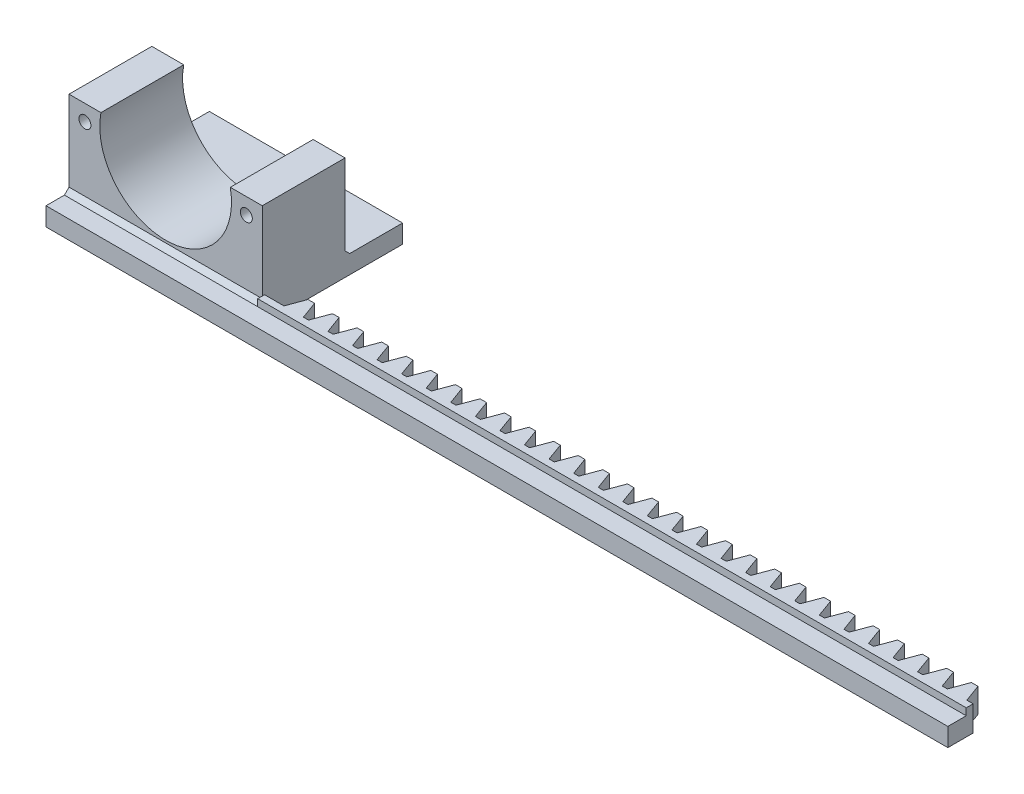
ISO-10303-21;
HEADER;
FILE_DESCRIPTION(('STEP AP214'),'2;1');
FILE_NAME('part.step','',(''),(''),'','','');
FILE_SCHEMA(('AUTOMOTIVE_DESIGN { 1 0 10303 214 1 1 1 1 }'));
ENDSEC;
DATA;
#1=APPLICATION_CONTEXT('core data for automotive mechanical design processes');
#2=APPLICATION_PROTOCOL_DEFINITION('international standard','automotive_design',2000,#1);
#3=PRODUCT_CONTEXT('',#1,'mechanical');
#4=PRODUCT('Part','Part','',(#3));
#5=PRODUCT_RELATED_PRODUCT_CATEGORY('part','',(#4));
#6=PRODUCT_DEFINITION_FORMATION('','',#4);
#7=PRODUCT_DEFINITION_CONTEXT('part definition',#1,'design');
#8=PRODUCT_DEFINITION('design','',#6,#7);
#9=PRODUCT_DEFINITION_SHAPE('','',#8);
#10=(LENGTH_UNIT() NAMED_UNIT(*) SI_UNIT(.MILLI.,.METRE.));
#11=(NAMED_UNIT(*) PLANE_ANGLE_UNIT() SI_UNIT($,.RADIAN.));
#12=(NAMED_UNIT(*) SI_UNIT($,.STERADIAN.) SOLID_ANGLE_UNIT());
#13=UNCERTAINTY_MEASURE_WITH_UNIT(LENGTH_MEASURE(1.E-05),#10,'distance_accuracy_value','');
#14=(GEOMETRIC_REPRESENTATION_CONTEXT(3) GLOBAL_UNCERTAINTY_ASSIGNED_CONTEXT((#13)) GLOBAL_UNIT_ASSIGNED_CONTEXT((#10,
#11,#12)) REPRESENTATION_CONTEXT('',''));
#15=CARTESIAN_POINT('',(0.,0.,0.));
#16=DIRECTION('',(0.,0.,1.));
#17=DIRECTION('',(1.,0.,0.));
#18=AXIS2_PLACEMENT_3D('',#15,#16,#17);
#19=CARTESIAN_POINT('',(0.,19.64,0.));
#20=DIRECTION('',(0.,1.,0.));
#21=DIRECTION('',(0.,0.,1.));
#22=AXIS2_PLACEMENT_3D('',#19,#20,#21);
#23=PLANE('',#22);
#24=DIRECTION('',(0.,0.,1.));
#25=VECTOR('',#24,1.);
#26=CARTESIAN_POINT('',(-17.1112506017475,19.64,-15.875));
#27=LINE('',#26,#25);
#28=CARTESIAN_POINT('',(-17.1112506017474,19.64,-15.375));
#29=VERTEX_POINT('',#28);
#30=CARTESIAN_POINT('',(-17.1112506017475,19.64,2.625));
#31=VERTEX_POINT('',#30);
#32=EDGE_CURVE('E11',#29,#31,#27,.T.);
#33=ORIENTED_EDGE('',*,*,#32,.F.);
#34=DIRECTION('',(-1.,0.,0.));
#35=VECTOR('',#34,1.);
#36=CARTESIAN_POINT('',(-24.0512506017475,19.64,-15.375));
#37=LINE('',#36,#35);
#38=CARTESIAN_POINT('',(-24.0512506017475,19.64,-15.375));
#39=VERTEX_POINT('',#38);
#40=EDGE_CURVE('E1757',#29,#39,#37,.T.);
#41=ORIENTED_EDGE('',*,*,#40,.T.);
#42=DIRECTION('',(0.,0.,1.));
#43=VECTOR('',#42,1.);
#44=CARTESIAN_POINT('',(-24.0512506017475,19.64,-15.375));
#45=LINE('',#44,#43);
#46=CARTESIAN_POINT('',(-24.0512506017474,19.64,2.625));
#47=VERTEX_POINT('',#46);
#48=EDGE_CURVE('E1749',#39,#47,#45,.T.);
#49=ORIENTED_EDGE('',*,*,#48,.T.);
#50=DIRECTION('',(1.,0.,0.));
#51=VECTOR('',#50,1.);
#52=CARTESIAN_POINT('',(-24.0512506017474,19.64,2.625));
#53=LINE('',#52,#51);
#54=EDGE_CURVE('E1753',#47,#31,#53,.T.);
#55=ORIENTED_EDGE('',*,*,#54,.T.);
#56=EDGE_LOOP('',(#33,#41,#49,#55));
#57=FACE_BOUND('',#56,.T.);
#58=ADVANCED_FACE('F44',(#57),#23,.T.);
#59=CARTESIAN_POINT('',(17.9487493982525,2.64,0.));
#60=DIRECTION('',(1.,0.,0.));
#61=DIRECTION('',(0.,0.,-1.));
#62=AXIS2_PLACEMENT_3D('',#59,#60,#61);
#63=PLANE('',#62);
#64=DIRECTION('',(0.,-1.,0.));
#65=VECTOR('',#64,1.);
#66=CARTESIAN_POINT('',(17.9487493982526,19.64,2.625));
#67=LINE('',#66,#65);
#68=CARTESIAN_POINT('',(17.9487493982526,2.64,2.625));
#69=VERTEX_POINT('',#68);
#70=CARTESIAN_POINT('',(17.9487493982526,2.14,2.625));
#71=VERTEX_POINT('',#70);
#72=EDGE_CURVE('E858',#69,#71,#67,.T.);
#73=ORIENTED_EDGE('',*,*,#72,.T.);
#74=DIRECTION('',(0.,0.707106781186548,-0.707106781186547));
#75=VECTOR('',#74,1.);
#76=CARTESIAN_POINT('',(17.9487493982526,2.14,2.625));
#77=LINE('',#76,#75);
#78=CARTESIAN_POINT('',(17.9487493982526,1.14,3.625));
#79=VERTEX_POINT('',#78);
#80=EDGE_CURVE('E1736',#79,#71,#77,.T.);
#81=ORIENTED_EDGE('',*,*,#80,.F.);
#82=DIRECTION('',(0.,-1.,0.));
#83=VECTOR('',#82,1.);
#84=CARTESIAN_POINT('',(17.9487493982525,2.64,3.625));
#85=LINE('',#84,#83);
#86=CARTESIAN_POINT('',(17.9487493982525,2.64,3.625));
#87=VERTEX_POINT('',#86);
#88=EDGE_CURVE('E1430',#87,#79,#85,.T.);
#89=ORIENTED_EDGE('',*,*,#88,.F.);
#90=DIRECTION('',(0.,0.,1.));
#91=VECTOR('',#90,1.);
#92=CARTESIAN_POINT('',(17.9487493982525,2.64,0.));
#93=LINE('',#92,#91);
#94=EDGE_CURVE('E1175',#69,#87,#93,.T.);
#95=ORIENTED_EDGE('',*,*,#94,.F.);
#96=EDGE_LOOP('',(#73,#81,#89,#95));
#97=FACE_BOUND('',#96,.T.);
#98=ADVANCED_FACE('F1774',(#97),#63,.F.);
#99=CARTESIAN_POINT('',(17.9487493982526,1.14,3.625));
#100=DIRECTION('',(0.,1.,0.));
#101=DIRECTION('',(0.,0.,1.));
#102=AXIS2_PLACEMENT_3D('',#99,#100,#101);
#103=PLANE('',#102);
#104=DIRECTION('',(-1.,0.,0.));
#105=VECTOR('',#104,1.);
#106=CARTESIAN_POINT('',(17.9487493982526,1.14,3.625));
#107=LINE('',#106,#105);
#108=CARTESIAN_POINT('',(-24.0512506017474,1.14,3.625));
#109=VERTEX_POINT('',#108);
#110=EDGE_CURVE('E61',#79,#109,#107,.T.);
#111=ORIENTED_EDGE('',*,*,#110,.T.);
#112=DIRECTION('',(0.,0.,-1.));
#113=VECTOR('',#112,1.);
#114=CARTESIAN_POINT('',(-24.0512506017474,1.14,7.625));
#115=LINE('',#114,#113);
#116=CARTESIAN_POINT('',(-24.0512506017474,1.14,7.625));
#117=VERTEX_POINT('',#116);
#118=EDGE_CURVE('E873',#117,#109,#115,.T.);
#119=ORIENTED_EDGE('',*,*,#118,.F.);
#120=DIRECTION('',(1.,0.,0.));
#121=VECTOR('',#120,1.);
#122=CARTESIAN_POINT('',(17.9487493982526,1.14,7.625));
#123=LINE('',#122,#121);
#124=CARTESIAN_POINT('',(171.948749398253,1.14,7.625));
#125=VERTEX_POINT('',#124);
#126=EDGE_CURVE('E898',#117,#125,#123,.T.);
#127=ORIENTED_EDGE('',*,*,#126,.T.);
#128=DIRECTION('',(0.,0.,1.));
#129=VECTOR('',#128,1.);
#130=CARTESIAN_POINT('',(171.948749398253,1.14,3.625));
#131=LINE('',#130,#129);
#132=CARTESIAN_POINT('',(171.948749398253,1.14,3.625));
#133=VERTEX_POINT('',#132);
#134=EDGE_CURVE('E888',#133,#125,#131,.T.);
#135=ORIENTED_EDGE('',*,*,#134,.F.);
#136=DIRECTION('',(1.,0.,0.));
#137=VECTOR('',#136,1.);
#138=CARTESIAN_POINT('',(17.9487493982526,1.14,3.625));
#139=LINE('',#138,#137);
#140=EDGE_CURVE('E899',#79,#133,#139,.T.);
#141=ORIENTED_EDGE('',*,*,#140,.F.);
#142=EDGE_LOOP('',(#111,#119,#127,#135,#141));
#143=FACE_BOUND('',#142,.T.);
#144=ADVANCED_FACE('F1777',(#143),#103,.T.);
#145=DIRECTION('',(-1.,0.,0.));
#146=VECTOR('',#145,1.);
#147=CARTESIAN_POINT('',(17.9487493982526,1.14,-16.375));
#148=LINE('',#147,#146);
#149=CARTESIAN_POINT('',(17.9487493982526,1.14,-16.375));
#150=VERTEX_POINT('',#149);
#151=CARTESIAN_POINT('',(-24.0512506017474,1.14,-16.375));
#152=VERTEX_POINT('',#151);
#153=EDGE_CURVE('E842',#150,#152,#148,.T.);
#154=ORIENTED_EDGE('',*,*,#153,.F.);
#155=DIRECTION('',(0.,0.,1.));
#156=VECTOR('',#155,1.);
#157=CARTESIAN_POINT('',(17.9487493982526,1.14,7.625));
#158=LINE('',#157,#156);
#159=CARTESIAN_POINT('',(17.9487493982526,1.14,-27.875));
#160=VERTEX_POINT('',#159);
#161=EDGE_CURVE('E852',#160,#150,#158,.T.);
#162=ORIENTED_EDGE('',*,*,#161,.F.);
#163=DIRECTION('',(1.,0.,0.));
#164=VECTOR('',#163,1.);
#165=CARTESIAN_POINT('',(17.9487493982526,1.14,-27.875));
#166=LINE('',#165,#164);
#167=CARTESIAN_POINT('',(-24.0512506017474,1.14,-27.875));
#168=VERTEX_POINT('',#167);
#169=EDGE_CURVE('E875',#168,#160,#166,.T.);
#170=ORIENTED_EDGE('',*,*,#169,.F.);
#171=EDGE_CURVE('E871',#152,#168,#115,.T.);
#172=ORIENTED_EDGE('',*,*,#171,.F.);
#173=EDGE_LOOP('',(#154,#162,#170,#172));
#174=FACE_BOUND('',#173,.T.);
#175=ADVANCED_FACE('F2772',(#174),#103,.T.);
#176=CARTESIAN_POINT('',(0.,-2.64,0.));
#177=DIRECTION('',(0.,1.,0.));
#178=DIRECTION('',(0.,0.,1.));
#179=AXIS2_PLACEMENT_3D('',#176,#177,#178);
#180=PLANE('',#179);
#181=DIRECTION('',(1.,0.,0.));
#182=VECTOR('',#181,1.);
#183=CARTESIAN_POINT('',(0.,-2.64,2.125));
#184=LINE('',#183,#182);
#185=CARTESIAN_POINT('',(22.1615565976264,-2.64,2.125));
#186=VERTEX_POINT('',#185);
#187=CARTESIAN_POINT('',(26.3921861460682,-2.64,2.125));
#188=VERTEX_POINT('',#187);
#189=EDGE_CURVE('E1720',#186,#188,#184,.T.);
#190=ORIENTED_EDGE('',*,*,#189,.F.);
#191=DIRECTION('',(-0.344999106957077,0.,0.938603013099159));
#192=VECTOR('',#191,1.);
#193=CARTESIAN_POINT('',(20.2119025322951,-2.64,7.42922004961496));
#194=LINE('',#193,#192);
#195=CARTESIAN_POINT('',(23.5674987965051,-2.64,-1.7));
#196=VERTEX_POINT('',#195);
#197=EDGE_CURVE('E916',#196,#186,#194,.T.);
#198=ORIENTED_EDGE('',*,*,#197,.F.);
#199=DIRECTION('',(1.,0.,0.));
#200=VECTOR('',#199,1.);
#201=CARTESIAN_POINT('',(0.,-2.64,-1.7));
#202=LINE('',#201,#200);
#203=CARTESIAN_POINT('',(25.,-2.64,-1.7));
#204=VERTEX_POINT('',#203);
#205=EDGE_CURVE('E1423',#196,#204,#202,.T.);
#206=ORIENTED_EDGE('',*,*,#205,.T.);
#207=DIRECTION('',(0.34202014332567,0.,0.939692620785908));
#208=VECTOR('',#207,1.);
#209=CARTESIAN_POINT('',(22.6219250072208,-2.64,-8.23370734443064));
#210=LINE('',#209,#208);
#211=EDGE_CURVE('E1420',#204,#188,#210,.T.);
#212=ORIENTED_EDGE('',*,*,#211,.T.);
#213=EDGE_LOOP('',(#190,#198,#206,#212));
#214=FACE_BOUND('',#213,.T.);
#215=ADVANCED_FACE('F1894',(#214),#180,.F.);
#216=CARTESIAN_POINT('',(27.5015565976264,-2.64,2.125));
#217=VERTEX_POINT('',#216);
#218=CARTESIAN_POINT('',(31.7321861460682,-2.64,2.125));
#219=VERTEX_POINT('',#218);
#220=EDGE_CURVE('E1886',#217,#219,#184,.T.);
#221=ORIENTED_EDGE('',*,*,#220,.F.);
#222=DIRECTION('',(-0.344999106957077,0.,0.938603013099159));
#223=VECTOR('',#222,1.);
#224=CARTESIAN_POINT('',(24.9163123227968,-2.64,9.1584039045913));
#225=LINE('',#224,#223);
#226=CARTESIAN_POINT('',(28.9074987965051,-2.64,-1.7));
#227=VERTEX_POINT('',#226);
#228=EDGE_CURVE('E1417',#227,#217,#225,.T.);
#229=ORIENTED_EDGE('',*,*,#228,.F.);
#230=DIRECTION('',(1.,0.,0.));
#231=VECTOR('',#230,1.);
#232=CARTESIAN_POINT('',(0.,-2.64,-1.7));
#233=LINE('',#232,#231);
#234=CARTESIAN_POINT('',(30.34,-2.64,-1.7));
#235=VERTEX_POINT('',#234);
#236=EDGE_CURVE('E1414',#227,#235,#233,.T.);
#237=ORIENTED_EDGE('',*,*,#236,.T.);
#238=DIRECTION('',(0.342020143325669,0.,0.939692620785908));
#239=VECTOR('',#238,1.);
#240=CARTESIAN_POINT('',(27.3372636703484,-2.64,-9.94995026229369));
#241=LINE('',#240,#239);
#242=EDGE_CURVE('E1411',#235,#219,#241,.T.);
#243=ORIENTED_EDGE('',*,*,#242,.T.);
#244=EDGE_LOOP('',(#221,#229,#237,#243));
#245=FACE_BOUND('',#244,.T.);
#246=ADVANCED_FACE('F1909',(#245),#180,.F.);
#247=CARTESIAN_POINT('',(32.8415565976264,-2.64,2.125));
#248=VERTEX_POINT('',#247);
#249=CARTESIAN_POINT('',(37.0721861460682,-2.64,2.125));
#250=VERTEX_POINT('',#249);
#251=EDGE_CURVE('E1885',#248,#250,#184,.T.);
#252=ORIENTED_EDGE('',*,*,#251,.F.);
#253=DIRECTION('',(-0.344999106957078,0.,0.938603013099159));
#254=VECTOR('',#253,1.);
#255=CARTESIAN_POINT('',(29.6207221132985,-2.64,10.8875877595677));
#256=LINE('',#255,#254);
#257=CARTESIAN_POINT('',(34.2474987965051,-2.64,-1.7));
#258=VERTEX_POINT('',#257);
#259=EDGE_CURVE('E1408',#258,#248,#256,.T.);
#260=ORIENTED_EDGE('',*,*,#259,.F.);
#261=DIRECTION('',(1.,0.,0.));
#262=VECTOR('',#261,1.);
#263=CARTESIAN_POINT('',(0.,-2.64,-1.7));
#264=LINE('',#263,#262);
#265=CARTESIAN_POINT('',(35.68,-2.64,-1.7));
#266=VERTEX_POINT('',#265);
#267=EDGE_CURVE('E1405',#258,#266,#264,.T.);
#268=ORIENTED_EDGE('',*,*,#267,.T.);
#269=DIRECTION('',(0.34202014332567,0.,0.939692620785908));
#270=VECTOR('',#269,1.);
#271=CARTESIAN_POINT('',(32.0526023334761,-2.64,-11.6661931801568));
#272=LINE('',#271,#270);
#273=EDGE_CURVE('E1402',#266,#250,#272,.T.);
#274=ORIENTED_EDGE('',*,*,#273,.T.);
#275=EDGE_LOOP('',(#252,#260,#268,#274));
#276=FACE_BOUND('',#275,.T.);
#277=ADVANCED_FACE('F1924',(#276),#180,.F.);
#278=CARTESIAN_POINT('',(38.1815565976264,-2.64,2.125));
#279=VERTEX_POINT('',#278);
#280=CARTESIAN_POINT('',(42.4121861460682,-2.64,2.125));
#281=VERTEX_POINT('',#280);
#282=EDGE_CURVE('E1884',#279,#281,#184,.T.);
#283=ORIENTED_EDGE('',*,*,#282,.F.);
#284=DIRECTION('',(-0.344999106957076,0.,0.938603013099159));
#285=VECTOR('',#284,1.);
#286=CARTESIAN_POINT('',(34.3251319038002,-2.64,12.616771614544));
#287=LINE('',#286,#285);
#288=CARTESIAN_POINT('',(39.5874987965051,-2.64,-1.7));
#289=VERTEX_POINT('',#288);
#290=EDGE_CURVE('E1399',#289,#279,#287,.T.);
#291=ORIENTED_EDGE('',*,*,#290,.F.);
#292=DIRECTION('',(1.,0.,0.));
#293=VECTOR('',#292,1.);
#294=CARTESIAN_POINT('',(0.,-2.64,-1.7));
#295=LINE('',#294,#293);
#296=CARTESIAN_POINT('',(41.02,-2.64,-1.7));
#297=VERTEX_POINT('',#296);
#298=EDGE_CURVE('E1396',#289,#297,#295,.T.);
#299=ORIENTED_EDGE('',*,*,#298,.T.);
#300=DIRECTION('',(0.34202014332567,0.,0.939692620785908));
#301=VECTOR('',#300,1.);
#302=CARTESIAN_POINT('',(36.7679409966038,-2.64,-13.3824360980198));
#303=LINE('',#302,#301);
#304=EDGE_CURVE('E1393',#297,#281,#303,.T.);
#305=ORIENTED_EDGE('',*,*,#304,.T.);
#306=EDGE_LOOP('',(#283,#291,#299,#305));
#307=FACE_BOUND('',#306,.T.);
#308=ADVANCED_FACE('F1939',(#307),#180,.F.);
#309=CARTESIAN_POINT('',(43.5215565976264,-2.64,2.125));
#310=VERTEX_POINT('',#309);
#311=CARTESIAN_POINT('',(47.7521861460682,-2.64,2.125));
#312=VERTEX_POINT('',#311);
#313=EDGE_CURVE('E1883',#310,#312,#184,.T.);
#314=ORIENTED_EDGE('',*,*,#313,.F.);
#315=DIRECTION('',(-0.344999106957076,0.,0.938603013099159));
#316=VECTOR('',#315,1.);
#317=CARTESIAN_POINT('',(39.0295416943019,-2.64,14.3459554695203));
#318=LINE('',#317,#316);
#319=CARTESIAN_POINT('',(44.9274987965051,-2.64,-1.7));
#320=VERTEX_POINT('',#319);
#321=EDGE_CURVE('E1390',#320,#310,#318,.T.);
#322=ORIENTED_EDGE('',*,*,#321,.F.);
#323=DIRECTION('',(1.,0.,0.));
#324=VECTOR('',#323,1.);
#325=CARTESIAN_POINT('',(0.,-2.64,-1.7));
#326=LINE('',#325,#324);
#327=CARTESIAN_POINT('',(46.36,-2.64,-1.7));
#328=VERTEX_POINT('',#327);
#329=EDGE_CURVE('E1387',#320,#328,#326,.T.);
#330=ORIENTED_EDGE('',*,*,#329,.T.);
#331=DIRECTION('',(0.34202014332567,0.,0.939692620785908));
#332=VECTOR('',#331,1.);
#333=CARTESIAN_POINT('',(41.4832796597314,-2.64,-15.0986790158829));
#334=LINE('',#333,#332);
#335=EDGE_CURVE('E1384',#328,#312,#334,.T.);
#336=ORIENTED_EDGE('',*,*,#335,.T.);
#337=EDGE_LOOP('',(#314,#322,#330,#336));
#338=FACE_BOUND('',#337,.T.);
#339=ADVANCED_FACE('F1954',(#338),#180,.F.);
#340=CARTESIAN_POINT('',(48.8615565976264,-2.64,2.125));
#341=VERTEX_POINT('',#340);
#342=CARTESIAN_POINT('',(53.0921861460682,-2.64,2.125));
#343=VERTEX_POINT('',#342);
#344=EDGE_CURVE('E1882',#341,#343,#184,.T.);
#345=ORIENTED_EDGE('',*,*,#344,.F.);
#346=DIRECTION('',(-0.344999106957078,0.,0.938603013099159));
#347=VECTOR('',#346,1.);
#348=CARTESIAN_POINT('',(43.7339514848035,-2.64,16.0751393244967));
#349=LINE('',#348,#347);
#350=CARTESIAN_POINT('',(50.2674987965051,-2.64,-1.7));
#351=VERTEX_POINT('',#350);
#352=EDGE_CURVE('E1381',#351,#341,#349,.T.);
#353=ORIENTED_EDGE('',*,*,#352,.F.);
#354=DIRECTION('',(1.,0.,0.));
#355=VECTOR('',#354,1.);
#356=CARTESIAN_POINT('',(0.,-2.64,-1.7));
#357=LINE('',#356,#355);
#358=CARTESIAN_POINT('',(51.7,-2.64,-1.7));
#359=VERTEX_POINT('',#358);
#360=EDGE_CURVE('E1378',#351,#359,#357,.T.);
#361=ORIENTED_EDGE('',*,*,#360,.T.);
#362=DIRECTION('',(0.34202014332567,0.,0.939692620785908));
#363=VECTOR('',#362,1.);
#364=CARTESIAN_POINT('',(46.1986183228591,-2.64,-16.814921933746));
#365=LINE('',#364,#363);
#366=EDGE_CURVE('E1375',#359,#343,#365,.T.);
#367=ORIENTED_EDGE('',*,*,#366,.T.);
#368=EDGE_LOOP('',(#345,#353,#361,#367));
#369=FACE_BOUND('',#368,.T.);
#370=ADVANCED_FACE('F1969',(#369),#180,.F.);
#371=CARTESIAN_POINT('',(54.2015565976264,-2.64,2.125));
#372=VERTEX_POINT('',#371);
#373=CARTESIAN_POINT('',(58.4321861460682,-2.64,2.125));
#374=VERTEX_POINT('',#373);
#375=EDGE_CURVE('E1881',#372,#374,#184,.T.);
#376=ORIENTED_EDGE('',*,*,#375,.F.);
#377=DIRECTION('',(-0.344999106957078,0.,0.938603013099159));
#378=VECTOR('',#377,1.);
#379=CARTESIAN_POINT('',(48.4383612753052,-2.64,17.804323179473));
#380=LINE('',#379,#378);
#381=CARTESIAN_POINT('',(55.6074987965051,-2.64,-1.7));
#382=VERTEX_POINT('',#381);
#383=EDGE_CURVE('E1372',#382,#372,#380,.T.);
#384=ORIENTED_EDGE('',*,*,#383,.F.);
#385=DIRECTION('',(1.,0.,0.));
#386=VECTOR('',#385,1.);
#387=CARTESIAN_POINT('',(0.,-2.64,-1.7));
#388=LINE('',#387,#386);
#389=CARTESIAN_POINT('',(57.04,-2.64,-1.7));
#390=VERTEX_POINT('',#389);
#391=EDGE_CURVE('E1369',#382,#390,#388,.T.);
#392=ORIENTED_EDGE('',*,*,#391,.T.);
#393=DIRECTION('',(0.34202014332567,0.,0.939692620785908));
#394=VECTOR('',#393,1.);
#395=CARTESIAN_POINT('',(50.9139569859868,-2.64,-18.531164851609));
#396=LINE('',#395,#394);
#397=EDGE_CURVE('E1366',#390,#374,#396,.T.);
#398=ORIENTED_EDGE('',*,*,#397,.T.);
#399=EDGE_LOOP('',(#376,#384,#392,#398));
#400=FACE_BOUND('',#399,.T.);
#401=ADVANCED_FACE('F1984',(#400),#180,.F.);
#402=CARTESIAN_POINT('',(59.5415565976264,-2.64,2.125));
#403=VERTEX_POINT('',#402);
#404=CARTESIAN_POINT('',(63.7721861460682,-2.64,2.125));
#405=VERTEX_POINT('',#404);
#406=EDGE_CURVE('E1880',#403,#405,#184,.T.);
#407=ORIENTED_EDGE('',*,*,#406,.F.);
#408=DIRECTION('',(-0.344999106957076,0.,0.938603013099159));
#409=VECTOR('',#408,1.);
#410=CARTESIAN_POINT('',(53.142771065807,-2.64,19.5335070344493));
#411=LINE('',#410,#409);
#412=CARTESIAN_POINT('',(60.9474987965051,-2.64,-1.7));
#413=VERTEX_POINT('',#412);
#414=EDGE_CURVE('E1363',#413,#403,#411,.T.);
#415=ORIENTED_EDGE('',*,*,#414,.F.);
#416=DIRECTION('',(1.,0.,0.));
#417=VECTOR('',#416,1.);
#418=CARTESIAN_POINT('',(0.,-2.64,-1.7));
#419=LINE('',#418,#417);
#420=CARTESIAN_POINT('',(62.38,-2.64,-1.7));
#421=VERTEX_POINT('',#420);
#422=EDGE_CURVE('E1360',#413,#421,#419,.T.);
#423=ORIENTED_EDGE('',*,*,#422,.T.);
#424=DIRECTION('',(0.34202014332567,0.,0.939692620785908));
#425=VECTOR('',#424,1.);
#426=CARTESIAN_POINT('',(55.6292956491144,-2.64,-20.2474077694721));
#427=LINE('',#426,#425);
#428=EDGE_CURVE('E1357',#421,#405,#427,.T.);
#429=ORIENTED_EDGE('',*,*,#428,.T.);
#430=EDGE_LOOP('',(#407,#415,#423,#429));
#431=FACE_BOUND('',#430,.T.);
#432=ADVANCED_FACE('F1999',(#431),#180,.F.);
#433=CARTESIAN_POINT('',(64.8815565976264,-2.64,2.125));
#434=VERTEX_POINT('',#433);
#435=CARTESIAN_POINT('',(69.1121861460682,-2.64,2.125));
#436=VERTEX_POINT('',#435);
#437=EDGE_CURVE('E1879',#434,#436,#184,.T.);
#438=ORIENTED_EDGE('',*,*,#437,.F.);
#439=DIRECTION('',(-0.344999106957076,0.,0.938603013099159));
#440=VECTOR('',#439,1.);
#441=CARTESIAN_POINT('',(57.8471808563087,-2.64,21.2626908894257));
#442=LINE('',#441,#440);
#443=CARTESIAN_POINT('',(66.2874987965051,-2.64,-1.7));
#444=VERTEX_POINT('',#443);
#445=EDGE_CURVE('E1354',#444,#434,#442,.T.);
#446=ORIENTED_EDGE('',*,*,#445,.F.);
#447=DIRECTION('',(1.,0.,0.));
#448=VECTOR('',#447,1.);
#449=CARTESIAN_POINT('',(0.,-2.64,-1.7));
#450=LINE('',#449,#448);
#451=CARTESIAN_POINT('',(67.72,-2.64,-1.7));
#452=VERTEX_POINT('',#451);
#453=EDGE_CURVE('E1351',#444,#452,#450,.T.);
#454=ORIENTED_EDGE('',*,*,#453,.T.);
#455=DIRECTION('',(0.34202014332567,0.,0.939692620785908));
#456=VECTOR('',#455,1.);
#457=CARTESIAN_POINT('',(60.3446343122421,-2.64,-21.9636506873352));
#458=LINE('',#457,#456);
#459=EDGE_CURVE('E1348',#452,#436,#458,.T.);
#460=ORIENTED_EDGE('',*,*,#459,.T.);
#461=EDGE_LOOP('',(#438,#446,#454,#460));
#462=FACE_BOUND('',#461,.T.);
#463=ADVANCED_FACE('F2014',(#462),#180,.F.);
#464=CARTESIAN_POINT('',(70.2215565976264,-2.64,2.125));
#465=VERTEX_POINT('',#464);
#466=CARTESIAN_POINT('',(74.4521861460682,-2.64,2.125));
#467=VERTEX_POINT('',#466);
#468=EDGE_CURVE('E1878',#465,#467,#184,.T.);
#469=ORIENTED_EDGE('',*,*,#468,.F.);
#470=DIRECTION('',(-0.344999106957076,0.,0.938603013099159));
#471=VECTOR('',#470,1.);
#472=CARTESIAN_POINT('',(62.5515906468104,-2.64,22.991874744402));
#473=LINE('',#472,#471);
#474=CARTESIAN_POINT('',(71.6274987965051,-2.64,-1.7));
#475=VERTEX_POINT('',#474);
#476=EDGE_CURVE('E1345',#475,#465,#473,.T.);
#477=ORIENTED_EDGE('',*,*,#476,.F.);
#478=DIRECTION('',(1.,0.,0.));
#479=VECTOR('',#478,1.);
#480=CARTESIAN_POINT('',(0.,-2.64,-1.7));
#481=LINE('',#480,#479);
#482=CARTESIAN_POINT('',(73.06,-2.64,-1.7));
#483=VERTEX_POINT('',#482);
#484=EDGE_CURVE('E1342',#475,#483,#481,.T.);
#485=ORIENTED_EDGE('',*,*,#484,.T.);
#486=DIRECTION('',(0.34202014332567,0.,0.939692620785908));
#487=VECTOR('',#486,1.);
#488=CARTESIAN_POINT('',(65.0599729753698,-2.64,-23.6798936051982));
#489=LINE('',#488,#487);
#490=EDGE_CURVE('E1339',#483,#467,#489,.T.);
#491=ORIENTED_EDGE('',*,*,#490,.T.);
#492=EDGE_LOOP('',(#469,#477,#485,#491));
#493=FACE_BOUND('',#492,.T.);
#494=ADVANCED_FACE('F2029',(#493),#180,.F.);
#495=CARTESIAN_POINT('',(75.5615565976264,-2.64,2.125));
#496=VERTEX_POINT('',#495);
#497=CARTESIAN_POINT('',(79.7921861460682,-2.64,2.125));
#498=VERTEX_POINT('',#497);
#499=EDGE_CURVE('E1877',#496,#498,#184,.T.);
#500=ORIENTED_EDGE('',*,*,#499,.F.);
#501=DIRECTION('',(-0.344999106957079,0.,0.938603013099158));
#502=VECTOR('',#501,1.);
#503=CARTESIAN_POINT('',(67.2560004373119,-2.64,24.7210585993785));
#504=LINE('',#503,#502);
#505=CARTESIAN_POINT('',(76.9674987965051,-2.64,-1.7));
#506=VERTEX_POINT('',#505);
#507=EDGE_CURVE('E1336',#506,#496,#504,.T.);
#508=ORIENTED_EDGE('',*,*,#507,.F.);
#509=DIRECTION('',(1.,0.,0.));
#510=VECTOR('',#509,1.);
#511=CARTESIAN_POINT('',(0.,-2.64,-1.7));
#512=LINE('',#511,#510);
#513=CARTESIAN_POINT('',(78.4,-2.64,-1.7));
#514=VERTEX_POINT('',#513);
#515=EDGE_CURVE('E1333',#506,#514,#512,.T.);
#516=ORIENTED_EDGE('',*,*,#515,.T.);
#517=DIRECTION('',(0.34202014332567,0.,0.939692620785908));
#518=VECTOR('',#517,1.);
#519=CARTESIAN_POINT('',(69.7753116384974,-2.64,-25.3961365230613));
#520=LINE('',#519,#518);
#521=EDGE_CURVE('E1330',#514,#498,#520,.T.);
#522=ORIENTED_EDGE('',*,*,#521,.T.);
#523=EDGE_LOOP('',(#500,#508,#516,#522));
#524=FACE_BOUND('',#523,.T.);
#525=ADVANCED_FACE('F2044',(#524),#180,.F.);
#526=CARTESIAN_POINT('',(80.9015565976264,-2.64,2.125));
#527=VERTEX_POINT('',#526);
#528=CARTESIAN_POINT('',(85.1321861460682,-2.64,2.125));
#529=VERTEX_POINT('',#528);
#530=EDGE_CURVE('E1876',#527,#529,#184,.T.);
#531=ORIENTED_EDGE('',*,*,#530,.F.);
#532=DIRECTION('',(-0.344999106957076,0.,0.938603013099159));
#533=VECTOR('',#532,1.);
#534=CARTESIAN_POINT('',(71.9604102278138,-2.64,26.4502424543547));
#535=LINE('',#534,#533);
#536=CARTESIAN_POINT('',(82.3074987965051,-2.64,-1.7));
#537=VERTEX_POINT('',#536);
#538=EDGE_CURVE('E1327',#537,#527,#535,.T.);
#539=ORIENTED_EDGE('',*,*,#538,.F.);
#540=DIRECTION('',(1.,0.,0.));
#541=VECTOR('',#540,1.);
#542=CARTESIAN_POINT('',(0.,-2.64,-1.7));
#543=LINE('',#542,#541);
#544=CARTESIAN_POINT('',(83.74,-2.64,-1.7));
#545=VERTEX_POINT('',#544);
#546=EDGE_CURVE('E1324',#537,#545,#543,.T.);
#547=ORIENTED_EDGE('',*,*,#546,.T.);
#548=DIRECTION('',(0.34202014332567,0.,0.939692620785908));
#549=VECTOR('',#548,1.);
#550=CARTESIAN_POINT('',(74.4906503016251,-2.64,-27.1123794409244));
#551=LINE('',#550,#549);
#552=EDGE_CURVE('E1321',#545,#529,#551,.T.);
#553=ORIENTED_EDGE('',*,*,#552,.T.);
#554=EDGE_LOOP('',(#531,#539,#547,#553));
#555=FACE_BOUND('',#554,.T.);
#556=ADVANCED_FACE('F2059',(#555),#180,.F.);
#557=CARTESIAN_POINT('',(86.2415565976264,-2.64,2.125));
#558=VERTEX_POINT('',#557);
#559=CARTESIAN_POINT('',(90.4721861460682,-2.64,2.125));
#560=VERTEX_POINT('',#559);
#561=EDGE_CURVE('E1875',#558,#560,#184,.T.);
#562=ORIENTED_EDGE('',*,*,#561,.F.);
#563=DIRECTION('',(-0.344999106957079,0.,0.938603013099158));
#564=VECTOR('',#563,1.);
#565=CARTESIAN_POINT('',(76.6648200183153,-2.64,28.1794263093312));
#566=LINE('',#565,#564);
#567=CARTESIAN_POINT('',(87.6474987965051,-2.64,-1.7));
#568=VERTEX_POINT('',#567);
#569=EDGE_CURVE('E1318',#568,#558,#566,.T.);
#570=ORIENTED_EDGE('',*,*,#569,.F.);
#571=DIRECTION('',(1.,0.,0.));
#572=VECTOR('',#571,1.);
#573=CARTESIAN_POINT('',(0.,-2.64,-1.7));
#574=LINE('',#573,#572);
#575=CARTESIAN_POINT('',(89.08,-2.64,-1.7));
#576=VERTEX_POINT('',#575);
#577=EDGE_CURVE('E1315',#568,#576,#574,.T.);
#578=ORIENTED_EDGE('',*,*,#577,.T.);
#579=DIRECTION('',(0.34202014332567,0.,0.939692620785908));
#580=VECTOR('',#579,1.);
#581=CARTESIAN_POINT('',(79.2059889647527,-2.64,-28.8286223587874));
#582=LINE('',#581,#580);
#583=EDGE_CURVE('E1312',#576,#560,#582,.T.);
#584=ORIENTED_EDGE('',*,*,#583,.T.);
#585=EDGE_LOOP('',(#562,#570,#578,#584));
#586=FACE_BOUND('',#585,.T.);
#587=ADVANCED_FACE('F2074',(#586),#180,.F.);
#588=CARTESIAN_POINT('',(91.5815565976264,-2.64,2.125));
#589=VERTEX_POINT('',#588);
#590=CARTESIAN_POINT('',(95.8121861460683,-2.64,2.125));
#591=VERTEX_POINT('',#590);
#592=EDGE_CURVE('E1874',#589,#591,#184,.T.);
#593=ORIENTED_EDGE('',*,*,#592,.F.);
#594=DIRECTION('',(-0.344999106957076,0.,0.938603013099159));
#595=VECTOR('',#594,1.);
#596=CARTESIAN_POINT('',(81.3692298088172,-2.64,29.9086101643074));
#597=LINE('',#596,#595);
#598=CARTESIAN_POINT('',(92.9874987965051,-2.64,-1.7));
#599=VERTEX_POINT('',#598);
#600=EDGE_CURVE('E1309',#599,#589,#597,.T.);
#601=ORIENTED_EDGE('',*,*,#600,.F.);
#602=DIRECTION('',(1.,0.,0.));
#603=VECTOR('',#602,1.);
#604=CARTESIAN_POINT('',(0.,-2.64,-1.7));
#605=LINE('',#604,#603);
#606=CARTESIAN_POINT('',(94.42,-2.64,-1.7));
#607=VERTEX_POINT('',#606);
#608=EDGE_CURVE('E1306',#599,#607,#605,.T.);
#609=ORIENTED_EDGE('',*,*,#608,.T.);
#610=DIRECTION('',(0.34202014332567,0.,0.939692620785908));
#611=VECTOR('',#610,1.);
#612=CARTESIAN_POINT('',(83.9213276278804,-2.64,-30.5448652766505));
#613=LINE('',#612,#611);
#614=EDGE_CURVE('E1303',#607,#591,#613,.T.);
#615=ORIENTED_EDGE('',*,*,#614,.T.);
#616=EDGE_LOOP('',(#593,#601,#609,#615));
#617=FACE_BOUND('',#616,.T.);
#618=ADVANCED_FACE('F2089',(#617),#180,.F.);
#619=CARTESIAN_POINT('',(96.9215565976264,-2.64,2.125));
#620=VERTEX_POINT('',#619);
#621=CARTESIAN_POINT('',(101.152186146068,-2.64,2.125));
#622=VERTEX_POINT('',#621);
#623=EDGE_CURVE('E1873',#620,#622,#184,.T.);
#624=ORIENTED_EDGE('',*,*,#623,.F.);
#625=DIRECTION('',(-0.344999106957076,0.,0.938603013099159));
#626=VECTOR('',#625,1.);
#627=CARTESIAN_POINT('',(86.0736395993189,-2.64,31.6377940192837));
#628=LINE('',#627,#626);
#629=CARTESIAN_POINT('',(98.3274987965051,-2.64,-1.7));
#630=VERTEX_POINT('',#629);
#631=EDGE_CURVE('E1300',#630,#620,#628,.T.);
#632=ORIENTED_EDGE('',*,*,#631,.F.);
#633=DIRECTION('',(1.,0.,0.));
#634=VECTOR('',#633,1.);
#635=CARTESIAN_POINT('',(0.,-2.64,-1.7));
#636=LINE('',#635,#634);
#637=CARTESIAN_POINT('',(99.76,-2.64,-1.7));
#638=VERTEX_POINT('',#637);
#639=EDGE_CURVE('E1297',#630,#638,#636,.T.);
#640=ORIENTED_EDGE('',*,*,#639,.T.);
#641=DIRECTION('',(0.34202014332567,0.,0.939692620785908));
#642=VECTOR('',#641,1.);
#643=CARTESIAN_POINT('',(88.6366662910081,-2.64,-32.2611081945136));
#644=LINE('',#643,#642);
#645=EDGE_CURVE('E1294',#638,#622,#644,.T.);
#646=ORIENTED_EDGE('',*,*,#645,.T.);
#647=EDGE_LOOP('',(#624,#632,#640,#646));
#648=FACE_BOUND('',#647,.T.);
#649=ADVANCED_FACE('F2104',(#648),#180,.F.);
#650=CARTESIAN_POINT('',(102.261556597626,-2.64,2.125));
#651=VERTEX_POINT('',#650);
#652=CARTESIAN_POINT('',(106.492186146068,-2.64,2.125));
#653=VERTEX_POINT('',#652);
#654=EDGE_CURVE('E1872',#651,#653,#184,.T.);
#655=ORIENTED_EDGE('',*,*,#654,.F.);
#656=DIRECTION('',(-0.344999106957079,0.,0.938603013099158));
#657=VECTOR('',#656,1.);
#658=CARTESIAN_POINT('',(90.7780493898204,-2.64,33.3669778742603));
#659=LINE('',#658,#657);
#660=CARTESIAN_POINT('',(103.667498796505,-2.64,-1.7));
#661=VERTEX_POINT('',#660);
#662=EDGE_CURVE('E1291',#661,#651,#659,.T.);
#663=ORIENTED_EDGE('',*,*,#662,.F.);
#664=DIRECTION('',(1.,0.,0.));
#665=VECTOR('',#664,1.);
#666=CARTESIAN_POINT('',(0.,-2.64,-1.7));
#667=LINE('',#666,#665);
#668=CARTESIAN_POINT('',(105.1,-2.64,-1.7));
#669=VERTEX_POINT('',#668);
#670=EDGE_CURVE('E1288',#661,#669,#667,.T.);
#671=ORIENTED_EDGE('',*,*,#670,.T.);
#672=DIRECTION('',(0.34202014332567,0.,0.939692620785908));
#673=VECTOR('',#672,1.);
#674=CARTESIAN_POINT('',(93.3520049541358,-2.64,-33.9773511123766));
#675=LINE('',#674,#673);
#676=EDGE_CURVE('E1285',#669,#653,#675,.T.);
#677=ORIENTED_EDGE('',*,*,#676,.T.);
#678=EDGE_LOOP('',(#655,#663,#671,#677));
#679=FACE_BOUND('',#678,.T.);
#680=ADVANCED_FACE('F2119',(#679),#180,.F.);
#681=CARTESIAN_POINT('',(107.601556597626,-2.64,2.125));
#682=VERTEX_POINT('',#681);
#683=CARTESIAN_POINT('',(111.832186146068,-2.64,2.125));
#684=VERTEX_POINT('',#683);
#685=EDGE_CURVE('E1871',#682,#684,#184,.T.);
#686=ORIENTED_EDGE('',*,*,#685,.F.);
#687=DIRECTION('',(-0.344999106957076,0.,0.938603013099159));
#688=VECTOR('',#687,1.);
#689=CARTESIAN_POINT('',(95.4824591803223,-2.64,35.0961617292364));
#690=LINE('',#689,#688);
#691=CARTESIAN_POINT('',(109.007498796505,-2.64,-1.7));
#692=VERTEX_POINT('',#691);
#693=EDGE_CURVE('E1282',#692,#682,#690,.T.);
#694=ORIENTED_EDGE('',*,*,#693,.F.);
#695=DIRECTION('',(1.,0.,0.));
#696=VECTOR('',#695,1.);
#697=CARTESIAN_POINT('',(0.,-2.64,-1.7));
#698=LINE('',#697,#696);
#699=CARTESIAN_POINT('',(110.44,-2.64,-1.7));
#700=VERTEX_POINT('',#699);
#701=EDGE_CURVE('E1279',#692,#700,#698,.T.);
#702=ORIENTED_EDGE('',*,*,#701,.T.);
#703=DIRECTION('',(0.34202014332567,0.,0.939692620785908));
#704=VECTOR('',#703,1.);
#705=CARTESIAN_POINT('',(98.0673436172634,-2.64,-35.6935940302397));
#706=LINE('',#705,#704);
#707=EDGE_CURVE('E1276',#700,#684,#706,.T.);
#708=ORIENTED_EDGE('',*,*,#707,.T.);
#709=EDGE_LOOP('',(#686,#694,#702,#708));
#710=FACE_BOUND('',#709,.T.);
#711=ADVANCED_FACE('F2134',(#710),#180,.F.);
#712=CARTESIAN_POINT('',(112.941556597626,-2.64,2.125));
#713=VERTEX_POINT('',#712);
#714=CARTESIAN_POINT('',(117.172186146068,-2.64,2.125));
#715=VERTEX_POINT('',#714);
#716=EDGE_CURVE('E1870',#713,#715,#184,.T.);
#717=ORIENTED_EDGE('',*,*,#716,.F.);
#718=DIRECTION('',(-0.344999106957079,0.,0.938603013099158));
#719=VECTOR('',#718,1.);
#720=CARTESIAN_POINT('',(100.186868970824,-2.64,36.825345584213));
#721=LINE('',#720,#719);
#722=CARTESIAN_POINT('',(114.347498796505,-2.64,-1.7));
#723=VERTEX_POINT('',#722);
#724=EDGE_CURVE('E1273',#723,#713,#721,.T.);
#725=ORIENTED_EDGE('',*,*,#724,.F.);
#726=DIRECTION('',(1.,0.,0.));
#727=VECTOR('',#726,1.);
#728=CARTESIAN_POINT('',(0.,-2.64,-1.7));
#729=LINE('',#728,#727);
#730=CARTESIAN_POINT('',(115.78,-2.64,-1.7));
#731=VERTEX_POINT('',#730);
#732=EDGE_CURVE('E1270',#723,#731,#729,.T.);
#733=ORIENTED_EDGE('',*,*,#732,.T.);
#734=DIRECTION('',(0.34202014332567,0.,0.939692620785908));
#735=VECTOR('',#734,1.);
#736=CARTESIAN_POINT('',(102.782682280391,-2.64,-37.4098369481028));
#737=LINE('',#736,#735);
#738=EDGE_CURVE('E1267',#731,#715,#737,.T.);
#739=ORIENTED_EDGE('',*,*,#738,.T.);
#740=EDGE_LOOP('',(#717,#725,#733,#739));
#741=FACE_BOUND('',#740,.T.);
#742=ADVANCED_FACE('F2149',(#741),#180,.F.);
#743=CARTESIAN_POINT('',(118.281556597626,-2.64,2.125));
#744=VERTEX_POINT('',#743);
#745=CARTESIAN_POINT('',(122.512186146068,-2.64,2.125));
#746=VERTEX_POINT('',#745);
#747=EDGE_CURVE('E1869',#744,#746,#184,.T.);
#748=ORIENTED_EDGE('',*,*,#747,.F.);
#749=DIRECTION('',(-0.344999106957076,0.,0.938603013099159));
#750=VECTOR('',#749,1.);
#751=CARTESIAN_POINT('',(104.891278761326,-2.64,38.5545294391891));
#752=LINE('',#751,#750);
#753=CARTESIAN_POINT('',(119.687498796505,-2.64,-1.7));
#754=VERTEX_POINT('',#753);
#755=EDGE_CURVE('E1264',#754,#744,#752,.T.);
#756=ORIENTED_EDGE('',*,*,#755,.F.);
#757=DIRECTION('',(1.,0.,0.));
#758=VECTOR('',#757,1.);
#759=CARTESIAN_POINT('',(0.,-2.64,-1.7));
#760=LINE('',#759,#758);
#761=CARTESIAN_POINT('',(121.12,-2.64,-1.7));
#762=VERTEX_POINT('',#761);
#763=EDGE_CURVE('E1261',#754,#762,#760,.T.);
#764=ORIENTED_EDGE('',*,*,#763,.T.);
#765=DIRECTION('',(0.34202014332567,0.,0.939692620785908));
#766=VECTOR('',#765,1.);
#767=CARTESIAN_POINT('',(107.498020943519,-2.64,-39.1260798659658));
#768=LINE('',#767,#766);
#769=EDGE_CURVE('E1258',#762,#746,#768,.T.);
#770=ORIENTED_EDGE('',*,*,#769,.T.);
#771=EDGE_LOOP('',(#748,#756,#764,#770));
#772=FACE_BOUND('',#771,.T.);
#773=ADVANCED_FACE('F2164',(#772),#180,.F.);
#774=CARTESIAN_POINT('',(123.621556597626,-2.64,2.125));
#775=VERTEX_POINT('',#774);
#776=CARTESIAN_POINT('',(127.852186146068,-2.64,2.125));
#777=VERTEX_POINT('',#776);
#778=EDGE_CURVE('E1868',#775,#777,#184,.T.);
#779=ORIENTED_EDGE('',*,*,#778,.F.);
#780=DIRECTION('',(-0.344999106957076,0.,0.938603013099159));
#781=VECTOR('',#780,1.);
#782=CARTESIAN_POINT('',(109.595688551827,-2.64,40.2837132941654));
#783=LINE('',#782,#781);
#784=CARTESIAN_POINT('',(125.027498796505,-2.64,-1.7));
#785=VERTEX_POINT('',#784);
#786=EDGE_CURVE('E1255',#785,#775,#783,.T.);
#787=ORIENTED_EDGE('',*,*,#786,.F.);
#788=DIRECTION('',(1.,0.,0.));
#789=VECTOR('',#788,1.);
#790=CARTESIAN_POINT('',(0.,-2.64,-1.7));
#791=LINE('',#790,#789);
#792=CARTESIAN_POINT('',(126.46,-2.64,-1.7));
#793=VERTEX_POINT('',#792);
#794=EDGE_CURVE('E1252',#785,#793,#791,.T.);
#795=ORIENTED_EDGE('',*,*,#794,.T.);
#796=DIRECTION('',(0.34202014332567,0.,0.939692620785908));
#797=VECTOR('',#796,1.);
#798=CARTESIAN_POINT('',(112.213359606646,-2.64,-40.8423227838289));
#799=LINE('',#798,#797);
#800=EDGE_CURVE('E1249',#793,#777,#799,.T.);
#801=ORIENTED_EDGE('',*,*,#800,.T.);
#802=EDGE_LOOP('',(#779,#787,#795,#801));
#803=FACE_BOUND('',#802,.T.);
#804=ADVANCED_FACE('F2179',(#803),#180,.F.);
#805=CARTESIAN_POINT('',(128.961556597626,-2.64,2.125));
#806=VERTEX_POINT('',#805);
#807=CARTESIAN_POINT('',(133.192186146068,-2.64,2.125));
#808=VERTEX_POINT('',#807);
#809=EDGE_CURVE('E1867',#806,#808,#184,.T.);
#810=ORIENTED_EDGE('',*,*,#809,.F.);
#811=DIRECTION('',(-0.344999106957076,0.,0.938603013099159));
#812=VECTOR('',#811,1.);
#813=CARTESIAN_POINT('',(114.300098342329,-2.64,42.0128971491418));
#814=LINE('',#813,#812);
#815=CARTESIAN_POINT('',(130.367498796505,-2.64,-1.7));
#816=VERTEX_POINT('',#815);
#817=EDGE_CURVE('E1246',#816,#806,#814,.T.);
#818=ORIENTED_EDGE('',*,*,#817,.F.);
#819=DIRECTION('',(1.,0.,0.));
#820=VECTOR('',#819,1.);
#821=CARTESIAN_POINT('',(0.,-2.64,-1.7));
#822=LINE('',#821,#820);
#823=CARTESIAN_POINT('',(131.8,-2.64,-1.7));
#824=VERTEX_POINT('',#823);
#825=EDGE_CURVE('E1243',#816,#824,#822,.T.);
#826=ORIENTED_EDGE('',*,*,#825,.T.);
#827=DIRECTION('',(0.34202014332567,0.,0.939692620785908));
#828=VECTOR('',#827,1.);
#829=CARTESIAN_POINT('',(116.928698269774,-2.64,-42.558565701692));
#830=LINE('',#829,#828);
#831=EDGE_CURVE('E1240',#824,#808,#830,.T.);
#832=ORIENTED_EDGE('',*,*,#831,.T.);
#833=EDGE_LOOP('',(#810,#818,#826,#832));
#834=FACE_BOUND('',#833,.T.);
#835=ADVANCED_FACE('F2194',(#834),#180,.F.);
#836=CARTESIAN_POINT('',(134.301556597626,-2.64,2.125));
#837=VERTEX_POINT('',#836);
#838=CARTESIAN_POINT('',(138.532186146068,-2.64,2.125));
#839=VERTEX_POINT('',#838);
#840=EDGE_CURVE('E1866',#837,#839,#184,.T.);
#841=ORIENTED_EDGE('',*,*,#840,.F.);
#842=DIRECTION('',(-0.344999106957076,0.,0.938603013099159));
#843=VECTOR('',#842,1.);
#844=CARTESIAN_POINT('',(119.004508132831,-2.64,43.7420810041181));
#845=LINE('',#844,#843);
#846=CARTESIAN_POINT('',(135.707498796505,-2.64,-1.7));
#847=VERTEX_POINT('',#846);
#848=EDGE_CURVE('E1237',#847,#837,#845,.T.);
#849=ORIENTED_EDGE('',*,*,#848,.F.);
#850=DIRECTION('',(1.,0.,0.));
#851=VECTOR('',#850,1.);
#852=CARTESIAN_POINT('',(0.,-2.64,-1.7));
#853=LINE('',#852,#851);
#854=CARTESIAN_POINT('',(137.14,-2.64,-1.7));
#855=VERTEX_POINT('',#854);
#856=EDGE_CURVE('E1234',#847,#855,#853,.T.);
#857=ORIENTED_EDGE('',*,*,#856,.T.);
#858=DIRECTION('',(0.34202014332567,0.,0.939692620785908));
#859=VECTOR('',#858,1.);
#860=CARTESIAN_POINT('',(121.644036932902,-2.64,-44.274808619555));
#861=LINE('',#860,#859);
#862=EDGE_CURVE('E1231',#855,#839,#861,.T.);
#863=ORIENTED_EDGE('',*,*,#862,.T.);
#864=EDGE_LOOP('',(#841,#849,#857,#863));
#865=FACE_BOUND('',#864,.T.);
#866=ADVANCED_FACE('F2209',(#865),#180,.F.);
#867=CARTESIAN_POINT('',(139.641556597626,-2.64,2.125));
#868=VERTEX_POINT('',#867);
#869=CARTESIAN_POINT('',(143.872186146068,-2.64,2.125));
#870=VERTEX_POINT('',#869);
#871=EDGE_CURVE('E1865',#868,#870,#184,.T.);
#872=ORIENTED_EDGE('',*,*,#871,.F.);
#873=DIRECTION('',(-0.344999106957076,0.,0.938603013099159));
#874=VECTOR('',#873,1.);
#875=CARTESIAN_POINT('',(123.708917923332,-2.64,45.4712648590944));
#876=LINE('',#875,#874);
#877=CARTESIAN_POINT('',(141.047498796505,-2.64,-1.7));
#878=VERTEX_POINT('',#877);
#879=EDGE_CURVE('E1228',#878,#868,#876,.T.);
#880=ORIENTED_EDGE('',*,*,#879,.F.);
#881=DIRECTION('',(1.,0.,0.));
#882=VECTOR('',#881,1.);
#883=CARTESIAN_POINT('',(0.,-2.64,-1.7));
#884=LINE('',#883,#882);
#885=CARTESIAN_POINT('',(142.48,-2.64,-1.7));
#886=VERTEX_POINT('',#885);
#887=EDGE_CURVE('E1225',#878,#886,#884,.T.);
#888=ORIENTED_EDGE('',*,*,#887,.T.);
#889=DIRECTION('',(0.34202014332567,0.,0.939692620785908));
#890=VECTOR('',#889,1.);
#891=CARTESIAN_POINT('',(126.359375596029,-2.64,-45.9910515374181));
#892=LINE('',#891,#890);
#893=EDGE_CURVE('E1222',#886,#870,#892,.T.);
#894=ORIENTED_EDGE('',*,*,#893,.T.);
#895=EDGE_LOOP('',(#872,#880,#888,#894));
#896=FACE_BOUND('',#895,.T.);
#897=ADVANCED_FACE('F2224',(#896),#180,.F.);
#898=CARTESIAN_POINT('',(144.981556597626,-2.64,2.125));
#899=VERTEX_POINT('',#898);
#900=CARTESIAN_POINT('',(149.212186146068,-2.64,2.125));
#901=VERTEX_POINT('',#900);
#902=EDGE_CURVE('E1864',#899,#901,#184,.T.);
#903=ORIENTED_EDGE('',*,*,#902,.F.);
#904=DIRECTION('',(-0.344999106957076,0.,0.938603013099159));
#905=VECTOR('',#904,1.);
#906=CARTESIAN_POINT('',(128.413327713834,-2.64,47.2004487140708));
#907=LINE('',#906,#905);
#908=CARTESIAN_POINT('',(146.387498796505,-2.64,-1.7));
#909=VERTEX_POINT('',#908);
#910=EDGE_CURVE('E1219',#909,#899,#907,.T.);
#911=ORIENTED_EDGE('',*,*,#910,.F.);
#912=DIRECTION('',(1.,0.,0.));
#913=VECTOR('',#912,1.);
#914=CARTESIAN_POINT('',(0.,-2.64,-1.7));
#915=LINE('',#914,#913);
#916=CARTESIAN_POINT('',(147.82,-2.64,-1.7));
#917=VERTEX_POINT('',#916);
#918=EDGE_CURVE('E1216',#909,#917,#915,.T.);
#919=ORIENTED_EDGE('',*,*,#918,.T.);
#920=DIRECTION('',(0.34202014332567,0.,0.939692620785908));
#921=VECTOR('',#920,1.);
#922=CARTESIAN_POINT('',(131.074714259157,-2.64,-47.7072944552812));
#923=LINE('',#922,#921);
#924=EDGE_CURVE('E1213',#917,#901,#923,.T.);
#925=ORIENTED_EDGE('',*,*,#924,.T.);
#926=EDGE_LOOP('',(#903,#911,#919,#925));
#927=FACE_BOUND('',#926,.T.);
#928=ADVANCED_FACE('F2239',(#927),#180,.F.);
#929=CARTESIAN_POINT('',(150.321556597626,-2.64,2.125));
#930=VERTEX_POINT('',#929);
#931=CARTESIAN_POINT('',(154.552186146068,-2.64,2.125));
#932=VERTEX_POINT('',#931);
#933=EDGE_CURVE('E1863',#930,#932,#184,.T.);
#934=ORIENTED_EDGE('',*,*,#933,.F.);
#935=DIRECTION('',(-0.344999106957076,0.,0.938603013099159));
#936=VECTOR('',#935,1.);
#937=CARTESIAN_POINT('',(133.117737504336,-2.64,48.9296325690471));
#938=LINE('',#937,#936);
#939=CARTESIAN_POINT('',(151.727498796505,-2.64,-1.7));
#940=VERTEX_POINT('',#939);
#941=EDGE_CURVE('E1210',#940,#930,#938,.T.);
#942=ORIENTED_EDGE('',*,*,#941,.F.);
#943=DIRECTION('',(1.,0.,0.));
#944=VECTOR('',#943,1.);
#945=CARTESIAN_POINT('',(0.,-2.64,-1.7));
#946=LINE('',#945,#944);
#947=CARTESIAN_POINT('',(153.16,-2.64,-1.7));
#948=VERTEX_POINT('',#947);
#949=EDGE_CURVE('E1207',#940,#948,#946,.T.);
#950=ORIENTED_EDGE('',*,*,#949,.T.);
#951=DIRECTION('',(0.34202014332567,0.,0.939692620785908));
#952=VECTOR('',#951,1.);
#953=CARTESIAN_POINT('',(135.790052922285,-2.64,-49.4235373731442));
#954=LINE('',#953,#952);
#955=EDGE_CURVE('E1204',#948,#932,#954,.T.);
#956=ORIENTED_EDGE('',*,*,#955,.T.);
#957=EDGE_LOOP('',(#934,#942,#950,#956));
#958=FACE_BOUND('',#957,.T.);
#959=ADVANCED_FACE('F2254',(#958),#180,.F.);
#960=CARTESIAN_POINT('',(155.661556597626,-2.64,2.125));
#961=VERTEX_POINT('',#960);
#962=CARTESIAN_POINT('',(159.892186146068,-2.64,2.125));
#963=VERTEX_POINT('',#962);
#964=EDGE_CURVE('E1862',#961,#963,#184,.T.);
#965=ORIENTED_EDGE('',*,*,#964,.F.);
#966=DIRECTION('',(-0.344999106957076,0.,0.938603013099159));
#967=VECTOR('',#966,1.);
#968=CARTESIAN_POINT('',(137.822147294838,-2.64,50.6588164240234));
#969=LINE('',#968,#967);
#970=CARTESIAN_POINT('',(157.067498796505,-2.64,-1.7));
#971=VERTEX_POINT('',#970);
#972=EDGE_CURVE('E1201',#971,#961,#969,.T.);
#973=ORIENTED_EDGE('',*,*,#972,.F.);
#974=DIRECTION('',(1.,0.,0.));
#975=VECTOR('',#974,1.);
#976=CARTESIAN_POINT('',(0.,-2.64,-1.7));
#977=LINE('',#976,#975);
#978=CARTESIAN_POINT('',(158.5,-2.64,-1.7));
#979=VERTEX_POINT('',#978);
#980=EDGE_CURVE('E1198',#971,#979,#977,.T.);
#981=ORIENTED_EDGE('',*,*,#980,.T.);
#982=DIRECTION('',(0.34202014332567,0.,0.939692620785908));
#983=VECTOR('',#982,1.);
#984=CARTESIAN_POINT('',(140.505391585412,-2.64,-51.1397802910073));
#985=LINE('',#984,#983);
#986=EDGE_CURVE('E1195',#979,#963,#985,.T.);
#987=ORIENTED_EDGE('',*,*,#986,.T.);
#988=EDGE_LOOP('',(#965,#973,#981,#987));
#989=FACE_BOUND('',#988,.T.);
#990=ADVANCED_FACE('F2268',(#989),#180,.F.);
#991=CARTESIAN_POINT('',(161.001556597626,-2.64,2.125));
#992=VERTEX_POINT('',#991);
#993=CARTESIAN_POINT('',(165.232186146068,-2.64,2.125));
#994=VERTEX_POINT('',#993);
#995=EDGE_CURVE('E1719',#992,#994,#184,.T.);
#996=ORIENTED_EDGE('',*,*,#995,.F.);
#997=DIRECTION('',(-0.344999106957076,0.,0.938603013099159));
#998=VECTOR('',#997,1.);
#999=CARTESIAN_POINT('',(142.526557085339,-2.64,52.3880002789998));
#1000=LINE('',#999,#998);
#1001=CARTESIAN_POINT('',(162.407498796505,-2.64,-1.7));
#1002=VERTEX_POINT('',#1001);
#1003=EDGE_CURVE('E1192',#1002,#992,#1000,.T.);
#1004=ORIENTED_EDGE('',*,*,#1003,.F.);
#1005=DIRECTION('',(1.,0.,0.));
#1006=VECTOR('',#1005,1.);
#1007=CARTESIAN_POINT('',(0.,-2.64,-1.7));
#1008=LINE('',#1007,#1006);
#1009=CARTESIAN_POINT('',(163.84,-2.64,-1.7));
#1010=VERTEX_POINT('',#1009);
#1011=EDGE_CURVE('E1189',#1002,#1010,#1008,.T.);
#1012=ORIENTED_EDGE('',*,*,#1011,.T.);
#1013=DIRECTION('',(0.34202014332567,0.,0.939692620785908));
#1014=VECTOR('',#1013,1.);
#1015=CARTESIAN_POINT('',(145.22073024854,-2.64,-52.8560232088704));
#1016=LINE('',#1015,#1014);
#1017=EDGE_CURVE('E1186',#1010,#994,#1016,.T.);
#1018=ORIENTED_EDGE('',*,*,#1017,.T.);
#1019=EDGE_LOOP('',(#996,#1004,#1012,#1018));
#1020=FACE_BOUND('',#1019,.T.);
#1021=ADVANCED_FACE('F2952',(#1020),#180,.F.);
#1022=CARTESIAN_POINT('',(166.341556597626,-2.64,2.125));
#1023=VERTEX_POINT('',#1022);
#1024=CARTESIAN_POINT('',(170.572186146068,-2.64,2.125));
#1025=VERTEX_POINT('',#1024);
#1026=EDGE_CURVE('E1717',#1023,#1025,#184,.T.);
#1027=ORIENTED_EDGE('',*,*,#1026,.F.);
#1028=DIRECTION('',(-0.344999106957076,0.,0.938603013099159));
#1029=VECTOR('',#1028,1.);
#1030=CARTESIAN_POINT('',(147.230966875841,-2.64,54.1171841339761));
#1031=LINE('',#1030,#1029);
#1032=CARTESIAN_POINT('',(167.747498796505,-2.64,-1.7));
#1033=VERTEX_POINT('',#1032);
#1034=EDGE_CURVE('E1183',#1033,#1023,#1031,.T.);
#1035=ORIENTED_EDGE('',*,*,#1034,.F.);
#1036=DIRECTION('',(1.,0.,0.));
#1037=VECTOR('',#1036,1.);
#1038=CARTESIAN_POINT('',(0.,-2.64,-1.7));
#1039=LINE('',#1038,#1037);
#1040=CARTESIAN_POINT('',(169.18,-2.64,-1.7));
#1041=VERTEX_POINT('',#1040);
#1042=EDGE_CURVE('E1180',#1033,#1041,#1039,.T.);
#1043=ORIENTED_EDGE('',*,*,#1042,.T.);
#1044=DIRECTION('',(0.34202014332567,0.,0.939692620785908));
#1045=VECTOR('',#1044,1.);
#1046=CARTESIAN_POINT('',(149.936068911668,-2.64,-54.5722661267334));
#1047=LINE('',#1046,#1045);
#1048=EDGE_CURVE('E911',#1041,#1025,#1047,.T.);
#1049=ORIENTED_EDGE('',*,*,#1048,.T.);
#1050=EDGE_LOOP('',(#1027,#1035,#1043,#1049));
#1051=FACE_BOUND('',#1050,.T.);
#1052=ADVANCED_FACE('F2774',(#1051),#180,.F.);
#1053=CARTESIAN_POINT('',(171.948749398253,2.64,0.));
#1054=DIRECTION('',(1.,0.,0.));
#1055=DIRECTION('',(0.,0.,-1.));
#1056=AXIS2_PLACEMENT_3D('',#1053,#1054,#1055);
#1057=PLANE('',#1056);
#1058=DIRECTION('',(0.,-1.,0.));
#1059=VECTOR('',#1058,1.);
#1060=CARTESIAN_POINT('',(171.948749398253,2.64,3.625));
#1061=LINE('',#1060,#1059);
#1062=CARTESIAN_POINT('',(171.948749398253,2.64,3.625));
#1063=VERTEX_POINT('',#1062);
#1064=EDGE_CURVE('E1177',#1063,#133,#1061,.T.);
#1065=ORIENTED_EDGE('',*,*,#1064,.T.);
#1066=ORIENTED_EDGE('',*,*,#134,.T.);
#1067=DIRECTION('',(0.,1.,0.));
#1068=VECTOR('',#1067,1.);
#1069=CARTESIAN_POINT('',(171.948749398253,-2.86,7.625));
#1070=LINE('',#1069,#1068);
#1071=CARTESIAN_POINT('',(171.948749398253,-2.86,7.625));
#1072=VERTEX_POINT('',#1071);
#1073=EDGE_CURVE('E895',#1072,#125,#1070,.T.);
#1074=ORIENTED_EDGE('',*,*,#1073,.F.);
#1075=DIRECTION('',(0.,0.,1.));
#1076=VECTOR('',#1075,1.);
#1077=CARTESIAN_POINT('',(171.948749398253,-2.86,3.625));
#1078=LINE('',#1077,#1076);
#1079=CARTESIAN_POINT('',(171.948749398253,-2.86,2.125));
#1080=VERTEX_POINT('',#1079);
#1081=EDGE_CURVE('E909',#1080,#1072,#1078,.T.);
#1082=ORIENTED_EDGE('',*,*,#1081,.F.);
#1083=DIRECTION('',(0.,-1.,0.));
#1084=VECTOR('',#1083,1.);
#1085=CARTESIAN_POINT('',(171.948749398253,2.64,2.125));
#1086=LINE('',#1085,#1084);
#1087=CARTESIAN_POINT('',(171.948749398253,2.64,2.125));
#1088=VERTEX_POINT('',#1087);
#1089=EDGE_CURVE('E1715',#1088,#1080,#1086,.T.);
#1090=ORIENTED_EDGE('',*,*,#1089,.F.);
#1091=DIRECTION('',(0.,0.,1.));
#1092=VECTOR('',#1091,1.);
#1093=CARTESIAN_POINT('',(171.948749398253,2.64,0.));
#1094=LINE('',#1093,#1092);
#1095=EDGE_CURVE('E912',#1088,#1063,#1094,.T.);
#1096=ORIENTED_EDGE('',*,*,#1095,.T.);
#1097=EDGE_LOOP('',(#1065,#1066,#1074,#1082,#1090,#1096));
#1098=FACE_BOUND('',#1097,.T.);
#1099=ADVANCED_FACE('F46',(#1098),#1057,.T.);
#1100=CARTESIAN_POINT('',(149.936068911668,2.64,-54.5722661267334));
#1101=DIRECTION('',(0.939692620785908,0.,-0.34202014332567));
#1102=DIRECTION('',(-0.34202014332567,0.,-0.939692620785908));
#1103=AXIS2_PLACEMENT_3D('',#1100,#1101,#1102);
#1104=PLANE('',#1103);
#1105=ORIENTED_EDGE('',*,*,#1048,.F.);
#1106=DIRECTION('',(0.,-1.,0.));
#1107=VECTOR('',#1106,1.);
#1108=CARTESIAN_POINT('',(169.18,2.64,-1.7));
#1109=LINE('',#1108,#1107);
#1110=CARTESIAN_POINT('',(169.18,2.64,-1.7));
#1111=VERTEX_POINT('',#1110);
#1112=EDGE_CURVE('E1710',#1111,#1041,#1109,.T.);
#1113=ORIENTED_EDGE('',*,*,#1112,.F.);
#1114=DIRECTION('',(0.34202014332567,0.,0.939692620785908));
#1115=VECTOR('',#1114,1.);
#1116=CARTESIAN_POINT('',(149.936068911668,2.64,-54.5722661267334));
#1117=LINE('',#1116,#1115);
#1118=CARTESIAN_POINT('',(170.572186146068,2.64,2.125));
#1119=VERTEX_POINT('',#1118);
#1120=EDGE_CURVE('E919',#1111,#1119,#1117,.T.);
#1121=ORIENTED_EDGE('',*,*,#1120,.T.);
#1122=DIRECTION('',(0.,-1.,0.));
#1123=VECTOR('',#1122,1.);
#1124=CARTESIAN_POINT('',(170.572186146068,2.64,2.125));
#1125=LINE('',#1124,#1123);
#1126=EDGE_CURVE('E1712',#1119,#1025,#1125,.T.);
#1127=ORIENTED_EDGE('',*,*,#1126,.T.);
#1128=EDGE_LOOP('',(#1105,#1113,#1121,#1127));
#1129=FACE_BOUND('',#1128,.T.);
#1130=ADVANCED_FACE('F2973',(#1129),#1104,.T.);
#1131=CARTESIAN_POINT('',(0.,2.64,-1.7));
#1132=DIRECTION('',(0.,0.,-1.));
#1133=DIRECTION('',(-1.,0.,0.));
#1134=AXIS2_PLACEMENT_3D('',#1131,#1132,#1133);
#1135=PLANE('',#1134);
#1136=ORIENTED_EDGE('',*,*,#1042,.F.);
#1137=DIRECTION('',(0.,-1.,0.));
#1138=VECTOR('',#1137,1.);
#1139=CARTESIAN_POINT('',(167.747498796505,2.64,-1.7));
#1140=LINE('',#1139,#1138);
#1141=CARTESIAN_POINT('',(167.747498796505,2.64,-1.7));
#1142=VERTEX_POINT('',#1141);
#1143=EDGE_CURVE('E1708',#1142,#1033,#1140,.T.);
#1144=ORIENTED_EDGE('',*,*,#1143,.F.);
#1145=DIRECTION('',(1.,0.,0.));
#1146=VECTOR('',#1145,1.);
#1147=CARTESIAN_POINT('',(0.,2.64,-1.7));
#1148=LINE('',#1147,#1146);
#1149=EDGE_CURVE('E924',#1142,#1111,#1148,.T.);
#1150=ORIENTED_EDGE('',*,*,#1149,.T.);
#1151=ORIENTED_EDGE('',*,*,#1112,.T.);
#1152=EDGE_LOOP('',(#1136,#1144,#1150,#1151));
#1153=FACE_BOUND('',#1152,.T.);
#1154=ADVANCED_FACE('F2978',(#1153),#1135,.T.);
#1155=CARTESIAN_POINT('',(147.230966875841,2.64,54.1171841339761));
#1156=DIRECTION('',(0.938603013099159,0.,0.344999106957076));
#1157=DIRECTION('',(0.344999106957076,0.,-0.938603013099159));
#1158=AXIS2_PLACEMENT_3D('',#1155,#1156,#1157);
#1159=PLANE('',#1158);
#1160=ORIENTED_EDGE('',*,*,#1034,.T.);
#1161=DIRECTION('',(0.,-1.,0.));
#1162=VECTOR('',#1161,1.);
#1163=CARTESIAN_POINT('',(166.341556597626,2.64,2.125));
#1164=LINE('',#1163,#1162);
#1165=CARTESIAN_POINT('',(166.341556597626,2.64,2.125));
#1166=VERTEX_POINT('',#1165);
#1167=EDGE_CURVE('E1705',#1166,#1023,#1164,.T.);
#1168=ORIENTED_EDGE('',*,*,#1167,.F.);
#1169=DIRECTION('',(-0.344999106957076,0.,0.938603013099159));
#1170=VECTOR('',#1169,1.);
#1171=CARTESIAN_POINT('',(147.230966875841,2.64,54.1171841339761));
#1172=LINE('',#1171,#1170);
#1173=EDGE_CURVE('E927',#1142,#1166,#1172,.T.);
#1174=ORIENTED_EDGE('',*,*,#1173,.F.);
#1175=ORIENTED_EDGE('',*,*,#1143,.T.);
#1176=EDGE_LOOP('',(#1160,#1168,#1174,#1175));
#1177=FACE_BOUND('',#1176,.T.);
#1178=ADVANCED_FACE('F2987',(#1177),#1159,.F.);
#1179=CARTESIAN_POINT('',(145.22073024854,2.64,-52.8560232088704));
#1180=DIRECTION('',(0.939692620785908,0.,-0.34202014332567));
#1181=DIRECTION('',(-0.34202014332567,0.,-0.939692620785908));
#1182=AXIS2_PLACEMENT_3D('',#1179,#1180,#1181);
#1183=PLANE('',#1182);
#1184=ORIENTED_EDGE('',*,*,#1017,.F.);
#1185=DIRECTION('',(0.,-1.,0.));
#1186=VECTOR('',#1185,1.);
#1187=CARTESIAN_POINT('',(163.84,2.64,-1.7));
#1188=LINE('',#1187,#1186);
#1189=CARTESIAN_POINT('',(163.84,2.64,-1.7));
#1190=VERTEX_POINT('',#1189);
#1191=EDGE_CURVE('E1700',#1190,#1010,#1188,.T.);
#1192=ORIENTED_EDGE('',*,*,#1191,.F.);
#1193=DIRECTION('',(0.34202014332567,0.,0.939692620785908));
#1194=VECTOR('',#1193,1.);
#1195=CARTESIAN_POINT('',(145.22073024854,2.64,-52.8560232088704));
#1196=LINE('',#1195,#1194);
#1197=CARTESIAN_POINT('',(165.232186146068,2.64,2.125));
#1198=VERTEX_POINT('',#1197);
#1199=EDGE_CURVE('E929',#1190,#1198,#1196,.T.);
#1200=ORIENTED_EDGE('',*,*,#1199,.T.);
#1201=DIRECTION('',(0.,-1.,0.));
#1202=VECTOR('',#1201,1.);
#1203=CARTESIAN_POINT('',(165.232186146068,2.64,2.125));
#1204=LINE('',#1203,#1202);
#1205=EDGE_CURVE('E1702',#1198,#994,#1204,.T.);
#1206=ORIENTED_EDGE('',*,*,#1205,.T.);
#1207=EDGE_LOOP('',(#1184,#1192,#1200,#1206));
#1208=FACE_BOUND('',#1207,.T.);
#1209=ADVANCED_FACE('F1851',(#1208),#1183,.T.);
#1210=CARTESIAN_POINT('',(0.,2.64,-1.7));
#1211=DIRECTION('',(0.,0.,-1.));
#1212=DIRECTION('',(-1.,0.,0.));
#1213=AXIS2_PLACEMENT_3D('',#1210,#1211,#1212);
#1214=PLANE('',#1213);
#1215=ORIENTED_EDGE('',*,*,#1011,.F.);
#1216=DIRECTION('',(0.,-1.,0.));
#1217=VECTOR('',#1216,1.);
#1218=CARTESIAN_POINT('',(162.407498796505,2.64,-1.7));
#1219=LINE('',#1218,#1217);
#1220=CARTESIAN_POINT('',(162.407498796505,2.64,-1.7));
#1221=VERTEX_POINT('',#1220);
#1222=EDGE_CURVE('E1698',#1221,#1002,#1219,.T.);
#1223=ORIENTED_EDGE('',*,*,#1222,.F.);
#1224=DIRECTION('',(1.,0.,0.));
#1225=VECTOR('',#1224,1.);
#1226=CARTESIAN_POINT('',(0.,2.64,-1.7));
#1227=LINE('',#1226,#1225);
#1228=EDGE_CURVE('E932',#1221,#1190,#1227,.T.);
#1229=ORIENTED_EDGE('',*,*,#1228,.T.);
#1230=ORIENTED_EDGE('',*,*,#1191,.T.);
#1231=EDGE_LOOP('',(#1215,#1223,#1229,#1230));
#1232=FACE_BOUND('',#1231,.T.);
#1233=ADVANCED_FACE('F1854',(#1232),#1214,.T.);
#1234=CARTESIAN_POINT('',(142.526557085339,2.64,52.3880002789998));
#1235=DIRECTION('',(0.938603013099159,0.,0.344999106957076));
#1236=DIRECTION('',(0.344999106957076,0.,-0.938603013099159));
#1237=AXIS2_PLACEMENT_3D('',#1234,#1235,#1236);
#1238=PLANE('',#1237);
#1239=ORIENTED_EDGE('',*,*,#1003,.T.);
#1240=DIRECTION('',(0.,-1.,0.));
#1241=VECTOR('',#1240,1.);
#1242=CARTESIAN_POINT('',(161.001556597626,2.64,2.125));
#1243=LINE('',#1242,#1241);
#1244=CARTESIAN_POINT('',(161.001556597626,2.64,2.125));
#1245=VERTEX_POINT('',#1244);
#1246=EDGE_CURVE('E1695',#1245,#992,#1243,.T.);
#1247=ORIENTED_EDGE('',*,*,#1246,.F.);
#1248=DIRECTION('',(-0.344999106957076,0.,0.938603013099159));
#1249=VECTOR('',#1248,1.);
#1250=CARTESIAN_POINT('',(142.526557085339,2.64,52.3880002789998));
#1251=LINE('',#1250,#1249);
#1252=EDGE_CURVE('E935',#1221,#1245,#1251,.T.);
#1253=ORIENTED_EDGE('',*,*,#1252,.F.);
#1254=ORIENTED_EDGE('',*,*,#1222,.T.);
#1255=EDGE_LOOP('',(#1239,#1247,#1253,#1254));
#1256=FACE_BOUND('',#1255,.T.);
#1257=ADVANCED_FACE('F1859',(#1256),#1238,.F.);
#1258=CARTESIAN_POINT('',(140.505391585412,2.64,-51.1397802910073));
#1259=DIRECTION('',(0.939692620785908,0.,-0.34202014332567));
#1260=DIRECTION('',(-0.34202014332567,0.,-0.939692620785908));
#1261=AXIS2_PLACEMENT_3D('',#1258,#1259,#1260);
#1262=PLANE('',#1261);
#1263=ORIENTED_EDGE('',*,*,#986,.F.);
#1264=DIRECTION('',(0.,-1.,0.));
#1265=VECTOR('',#1264,1.);
#1266=CARTESIAN_POINT('',(158.5,2.64,-1.7));
#1267=LINE('',#1266,#1265);
#1268=CARTESIAN_POINT('',(158.5,2.64,-1.7));
#1269=VERTEX_POINT('',#1268);
#1270=EDGE_CURVE('E1690',#1269,#979,#1267,.T.);
#1271=ORIENTED_EDGE('',*,*,#1270,.F.);
#1272=DIRECTION('',(0.34202014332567,0.,0.939692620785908));
#1273=VECTOR('',#1272,1.);
#1274=CARTESIAN_POINT('',(140.505391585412,2.64,-51.1397802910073));
#1275=LINE('',#1274,#1273);
#1276=CARTESIAN_POINT('',(159.892186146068,2.64,2.125));
#1277=VERTEX_POINT('',#1276);
#1278=EDGE_CURVE('E938',#1269,#1277,#1275,.T.);
#1279=ORIENTED_EDGE('',*,*,#1278,.T.);
#1280=DIRECTION('',(0.,-1.,0.));
#1281=VECTOR('',#1280,1.);
#1282=CARTESIAN_POINT('',(159.892186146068,2.64,2.125));
#1283=LINE('',#1282,#1281);
#1284=EDGE_CURVE('E1692',#1277,#963,#1283,.T.);
#1285=ORIENTED_EDGE('',*,*,#1284,.T.);
#1286=EDGE_LOOP('',(#1263,#1271,#1279,#1285));
#1287=FACE_BOUND('',#1286,.T.);
#1288=ADVANCED_FACE('F2273',(#1287),#1262,.T.);
#1289=CARTESIAN_POINT('',(0.,2.64,-1.7));
#1290=DIRECTION('',(0.,0.,-1.));
#1291=DIRECTION('',(-1.,0.,0.));
#1292=AXIS2_PLACEMENT_3D('',#1289,#1290,#1291);
#1293=PLANE('',#1292);
#1294=ORIENTED_EDGE('',*,*,#980,.F.);
#1295=DIRECTION('',(0.,-1.,0.));
#1296=VECTOR('',#1295,1.);
#1297=CARTESIAN_POINT('',(157.067498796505,2.64,-1.7));
#1298=LINE('',#1297,#1296);
#1299=CARTESIAN_POINT('',(157.067498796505,2.64,-1.7));
#1300=VERTEX_POINT('',#1299);
#1301=EDGE_CURVE('E1688',#1300,#971,#1298,.T.);
#1302=ORIENTED_EDGE('',*,*,#1301,.F.);
#1303=DIRECTION('',(1.,0.,0.));
#1304=VECTOR('',#1303,1.);
#1305=CARTESIAN_POINT('',(0.,2.64,-1.7));
#1306=LINE('',#1305,#1304);
#1307=EDGE_CURVE('E941',#1300,#1269,#1306,.T.);
#1308=ORIENTED_EDGE('',*,*,#1307,.T.);
#1309=ORIENTED_EDGE('',*,*,#1270,.T.);
#1310=EDGE_LOOP('',(#1294,#1302,#1308,#1309));
#1311=FACE_BOUND('',#1310,.T.);
#1312=ADVANCED_FACE('F2270',(#1311),#1293,.T.);
#1313=CARTESIAN_POINT('',(137.822147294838,2.64,50.6588164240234));
#1314=DIRECTION('',(0.938603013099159,0.,0.344999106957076));
#1315=DIRECTION('',(0.344999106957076,0.,-0.938603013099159));
#1316=AXIS2_PLACEMENT_3D('',#1313,#1314,#1315);
#1317=PLANE('',#1316);
#1318=ORIENTED_EDGE('',*,*,#972,.T.);
#1319=DIRECTION('',(0.,-1.,0.));
#1320=VECTOR('',#1319,1.);
#1321=CARTESIAN_POINT('',(155.661556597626,2.64,2.125));
#1322=LINE('',#1321,#1320);
#1323=CARTESIAN_POINT('',(155.661556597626,2.64,2.125));
#1324=VERTEX_POINT('',#1323);
#1325=EDGE_CURVE('E1685',#1324,#961,#1322,.T.);
#1326=ORIENTED_EDGE('',*,*,#1325,.F.);
#1327=DIRECTION('',(-0.344999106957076,0.,0.938603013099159));
#1328=VECTOR('',#1327,1.);
#1329=CARTESIAN_POINT('',(137.822147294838,2.64,50.6588164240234));
#1330=LINE('',#1329,#1328);
#1331=EDGE_CURVE('E944',#1300,#1324,#1330,.T.);
#1332=ORIENTED_EDGE('',*,*,#1331,.F.);
#1333=ORIENTED_EDGE('',*,*,#1301,.T.);
#1334=EDGE_LOOP('',(#1318,#1326,#1332,#1333));
#1335=FACE_BOUND('',#1334,.T.);
#1336=ADVANCED_FACE('F2264',(#1335),#1317,.F.);
#1337=CARTESIAN_POINT('',(135.790052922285,2.64,-49.4235373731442));
#1338=DIRECTION('',(0.939692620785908,0.,-0.34202014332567));
#1339=DIRECTION('',(-0.34202014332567,0.,-0.939692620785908));
#1340=AXIS2_PLACEMENT_3D('',#1337,#1338,#1339);
#1341=PLANE('',#1340);
#1342=ORIENTED_EDGE('',*,*,#955,.F.);
#1343=DIRECTION('',(0.,-1.,0.));
#1344=VECTOR('',#1343,1.);
#1345=CARTESIAN_POINT('',(153.16,2.64,-1.7));
#1346=LINE('',#1345,#1344);
#1347=CARTESIAN_POINT('',(153.16,2.64,-1.7));
#1348=VERTEX_POINT('',#1347);
#1349=EDGE_CURVE('E1680',#1348,#948,#1346,.T.);
#1350=ORIENTED_EDGE('',*,*,#1349,.F.);
#1351=DIRECTION('',(0.34202014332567,0.,0.939692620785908));
#1352=VECTOR('',#1351,1.);
#1353=CARTESIAN_POINT('',(135.790052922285,2.64,-49.4235373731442));
#1354=LINE('',#1353,#1352);
#1355=CARTESIAN_POINT('',(154.552186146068,2.64,2.125));
#1356=VERTEX_POINT('',#1355);
#1357=EDGE_CURVE('E947',#1348,#1356,#1354,.T.);
#1358=ORIENTED_EDGE('',*,*,#1357,.T.);
#1359=DIRECTION('',(0.,-1.,0.));
#1360=VECTOR('',#1359,1.);
#1361=CARTESIAN_POINT('',(154.552186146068,2.64,2.125));
#1362=LINE('',#1361,#1360);
#1363=EDGE_CURVE('E1682',#1356,#932,#1362,.T.);
#1364=ORIENTED_EDGE('',*,*,#1363,.T.);
#1365=EDGE_LOOP('',(#1342,#1350,#1358,#1364));
#1366=FACE_BOUND('',#1365,.T.);
#1367=ADVANCED_FACE('F2259',(#1366),#1341,.T.);
#1368=CARTESIAN_POINT('',(0.,2.64,-1.7));
#1369=DIRECTION('',(0.,0.,-1.));
#1370=DIRECTION('',(-1.,0.,0.));
#1371=AXIS2_PLACEMENT_3D('',#1368,#1369,#1370);
#1372=PLANE('',#1371);
#1373=ORIENTED_EDGE('',*,*,#949,.F.);
#1374=DIRECTION('',(0.,-1.,0.));
#1375=VECTOR('',#1374,1.);
#1376=CARTESIAN_POINT('',(151.727498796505,2.64,-1.7));
#1377=LINE('',#1376,#1375);
#1378=CARTESIAN_POINT('',(151.727498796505,2.64,-1.7));
#1379=VERTEX_POINT('',#1378);
#1380=EDGE_CURVE('E1678',#1379,#940,#1377,.T.);
#1381=ORIENTED_EDGE('',*,*,#1380,.F.);
#1382=DIRECTION('',(1.,0.,0.));
#1383=VECTOR('',#1382,1.);
#1384=CARTESIAN_POINT('',(0.,2.64,-1.7));
#1385=LINE('',#1384,#1383);
#1386=EDGE_CURVE('E950',#1379,#1348,#1385,.T.);
#1387=ORIENTED_EDGE('',*,*,#1386,.T.);
#1388=ORIENTED_EDGE('',*,*,#1349,.T.);
#1389=EDGE_LOOP('',(#1373,#1381,#1387,#1388));
#1390=FACE_BOUND('',#1389,.T.);
#1391=ADVANCED_FACE('F2256',(#1390),#1372,.T.);
#1392=CARTESIAN_POINT('',(133.117737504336,2.64,48.9296325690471));
#1393=DIRECTION('',(0.938603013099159,0.,0.344999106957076));
#1394=DIRECTION('',(0.344999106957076,0.,-0.938603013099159));
#1395=AXIS2_PLACEMENT_3D('',#1392,#1393,#1394);
#1396=PLANE('',#1395);
#1397=ORIENTED_EDGE('',*,*,#941,.T.);
#1398=DIRECTION('',(0.,-1.,0.));
#1399=VECTOR('',#1398,1.);
#1400=CARTESIAN_POINT('',(150.321556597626,2.64,2.125));
#1401=LINE('',#1400,#1399);
#1402=CARTESIAN_POINT('',(150.321556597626,2.64,2.125));
#1403=VERTEX_POINT('',#1402);
#1404=EDGE_CURVE('E1675',#1403,#930,#1401,.T.);
#1405=ORIENTED_EDGE('',*,*,#1404,.F.);
#1406=DIRECTION('',(-0.344999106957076,0.,0.938603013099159));
#1407=VECTOR('',#1406,1.);
#1408=CARTESIAN_POINT('',(133.117737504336,2.64,48.9296325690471));
#1409=LINE('',#1408,#1407);
#1410=EDGE_CURVE('E953',#1379,#1403,#1409,.T.);
#1411=ORIENTED_EDGE('',*,*,#1410,.F.);
#1412=ORIENTED_EDGE('',*,*,#1380,.T.);
#1413=EDGE_LOOP('',(#1397,#1405,#1411,#1412));
#1414=FACE_BOUND('',#1413,.T.);
#1415=ADVANCED_FACE('F2250',(#1414),#1396,.F.);
#1416=CARTESIAN_POINT('',(131.074714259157,2.64,-47.7072944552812));
#1417=DIRECTION('',(0.939692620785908,0.,-0.34202014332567));
#1418=DIRECTION('',(-0.34202014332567,0.,-0.939692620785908));
#1419=AXIS2_PLACEMENT_3D('',#1416,#1417,#1418);
#1420=PLANE('',#1419);
#1421=ORIENTED_EDGE('',*,*,#924,.F.);
#1422=DIRECTION('',(0.,-1.,0.));
#1423=VECTOR('',#1422,1.);
#1424=CARTESIAN_POINT('',(147.82,2.64,-1.7));
#1425=LINE('',#1424,#1423);
#1426=CARTESIAN_POINT('',(147.82,2.64,-1.7));
#1427=VERTEX_POINT('',#1426);
#1428=EDGE_CURVE('E1670',#1427,#917,#1425,.T.);
#1429=ORIENTED_EDGE('',*,*,#1428,.F.);
#1430=DIRECTION('',(0.34202014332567,0.,0.939692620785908));
#1431=VECTOR('',#1430,1.);
#1432=CARTESIAN_POINT('',(131.074714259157,2.64,-47.7072944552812));
#1433=LINE('',#1432,#1431);
#1434=CARTESIAN_POINT('',(149.212186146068,2.64,2.125));
#1435=VERTEX_POINT('',#1434);
#1436=EDGE_CURVE('E956',#1427,#1435,#1433,.T.);
#1437=ORIENTED_EDGE('',*,*,#1436,.T.);
#1438=DIRECTION('',(0.,-1.,0.));
#1439=VECTOR('',#1438,1.);
#1440=CARTESIAN_POINT('',(149.212186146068,2.64,2.125));
#1441=LINE('',#1440,#1439);
#1442=EDGE_CURVE('E1672',#1435,#901,#1441,.T.);
#1443=ORIENTED_EDGE('',*,*,#1442,.T.);
#1444=EDGE_LOOP('',(#1421,#1429,#1437,#1443));
#1445=FACE_BOUND('',#1444,.T.);
#1446=ADVANCED_FACE('F2244',(#1445),#1420,.T.);
#1447=CARTESIAN_POINT('',(0.,2.64,-1.7));
#1448=DIRECTION('',(0.,0.,-1.));
#1449=DIRECTION('',(-1.,0.,0.));
#1450=AXIS2_PLACEMENT_3D('',#1447,#1448,#1449);
#1451=PLANE('',#1450);
#1452=ORIENTED_EDGE('',*,*,#918,.F.);
#1453=DIRECTION('',(0.,-1.,0.));
#1454=VECTOR('',#1453,1.);
#1455=CARTESIAN_POINT('',(146.387498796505,2.64,-1.7));
#1456=LINE('',#1455,#1454);
#1457=CARTESIAN_POINT('',(146.387498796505,2.64,-1.7));
#1458=VERTEX_POINT('',#1457);
#1459=EDGE_CURVE('E1668',#1458,#909,#1456,.T.);
#1460=ORIENTED_EDGE('',*,*,#1459,.F.);
#1461=DIRECTION('',(1.,0.,0.));
#1462=VECTOR('',#1461,1.);
#1463=CARTESIAN_POINT('',(0.,2.64,-1.7));
#1464=LINE('',#1463,#1462);
#1465=EDGE_CURVE('E959',#1458,#1427,#1464,.T.);
#1466=ORIENTED_EDGE('',*,*,#1465,.T.);
#1467=ORIENTED_EDGE('',*,*,#1428,.T.);
#1468=EDGE_LOOP('',(#1452,#1460,#1466,#1467));
#1469=FACE_BOUND('',#1468,.T.);
#1470=ADVANCED_FACE('F2241',(#1469),#1451,.T.);
#1471=CARTESIAN_POINT('',(128.413327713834,2.64,47.2004487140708));
#1472=DIRECTION('',(0.938603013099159,0.,0.344999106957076));
#1473=DIRECTION('',(0.344999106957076,0.,-0.938603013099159));
#1474=AXIS2_PLACEMENT_3D('',#1471,#1472,#1473);
#1475=PLANE('',#1474);
#1476=ORIENTED_EDGE('',*,*,#910,.T.);
#1477=DIRECTION('',(0.,-1.,0.));
#1478=VECTOR('',#1477,1.);
#1479=CARTESIAN_POINT('',(144.981556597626,2.64,2.125));
#1480=LINE('',#1479,#1478);
#1481=CARTESIAN_POINT('',(144.981556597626,2.64,2.125));
#1482=VERTEX_POINT('',#1481);
#1483=EDGE_CURVE('E1665',#1482,#899,#1480,.T.);
#1484=ORIENTED_EDGE('',*,*,#1483,.F.);
#1485=DIRECTION('',(-0.344999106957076,0.,0.938603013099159));
#1486=VECTOR('',#1485,1.);
#1487=CARTESIAN_POINT('',(128.413327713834,2.64,47.2004487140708));
#1488=LINE('',#1487,#1486);
#1489=EDGE_CURVE('E962',#1458,#1482,#1488,.T.);
#1490=ORIENTED_EDGE('',*,*,#1489,.F.);
#1491=ORIENTED_EDGE('',*,*,#1459,.T.);
#1492=EDGE_LOOP('',(#1476,#1484,#1490,#1491));
#1493=FACE_BOUND('',#1492,.T.);
#1494=ADVANCED_FACE('F2235',(#1493),#1475,.F.);
#1495=CARTESIAN_POINT('',(126.359375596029,2.64,-45.9910515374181));
#1496=DIRECTION('',(0.939692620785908,0.,-0.34202014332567));
#1497=DIRECTION('',(-0.34202014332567,0.,-0.939692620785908));
#1498=AXIS2_PLACEMENT_3D('',#1495,#1496,#1497);
#1499=PLANE('',#1498);
#1500=ORIENTED_EDGE('',*,*,#893,.F.);
#1501=DIRECTION('',(0.,-1.,0.));
#1502=VECTOR('',#1501,1.);
#1503=CARTESIAN_POINT('',(142.48,2.64,-1.7));
#1504=LINE('',#1503,#1502);
#1505=CARTESIAN_POINT('',(142.48,2.64,-1.7));
#1506=VERTEX_POINT('',#1505);
#1507=EDGE_CURVE('E1660',#1506,#886,#1504,.T.);
#1508=ORIENTED_EDGE('',*,*,#1507,.F.);
#1509=DIRECTION('',(0.34202014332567,0.,0.939692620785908));
#1510=VECTOR('',#1509,1.);
#1511=CARTESIAN_POINT('',(126.359375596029,2.64,-45.9910515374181));
#1512=LINE('',#1511,#1510);
#1513=CARTESIAN_POINT('',(143.872186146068,2.64,2.125));
#1514=VERTEX_POINT('',#1513);
#1515=EDGE_CURVE('E965',#1506,#1514,#1512,.T.);
#1516=ORIENTED_EDGE('',*,*,#1515,.T.);
#1517=DIRECTION('',(0.,-1.,0.));
#1518=VECTOR('',#1517,1.);
#1519=CARTESIAN_POINT('',(143.872186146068,2.64,2.125));
#1520=LINE('',#1519,#1518);
#1521=EDGE_CURVE('E1662',#1514,#870,#1520,.T.);
#1522=ORIENTED_EDGE('',*,*,#1521,.T.);
#1523=EDGE_LOOP('',(#1500,#1508,#1516,#1522));
#1524=FACE_BOUND('',#1523,.T.);
#1525=ADVANCED_FACE('F2229',(#1524),#1499,.T.);
#1526=CARTESIAN_POINT('',(0.,2.64,-1.7));
#1527=DIRECTION('',(0.,0.,-1.));
#1528=DIRECTION('',(-1.,0.,0.));
#1529=AXIS2_PLACEMENT_3D('',#1526,#1527,#1528);
#1530=PLANE('',#1529);
#1531=ORIENTED_EDGE('',*,*,#887,.F.);
#1532=DIRECTION('',(0.,-1.,0.));
#1533=VECTOR('',#1532,1.);
#1534=CARTESIAN_POINT('',(141.047498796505,2.64,-1.7));
#1535=LINE('',#1534,#1533);
#1536=CARTESIAN_POINT('',(141.047498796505,2.64,-1.7));
#1537=VERTEX_POINT('',#1536);
#1538=EDGE_CURVE('E1658',#1537,#878,#1535,.T.);
#1539=ORIENTED_EDGE('',*,*,#1538,.F.);
#1540=DIRECTION('',(1.,0.,0.));
#1541=VECTOR('',#1540,1.);
#1542=CARTESIAN_POINT('',(0.,2.64,-1.7));
#1543=LINE('',#1542,#1541);
#1544=EDGE_CURVE('E968',#1537,#1506,#1543,.T.);
#1545=ORIENTED_EDGE('',*,*,#1544,.T.);
#1546=ORIENTED_EDGE('',*,*,#1507,.T.);
#1547=EDGE_LOOP('',(#1531,#1539,#1545,#1546));
#1548=FACE_BOUND('',#1547,.T.);
#1549=ADVANCED_FACE('F2226',(#1548),#1530,.T.);
#1550=CARTESIAN_POINT('',(123.708917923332,2.64,45.4712648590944));
#1551=DIRECTION('',(0.938603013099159,0.,0.344999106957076));
#1552=DIRECTION('',(0.344999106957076,0.,-0.938603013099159));
#1553=AXIS2_PLACEMENT_3D('',#1550,#1551,#1552);
#1554=PLANE('',#1553);
#1555=ORIENTED_EDGE('',*,*,#879,.T.);
#1556=DIRECTION('',(0.,-1.,0.));
#1557=VECTOR('',#1556,1.);
#1558=CARTESIAN_POINT('',(139.641556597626,2.64,2.125));
#1559=LINE('',#1558,#1557);
#1560=CARTESIAN_POINT('',(139.641556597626,2.64,2.125));
#1561=VERTEX_POINT('',#1560);
#1562=EDGE_CURVE('E1655',#1561,#868,#1559,.T.);
#1563=ORIENTED_EDGE('',*,*,#1562,.F.);
#1564=DIRECTION('',(-0.344999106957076,0.,0.938603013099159));
#1565=VECTOR('',#1564,1.);
#1566=CARTESIAN_POINT('',(123.708917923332,2.64,45.4712648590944));
#1567=LINE('',#1566,#1565);
#1568=EDGE_CURVE('E971',#1537,#1561,#1567,.T.);
#1569=ORIENTED_EDGE('',*,*,#1568,.F.);
#1570=ORIENTED_EDGE('',*,*,#1538,.T.);
#1571=EDGE_LOOP('',(#1555,#1563,#1569,#1570));
#1572=FACE_BOUND('',#1571,.T.);
#1573=ADVANCED_FACE('F2220',(#1572),#1554,.F.);
#1574=CARTESIAN_POINT('',(121.644036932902,2.64,-44.274808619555));
#1575=DIRECTION('',(0.939692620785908,0.,-0.34202014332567));
#1576=DIRECTION('',(-0.34202014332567,0.,-0.939692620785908));
#1577=AXIS2_PLACEMENT_3D('',#1574,#1575,#1576);
#1578=PLANE('',#1577);
#1579=ORIENTED_EDGE('',*,*,#862,.F.);
#1580=DIRECTION('',(0.,-1.,0.));
#1581=VECTOR('',#1580,1.);
#1582=CARTESIAN_POINT('',(137.14,2.64,-1.7));
#1583=LINE('',#1582,#1581);
#1584=CARTESIAN_POINT('',(137.14,2.64,-1.7));
#1585=VERTEX_POINT('',#1584);
#1586=EDGE_CURVE('E1650',#1585,#855,#1583,.T.);
#1587=ORIENTED_EDGE('',*,*,#1586,.F.);
#1588=DIRECTION('',(0.34202014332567,0.,0.939692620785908));
#1589=VECTOR('',#1588,1.);
#1590=CARTESIAN_POINT('',(121.644036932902,2.64,-44.274808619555));
#1591=LINE('',#1590,#1589);
#1592=CARTESIAN_POINT('',(138.532186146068,2.64,2.125));
#1593=VERTEX_POINT('',#1592);
#1594=EDGE_CURVE('E974',#1585,#1593,#1591,.T.);
#1595=ORIENTED_EDGE('',*,*,#1594,.T.);
#1596=DIRECTION('',(0.,-1.,0.));
#1597=VECTOR('',#1596,1.);
#1598=CARTESIAN_POINT('',(138.532186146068,2.64,2.125));
#1599=LINE('',#1598,#1597);
#1600=EDGE_CURVE('E1652',#1593,#839,#1599,.T.);
#1601=ORIENTED_EDGE('',*,*,#1600,.T.);
#1602=EDGE_LOOP('',(#1579,#1587,#1595,#1601));
#1603=FACE_BOUND('',#1602,.T.);
#1604=ADVANCED_FACE('F2214',(#1603),#1578,.T.);
#1605=CARTESIAN_POINT('',(0.,2.64,-1.7));
#1606=DIRECTION('',(0.,0.,-1.));
#1607=DIRECTION('',(-1.,0.,0.));
#1608=AXIS2_PLACEMENT_3D('',#1605,#1606,#1607);
#1609=PLANE('',#1608);
#1610=ORIENTED_EDGE('',*,*,#856,.F.);
#1611=DIRECTION('',(0.,-1.,0.));
#1612=VECTOR('',#1611,1.);
#1613=CARTESIAN_POINT('',(135.707498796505,2.64,-1.7));
#1614=LINE('',#1613,#1612);
#1615=CARTESIAN_POINT('',(135.707498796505,2.64,-1.7));
#1616=VERTEX_POINT('',#1615);
#1617=EDGE_CURVE('E1648',#1616,#847,#1614,.T.);
#1618=ORIENTED_EDGE('',*,*,#1617,.F.);
#1619=DIRECTION('',(1.,0.,0.));
#1620=VECTOR('',#1619,1.);
#1621=CARTESIAN_POINT('',(0.,2.64,-1.7));
#1622=LINE('',#1621,#1620);
#1623=EDGE_CURVE('E977',#1616,#1585,#1622,.T.);
#1624=ORIENTED_EDGE('',*,*,#1623,.T.);
#1625=ORIENTED_EDGE('',*,*,#1586,.T.);
#1626=EDGE_LOOP('',(#1610,#1618,#1624,#1625));
#1627=FACE_BOUND('',#1626,.T.);
#1628=ADVANCED_FACE('F2211',(#1627),#1609,.T.);
#1629=CARTESIAN_POINT('',(119.004508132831,2.64,43.7420810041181));
#1630=DIRECTION('',(0.938603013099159,0.,0.344999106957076));
#1631=DIRECTION('',(0.344999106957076,0.,-0.938603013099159));
#1632=AXIS2_PLACEMENT_3D('',#1629,#1630,#1631);
#1633=PLANE('',#1632);
#1634=ORIENTED_EDGE('',*,*,#848,.T.);
#1635=DIRECTION('',(0.,-1.,0.));
#1636=VECTOR('',#1635,1.);
#1637=CARTESIAN_POINT('',(134.301556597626,2.64,2.125));
#1638=LINE('',#1637,#1636);
#1639=CARTESIAN_POINT('',(134.301556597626,2.64,2.125));
#1640=VERTEX_POINT('',#1639);
#1641=EDGE_CURVE('E1645',#1640,#837,#1638,.T.);
#1642=ORIENTED_EDGE('',*,*,#1641,.F.);
#1643=DIRECTION('',(-0.344999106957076,0.,0.938603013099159));
#1644=VECTOR('',#1643,1.);
#1645=CARTESIAN_POINT('',(119.004508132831,2.64,43.7420810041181));
#1646=LINE('',#1645,#1644);
#1647=EDGE_CURVE('E980',#1616,#1640,#1646,.T.);
#1648=ORIENTED_EDGE('',*,*,#1647,.F.);
#1649=ORIENTED_EDGE('',*,*,#1617,.T.);
#1650=EDGE_LOOP('',(#1634,#1642,#1648,#1649));
#1651=FACE_BOUND('',#1650,.T.);
#1652=ADVANCED_FACE('F2205',(#1651),#1633,.F.);
#1653=CARTESIAN_POINT('',(116.928698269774,2.64,-42.558565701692));
#1654=DIRECTION('',(0.939692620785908,0.,-0.34202014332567));
#1655=DIRECTION('',(-0.34202014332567,0.,-0.939692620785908));
#1656=AXIS2_PLACEMENT_3D('',#1653,#1654,#1655);
#1657=PLANE('',#1656);
#1658=ORIENTED_EDGE('',*,*,#831,.F.);
#1659=DIRECTION('',(0.,-1.,0.));
#1660=VECTOR('',#1659,1.);
#1661=CARTESIAN_POINT('',(131.8,2.64,-1.7));
#1662=LINE('',#1661,#1660);
#1663=CARTESIAN_POINT('',(131.8,2.64,-1.7));
#1664=VERTEX_POINT('',#1663);
#1665=EDGE_CURVE('E1640',#1664,#824,#1662,.T.);
#1666=ORIENTED_EDGE('',*,*,#1665,.F.);
#1667=DIRECTION('',(0.34202014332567,0.,0.939692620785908));
#1668=VECTOR('',#1667,1.);
#1669=CARTESIAN_POINT('',(116.928698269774,2.64,-42.558565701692));
#1670=LINE('',#1669,#1668);
#1671=CARTESIAN_POINT('',(133.192186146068,2.64,2.125));
#1672=VERTEX_POINT('',#1671);
#1673=EDGE_CURVE('E983',#1664,#1672,#1670,.T.);
#1674=ORIENTED_EDGE('',*,*,#1673,.T.);
#1675=DIRECTION('',(0.,-1.,0.));
#1676=VECTOR('',#1675,1.);
#1677=CARTESIAN_POINT('',(133.192186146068,2.64,2.125));
#1678=LINE('',#1677,#1676);
#1679=EDGE_CURVE('E1642',#1672,#808,#1678,.T.);
#1680=ORIENTED_EDGE('',*,*,#1679,.T.);
#1681=EDGE_LOOP('',(#1658,#1666,#1674,#1680));
#1682=FACE_BOUND('',#1681,.T.);
#1683=ADVANCED_FACE('F2199',(#1682),#1657,.T.);
#1684=CARTESIAN_POINT('',(0.,2.64,-1.7));
#1685=DIRECTION('',(0.,0.,-1.));
#1686=DIRECTION('',(-1.,0.,0.));
#1687=AXIS2_PLACEMENT_3D('',#1684,#1685,#1686);
#1688=PLANE('',#1687);
#1689=ORIENTED_EDGE('',*,*,#825,.F.);
#1690=DIRECTION('',(0.,-1.,0.));
#1691=VECTOR('',#1690,1.);
#1692=CARTESIAN_POINT('',(130.367498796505,2.64,-1.7));
#1693=LINE('',#1692,#1691);
#1694=CARTESIAN_POINT('',(130.367498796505,2.64,-1.7));
#1695=VERTEX_POINT('',#1694);
#1696=EDGE_CURVE('E1638',#1695,#816,#1693,.T.);
#1697=ORIENTED_EDGE('',*,*,#1696,.F.);
#1698=DIRECTION('',(1.,0.,0.));
#1699=VECTOR('',#1698,1.);
#1700=CARTESIAN_POINT('',(0.,2.64,-1.7));
#1701=LINE('',#1700,#1699);
#1702=EDGE_CURVE('E986',#1695,#1664,#1701,.T.);
#1703=ORIENTED_EDGE('',*,*,#1702,.T.);
#1704=ORIENTED_EDGE('',*,*,#1665,.T.);
#1705=EDGE_LOOP('',(#1689,#1697,#1703,#1704));
#1706=FACE_BOUND('',#1705,.T.);
#1707=ADVANCED_FACE('F2196',(#1706),#1688,.T.);
#1708=CARTESIAN_POINT('',(114.300098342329,2.64,42.0128971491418));
#1709=DIRECTION('',(0.938603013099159,0.,0.344999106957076));
#1710=DIRECTION('',(0.344999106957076,0.,-0.938603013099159));
#1711=AXIS2_PLACEMENT_3D('',#1708,#1709,#1710);
#1712=PLANE('',#1711);
#1713=ORIENTED_EDGE('',*,*,#817,.T.);
#1714=DIRECTION('',(0.,-1.,0.));
#1715=VECTOR('',#1714,1.);
#1716=CARTESIAN_POINT('',(128.961556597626,2.64,2.125));
#1717=LINE('',#1716,#1715);
#1718=CARTESIAN_POINT('',(128.961556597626,2.64,2.125));
#1719=VERTEX_POINT('',#1718);
#1720=EDGE_CURVE('E1635',#1719,#806,#1717,.T.);
#1721=ORIENTED_EDGE('',*,*,#1720,.F.);
#1722=DIRECTION('',(-0.344999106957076,0.,0.938603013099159));
#1723=VECTOR('',#1722,1.);
#1724=CARTESIAN_POINT('',(114.300098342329,2.64,42.0128971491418));
#1725=LINE('',#1724,#1723);
#1726=EDGE_CURVE('E989',#1695,#1719,#1725,.T.);
#1727=ORIENTED_EDGE('',*,*,#1726,.F.);
#1728=ORIENTED_EDGE('',*,*,#1696,.T.);
#1729=EDGE_LOOP('',(#1713,#1721,#1727,#1728));
#1730=FACE_BOUND('',#1729,.T.);
#1731=ADVANCED_FACE('F2190',(#1730),#1712,.F.);
#1732=CARTESIAN_POINT('',(112.213359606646,2.64,-40.8423227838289));
#1733=DIRECTION('',(0.939692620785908,0.,-0.34202014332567));
#1734=DIRECTION('',(-0.34202014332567,0.,-0.939692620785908));
#1735=AXIS2_PLACEMENT_3D('',#1732,#1733,#1734);
#1736=PLANE('',#1735);
#1737=ORIENTED_EDGE('',*,*,#800,.F.);
#1738=DIRECTION('',(0.,-1.,0.));
#1739=VECTOR('',#1738,1.);
#1740=CARTESIAN_POINT('',(126.46,2.64,-1.7));
#1741=LINE('',#1740,#1739);
#1742=CARTESIAN_POINT('',(126.46,2.64,-1.7));
#1743=VERTEX_POINT('',#1742);
#1744=EDGE_CURVE('E1630',#1743,#793,#1741,.T.);
#1745=ORIENTED_EDGE('',*,*,#1744,.F.);
#1746=DIRECTION('',(0.34202014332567,0.,0.939692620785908));
#1747=VECTOR('',#1746,1.);
#1748=CARTESIAN_POINT('',(112.213359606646,2.64,-40.8423227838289));
#1749=LINE('',#1748,#1747);
#1750=CARTESIAN_POINT('',(127.852186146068,2.64,2.125));
#1751=VERTEX_POINT('',#1750);
#1752=EDGE_CURVE('E992',#1743,#1751,#1749,.T.);
#1753=ORIENTED_EDGE('',*,*,#1752,.T.);
#1754=DIRECTION('',(0.,-1.,0.));
#1755=VECTOR('',#1754,1.);
#1756=CARTESIAN_POINT('',(127.852186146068,2.64,2.125));
#1757=LINE('',#1756,#1755);
#1758=EDGE_CURVE('E1632',#1751,#777,#1757,.T.);
#1759=ORIENTED_EDGE('',*,*,#1758,.T.);
#1760=EDGE_LOOP('',(#1737,#1745,#1753,#1759));
#1761=FACE_BOUND('',#1760,.T.);
#1762=ADVANCED_FACE('F2184',(#1761),#1736,.T.);
#1763=CARTESIAN_POINT('',(0.,2.64,-1.7));
#1764=DIRECTION('',(0.,0.,-1.));
#1765=DIRECTION('',(-1.,0.,0.));
#1766=AXIS2_PLACEMENT_3D('',#1763,#1764,#1765);
#1767=PLANE('',#1766);
#1768=ORIENTED_EDGE('',*,*,#794,.F.);
#1769=DIRECTION('',(0.,-1.,0.));
#1770=VECTOR('',#1769,1.);
#1771=CARTESIAN_POINT('',(125.027498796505,2.64,-1.7));
#1772=LINE('',#1771,#1770);
#1773=CARTESIAN_POINT('',(125.027498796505,2.64,-1.7));
#1774=VERTEX_POINT('',#1773);
#1775=EDGE_CURVE('E1628',#1774,#785,#1772,.T.);
#1776=ORIENTED_EDGE('',*,*,#1775,.F.);
#1777=DIRECTION('',(1.,0.,0.));
#1778=VECTOR('',#1777,1.);
#1779=CARTESIAN_POINT('',(0.,2.64,-1.7));
#1780=LINE('',#1779,#1778);
#1781=EDGE_CURVE('E995',#1774,#1743,#1780,.T.);
#1782=ORIENTED_EDGE('',*,*,#1781,.T.);
#1783=ORIENTED_EDGE('',*,*,#1744,.T.);
#1784=EDGE_LOOP('',(#1768,#1776,#1782,#1783));
#1785=FACE_BOUND('',#1784,.T.);
#1786=ADVANCED_FACE('F2181',(#1785),#1767,.T.);
#1787=CARTESIAN_POINT('',(109.595688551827,2.64,40.2837132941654));
#1788=DIRECTION('',(0.938603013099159,0.,0.344999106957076));
#1789=DIRECTION('',(0.344999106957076,0.,-0.938603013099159));
#1790=AXIS2_PLACEMENT_3D('',#1787,#1788,#1789);
#1791=PLANE('',#1790);
#1792=ORIENTED_EDGE('',*,*,#786,.T.);
#1793=DIRECTION('',(0.,-1.,0.));
#1794=VECTOR('',#1793,1.);
#1795=CARTESIAN_POINT('',(123.621556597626,2.64,2.125));
#1796=LINE('',#1795,#1794);
#1797=CARTESIAN_POINT('',(123.621556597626,2.64,2.125));
#1798=VERTEX_POINT('',#1797);
#1799=EDGE_CURVE('E1625',#1798,#775,#1796,.T.);
#1800=ORIENTED_EDGE('',*,*,#1799,.F.);
#1801=DIRECTION('',(-0.344999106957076,0.,0.938603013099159));
#1802=VECTOR('',#1801,1.);
#1803=CARTESIAN_POINT('',(109.595688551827,2.64,40.2837132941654));
#1804=LINE('',#1803,#1802);
#1805=EDGE_CURVE('E998',#1774,#1798,#1804,.T.);
#1806=ORIENTED_EDGE('',*,*,#1805,.F.);
#1807=ORIENTED_EDGE('',*,*,#1775,.T.);
#1808=EDGE_LOOP('',(#1792,#1800,#1806,#1807));
#1809=FACE_BOUND('',#1808,.T.);
#1810=ADVANCED_FACE('F2175',(#1809),#1791,.F.);
#1811=CARTESIAN_POINT('',(107.498020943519,2.64,-39.1260798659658));
#1812=DIRECTION('',(0.939692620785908,0.,-0.34202014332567));
#1813=DIRECTION('',(-0.34202014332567,0.,-0.939692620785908));
#1814=AXIS2_PLACEMENT_3D('',#1811,#1812,#1813);
#1815=PLANE('',#1814);
#1816=ORIENTED_EDGE('',*,*,#769,.F.);
#1817=DIRECTION('',(0.,-1.,0.));
#1818=VECTOR('',#1817,1.);
#1819=CARTESIAN_POINT('',(121.12,2.64,-1.7));
#1820=LINE('',#1819,#1818);
#1821=CARTESIAN_POINT('',(121.12,2.64,-1.7));
#1822=VERTEX_POINT('',#1821);
#1823=EDGE_CURVE('E1620',#1822,#762,#1820,.T.);
#1824=ORIENTED_EDGE('',*,*,#1823,.F.);
#1825=DIRECTION('',(0.34202014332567,0.,0.939692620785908));
#1826=VECTOR('',#1825,1.);
#1827=CARTESIAN_POINT('',(107.498020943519,2.64,-39.1260798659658));
#1828=LINE('',#1827,#1826);
#1829=CARTESIAN_POINT('',(122.512186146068,2.64,2.125));
#1830=VERTEX_POINT('',#1829);
#1831=EDGE_CURVE('E1001',#1822,#1830,#1828,.T.);
#1832=ORIENTED_EDGE('',*,*,#1831,.T.);
#1833=DIRECTION('',(0.,-1.,0.));
#1834=VECTOR('',#1833,1.);
#1835=CARTESIAN_POINT('',(122.512186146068,2.64,2.125));
#1836=LINE('',#1835,#1834);
#1837=EDGE_CURVE('E1622',#1830,#746,#1836,.T.);
#1838=ORIENTED_EDGE('',*,*,#1837,.T.);
#1839=EDGE_LOOP('',(#1816,#1824,#1832,#1838));
#1840=FACE_BOUND('',#1839,.T.);
#1841=ADVANCED_FACE('F2169',(#1840),#1815,.T.);
#1842=CARTESIAN_POINT('',(0.,2.64,-1.7));
#1843=DIRECTION('',(0.,0.,-1.));
#1844=DIRECTION('',(-1.,0.,0.));
#1845=AXIS2_PLACEMENT_3D('',#1842,#1843,#1844);
#1846=PLANE('',#1845);
#1847=ORIENTED_EDGE('',*,*,#763,.F.);
#1848=DIRECTION('',(0.,-1.,0.));
#1849=VECTOR('',#1848,1.);
#1850=CARTESIAN_POINT('',(119.687498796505,2.64,-1.7));
#1851=LINE('',#1850,#1849);
#1852=CARTESIAN_POINT('',(119.687498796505,2.64,-1.7));
#1853=VERTEX_POINT('',#1852);
#1854=EDGE_CURVE('E1618',#1853,#754,#1851,.T.);
#1855=ORIENTED_EDGE('',*,*,#1854,.F.);
#1856=DIRECTION('',(1.,0.,0.));
#1857=VECTOR('',#1856,1.);
#1858=CARTESIAN_POINT('',(0.,2.64,-1.7));
#1859=LINE('',#1858,#1857);
#1860=EDGE_CURVE('E1004',#1853,#1822,#1859,.T.);
#1861=ORIENTED_EDGE('',*,*,#1860,.T.);
#1862=ORIENTED_EDGE('',*,*,#1823,.T.);
#1863=EDGE_LOOP('',(#1847,#1855,#1861,#1862));
#1864=FACE_BOUND('',#1863,.T.);
#1865=ADVANCED_FACE('F2166',(#1864),#1846,.T.);
#1866=CARTESIAN_POINT('',(104.891278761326,2.64,38.5545294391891));
#1867=DIRECTION('',(0.938603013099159,0.,0.344999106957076));
#1868=DIRECTION('',(0.344999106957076,0.,-0.938603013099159));
#1869=AXIS2_PLACEMENT_3D('',#1866,#1867,#1868);
#1870=PLANE('',#1869);
#1871=ORIENTED_EDGE('',*,*,#755,.T.);
#1872=DIRECTION('',(0.,-1.,0.));
#1873=VECTOR('',#1872,1.);
#1874=CARTESIAN_POINT('',(118.281556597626,2.64,2.125));
#1875=LINE('',#1874,#1873);
#1876=CARTESIAN_POINT('',(118.281556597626,2.64,2.125));
#1877=VERTEX_POINT('',#1876);
#1878=EDGE_CURVE('E1615',#1877,#744,#1875,.T.);
#1879=ORIENTED_EDGE('',*,*,#1878,.F.);
#1880=DIRECTION('',(-0.344999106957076,0.,0.938603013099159));
#1881=VECTOR('',#1880,1.);
#1882=CARTESIAN_POINT('',(104.891278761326,2.64,38.5545294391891));
#1883=LINE('',#1882,#1881);
#1884=EDGE_CURVE('E1007',#1853,#1877,#1883,.T.);
#1885=ORIENTED_EDGE('',*,*,#1884,.F.);
#1886=ORIENTED_EDGE('',*,*,#1854,.T.);
#1887=EDGE_LOOP('',(#1871,#1879,#1885,#1886));
#1888=FACE_BOUND('',#1887,.T.);
#1889=ADVANCED_FACE('F2160',(#1888),#1870,.F.);
#1890=CARTESIAN_POINT('',(102.782682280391,2.64,-37.4098369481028));
#1891=DIRECTION('',(0.939692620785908,0.,-0.34202014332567));
#1892=DIRECTION('',(-0.34202014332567,0.,-0.939692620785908));
#1893=AXIS2_PLACEMENT_3D('',#1890,#1891,#1892);
#1894=PLANE('',#1893);
#1895=ORIENTED_EDGE('',*,*,#738,.F.);
#1896=DIRECTION('',(0.,-1.,0.));
#1897=VECTOR('',#1896,1.);
#1898=CARTESIAN_POINT('',(115.78,2.64,-1.7));
#1899=LINE('',#1898,#1897);
#1900=CARTESIAN_POINT('',(115.78,2.64,-1.7));
#1901=VERTEX_POINT('',#1900);
#1902=EDGE_CURVE('E1610',#1901,#731,#1899,.T.);
#1903=ORIENTED_EDGE('',*,*,#1902,.F.);
#1904=DIRECTION('',(0.34202014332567,0.,0.939692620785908));
#1905=VECTOR('',#1904,1.);
#1906=CARTESIAN_POINT('',(102.782682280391,2.64,-37.4098369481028));
#1907=LINE('',#1906,#1905);
#1908=CARTESIAN_POINT('',(117.172186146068,2.64,2.125));
#1909=VERTEX_POINT('',#1908);
#1910=EDGE_CURVE('E1010',#1901,#1909,#1907,.T.);
#1911=ORIENTED_EDGE('',*,*,#1910,.T.);
#1912=DIRECTION('',(0.,-1.,0.));
#1913=VECTOR('',#1912,1.);
#1914=CARTESIAN_POINT('',(117.172186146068,2.64,2.125));
#1915=LINE('',#1914,#1913);
#1916=EDGE_CURVE('E1612',#1909,#715,#1915,.T.);
#1917=ORIENTED_EDGE('',*,*,#1916,.T.);
#1918=EDGE_LOOP('',(#1895,#1903,#1911,#1917));
#1919=FACE_BOUND('',#1918,.T.);
#1920=ADVANCED_FACE('F2154',(#1919),#1894,.T.);
#1921=CARTESIAN_POINT('',(0.,2.64,-1.7));
#1922=DIRECTION('',(0.,0.,-1.));
#1923=DIRECTION('',(-1.,0.,0.));
#1924=AXIS2_PLACEMENT_3D('',#1921,#1922,#1923);
#1925=PLANE('',#1924);
#1926=ORIENTED_EDGE('',*,*,#732,.F.);
#1927=DIRECTION('',(0.,-1.,0.));
#1928=VECTOR('',#1927,1.);
#1929=CARTESIAN_POINT('',(114.347498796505,2.64,-1.7));
#1930=LINE('',#1929,#1928);
#1931=CARTESIAN_POINT('',(114.347498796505,2.64,-1.7));
#1932=VERTEX_POINT('',#1931);
#1933=EDGE_CURVE('E1608',#1932,#723,#1930,.T.);
#1934=ORIENTED_EDGE('',*,*,#1933,.F.);
#1935=DIRECTION('',(1.,0.,0.));
#1936=VECTOR('',#1935,1.);
#1937=CARTESIAN_POINT('',(0.,2.64,-1.7));
#1938=LINE('',#1937,#1936);
#1939=EDGE_CURVE('E1013',#1932,#1901,#1938,.T.);
#1940=ORIENTED_EDGE('',*,*,#1939,.T.);
#1941=ORIENTED_EDGE('',*,*,#1902,.T.);
#1942=EDGE_LOOP('',(#1926,#1934,#1940,#1941));
#1943=FACE_BOUND('',#1942,.T.);
#1944=ADVANCED_FACE('F2151',(#1943),#1925,.T.);
#1945=CARTESIAN_POINT('',(100.186868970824,2.64,36.825345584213));
#1946=DIRECTION('',(0.938603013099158,0.,0.344999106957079));
#1947=DIRECTION('',(0.344999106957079,0.,-0.938603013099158));
#1948=AXIS2_PLACEMENT_3D('',#1945,#1946,#1947);
#1949=PLANE('',#1948);
#1950=ORIENTED_EDGE('',*,*,#724,.T.);
#1951=DIRECTION('',(0.,-1.,0.));
#1952=VECTOR('',#1951,1.);
#1953=CARTESIAN_POINT('',(112.941556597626,2.64,2.125));
#1954=LINE('',#1953,#1952);
#1955=CARTESIAN_POINT('',(112.941556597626,2.64,2.125));
#1956=VERTEX_POINT('',#1955);
#1957=EDGE_CURVE('E1605',#1956,#713,#1954,.T.);
#1958=ORIENTED_EDGE('',*,*,#1957,.F.);
#1959=DIRECTION('',(-0.344999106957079,0.,0.938603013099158));
#1960=VECTOR('',#1959,1.);
#1961=CARTESIAN_POINT('',(100.186868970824,2.64,36.825345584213));
#1962=LINE('',#1961,#1960);
#1963=EDGE_CURVE('E1016',#1932,#1956,#1962,.T.);
#1964=ORIENTED_EDGE('',*,*,#1963,.F.);
#1965=ORIENTED_EDGE('',*,*,#1933,.T.);
#1966=EDGE_LOOP('',(#1950,#1958,#1964,#1965));
#1967=FACE_BOUND('',#1966,.T.);
#1968=ADVANCED_FACE('F2145',(#1967),#1949,.F.);
#1969=CARTESIAN_POINT('',(98.0673436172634,2.64,-35.6935940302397));
#1970=DIRECTION('',(0.939692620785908,0.,-0.34202014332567));
#1971=DIRECTION('',(-0.34202014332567,0.,-0.939692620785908));
#1972=AXIS2_PLACEMENT_3D('',#1969,#1970,#1971);
#1973=PLANE('',#1972);
#1974=ORIENTED_EDGE('',*,*,#707,.F.);
#1975=DIRECTION('',(0.,-1.,0.));
#1976=VECTOR('',#1975,1.);
#1977=CARTESIAN_POINT('',(110.44,2.64,-1.7));
#1978=LINE('',#1977,#1976);
#1979=CARTESIAN_POINT('',(110.44,2.64,-1.7));
#1980=VERTEX_POINT('',#1979);
#1981=EDGE_CURVE('E1600',#1980,#700,#1978,.T.);
#1982=ORIENTED_EDGE('',*,*,#1981,.F.);
#1983=DIRECTION('',(0.34202014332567,0.,0.939692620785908));
#1984=VECTOR('',#1983,1.);
#1985=CARTESIAN_POINT('',(98.0673436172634,2.64,-35.6935940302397));
#1986=LINE('',#1985,#1984);
#1987=CARTESIAN_POINT('',(111.832186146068,2.64,2.125));
#1988=VERTEX_POINT('',#1987);
#1989=EDGE_CURVE('E1019',#1980,#1988,#1986,.T.);
#1990=ORIENTED_EDGE('',*,*,#1989,.T.);
#1991=DIRECTION('',(0.,-1.,0.));
#1992=VECTOR('',#1991,1.);
#1993=CARTESIAN_POINT('',(111.832186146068,2.64,2.125));
#1994=LINE('',#1993,#1992);
#1995=EDGE_CURVE('E1602',#1988,#684,#1994,.T.);
#1996=ORIENTED_EDGE('',*,*,#1995,.T.);
#1997=EDGE_LOOP('',(#1974,#1982,#1990,#1996));
#1998=FACE_BOUND('',#1997,.T.);
#1999=ADVANCED_FACE('F2139',(#1998),#1973,.T.);
#2000=CARTESIAN_POINT('',(0.,2.64,-1.7));
#2001=DIRECTION('',(0.,0.,-1.));
#2002=DIRECTION('',(-1.,0.,0.));
#2003=AXIS2_PLACEMENT_3D('',#2000,#2001,#2002);
#2004=PLANE('',#2003);
#2005=ORIENTED_EDGE('',*,*,#701,.F.);
#2006=DIRECTION('',(0.,-1.,0.));
#2007=VECTOR('',#2006,1.);
#2008=CARTESIAN_POINT('',(109.007498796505,2.64,-1.7));
#2009=LINE('',#2008,#2007);
#2010=CARTESIAN_POINT('',(109.007498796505,2.64,-1.7));
#2011=VERTEX_POINT('',#2010);
#2012=EDGE_CURVE('E1598',#2011,#692,#2009,.T.);
#2013=ORIENTED_EDGE('',*,*,#2012,.F.);
#2014=DIRECTION('',(1.,0.,0.));
#2015=VECTOR('',#2014,1.);
#2016=CARTESIAN_POINT('',(0.,2.64,-1.7));
#2017=LINE('',#2016,#2015);
#2018=EDGE_CURVE('E1022',#2011,#1980,#2017,.T.);
#2019=ORIENTED_EDGE('',*,*,#2018,.T.);
#2020=ORIENTED_EDGE('',*,*,#1981,.T.);
#2021=EDGE_LOOP('',(#2005,#2013,#2019,#2020));
#2022=FACE_BOUND('',#2021,.T.);
#2023=ADVANCED_FACE('F2136',(#2022),#2004,.T.);
#2024=CARTESIAN_POINT('',(95.4824591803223,2.64,35.0961617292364));
#2025=DIRECTION('',(0.938603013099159,0.,0.344999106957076));
#2026=DIRECTION('',(0.344999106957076,0.,-0.938603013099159));
#2027=AXIS2_PLACEMENT_3D('',#2024,#2025,#2026);
#2028=PLANE('',#2027);
#2029=ORIENTED_EDGE('',*,*,#693,.T.);
#2030=DIRECTION('',(0.,-1.,0.));
#2031=VECTOR('',#2030,1.);
#2032=CARTESIAN_POINT('',(107.601556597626,2.64,2.125));
#2033=LINE('',#2032,#2031);
#2034=CARTESIAN_POINT('',(107.601556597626,2.64,2.125));
#2035=VERTEX_POINT('',#2034);
#2036=EDGE_CURVE('E1595',#2035,#682,#2033,.T.);
#2037=ORIENTED_EDGE('',*,*,#2036,.F.);
#2038=DIRECTION('',(-0.344999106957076,0.,0.938603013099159));
#2039=VECTOR('',#2038,1.);
#2040=CARTESIAN_POINT('',(95.4824591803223,2.64,35.0961617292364));
#2041=LINE('',#2040,#2039);
#2042=EDGE_CURVE('E1025',#2011,#2035,#2041,.T.);
#2043=ORIENTED_EDGE('',*,*,#2042,.F.);
#2044=ORIENTED_EDGE('',*,*,#2012,.T.);
#2045=EDGE_LOOP('',(#2029,#2037,#2043,#2044));
#2046=FACE_BOUND('',#2045,.T.);
#2047=ADVANCED_FACE('F2130',(#2046),#2028,.F.);
#2048=CARTESIAN_POINT('',(93.3520049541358,2.64,-33.9773511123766));
#2049=DIRECTION('',(0.939692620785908,0.,-0.34202014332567));
#2050=DIRECTION('',(-0.34202014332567,0.,-0.939692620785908));
#2051=AXIS2_PLACEMENT_3D('',#2048,#2049,#2050);
#2052=PLANE('',#2051);
#2053=ORIENTED_EDGE('',*,*,#676,.F.);
#2054=DIRECTION('',(0.,-1.,0.));
#2055=VECTOR('',#2054,1.);
#2056=CARTESIAN_POINT('',(105.1,2.64,-1.7));
#2057=LINE('',#2056,#2055);
#2058=CARTESIAN_POINT('',(105.1,2.64,-1.7));
#2059=VERTEX_POINT('',#2058);
#2060=EDGE_CURVE('E1590',#2059,#669,#2057,.T.);
#2061=ORIENTED_EDGE('',*,*,#2060,.F.);
#2062=DIRECTION('',(0.34202014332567,0.,0.939692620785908));
#2063=VECTOR('',#2062,1.);
#2064=CARTESIAN_POINT('',(93.3520049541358,2.64,-33.9773511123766));
#2065=LINE('',#2064,#2063);
#2066=CARTESIAN_POINT('',(106.492186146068,2.64,2.125));
#2067=VERTEX_POINT('',#2066);
#2068=EDGE_CURVE('E1028',#2059,#2067,#2065,.T.);
#2069=ORIENTED_EDGE('',*,*,#2068,.T.);
#2070=DIRECTION('',(0.,-1.,0.));
#2071=VECTOR('',#2070,1.);
#2072=CARTESIAN_POINT('',(106.492186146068,2.64,2.125));
#2073=LINE('',#2072,#2071);
#2074=EDGE_CURVE('E1592',#2067,#653,#2073,.T.);
#2075=ORIENTED_EDGE('',*,*,#2074,.T.);
#2076=EDGE_LOOP('',(#2053,#2061,#2069,#2075));
#2077=FACE_BOUND('',#2076,.T.);
#2078=ADVANCED_FACE('F2124',(#2077),#2052,.T.);
#2079=CARTESIAN_POINT('',(0.,2.64,-1.7));
#2080=DIRECTION('',(0.,0.,-1.));
#2081=DIRECTION('',(-1.,0.,0.));
#2082=AXIS2_PLACEMENT_3D('',#2079,#2080,#2081);
#2083=PLANE('',#2082);
#2084=ORIENTED_EDGE('',*,*,#670,.F.);
#2085=DIRECTION('',(0.,-1.,0.));
#2086=VECTOR('',#2085,1.);
#2087=CARTESIAN_POINT('',(103.667498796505,2.64,-1.7));
#2088=LINE('',#2087,#2086);
#2089=CARTESIAN_POINT('',(103.667498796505,2.64,-1.7));
#2090=VERTEX_POINT('',#2089);
#2091=EDGE_CURVE('E1588',#2090,#661,#2088,.T.);
#2092=ORIENTED_EDGE('',*,*,#2091,.F.);
#2093=DIRECTION('',(1.,0.,0.));
#2094=VECTOR('',#2093,1.);
#2095=CARTESIAN_POINT('',(0.,2.64,-1.7));
#2096=LINE('',#2095,#2094);
#2097=EDGE_CURVE('E1031',#2090,#2059,#2096,.T.);
#2098=ORIENTED_EDGE('',*,*,#2097,.T.);
#2099=ORIENTED_EDGE('',*,*,#2060,.T.);
#2100=EDGE_LOOP('',(#2084,#2092,#2098,#2099));
#2101=FACE_BOUND('',#2100,.T.);
#2102=ADVANCED_FACE('F2121',(#2101),#2083,.T.);
#2103=CARTESIAN_POINT('',(90.7780493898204,2.64,33.3669778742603));
#2104=DIRECTION('',(0.938603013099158,0.,0.344999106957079));
#2105=DIRECTION('',(0.344999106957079,0.,-0.938603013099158));
#2106=AXIS2_PLACEMENT_3D('',#2103,#2104,#2105);
#2107=PLANE('',#2106);
#2108=ORIENTED_EDGE('',*,*,#662,.T.);
#2109=DIRECTION('',(0.,-1.,0.));
#2110=VECTOR('',#2109,1.);
#2111=CARTESIAN_POINT('',(102.261556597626,2.64,2.125));
#2112=LINE('',#2111,#2110);
#2113=CARTESIAN_POINT('',(102.261556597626,2.64,2.125));
#2114=VERTEX_POINT('',#2113);
#2115=EDGE_CURVE('E1585',#2114,#651,#2112,.T.);
#2116=ORIENTED_EDGE('',*,*,#2115,.F.);
#2117=DIRECTION('',(-0.344999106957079,0.,0.938603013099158));
#2118=VECTOR('',#2117,1.);
#2119=CARTESIAN_POINT('',(90.7780493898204,2.64,33.3669778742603));
#2120=LINE('',#2119,#2118);
#2121=EDGE_CURVE('E1034',#2090,#2114,#2120,.T.);
#2122=ORIENTED_EDGE('',*,*,#2121,.F.);
#2123=ORIENTED_EDGE('',*,*,#2091,.T.);
#2124=EDGE_LOOP('',(#2108,#2116,#2122,#2123));
#2125=FACE_BOUND('',#2124,.T.);
#2126=ADVANCED_FACE('F2115',(#2125),#2107,.F.);
#2127=CARTESIAN_POINT('',(88.6366662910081,2.64,-32.2611081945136));
#2128=DIRECTION('',(0.939692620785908,0.,-0.34202014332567));
#2129=DIRECTION('',(-0.34202014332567,0.,-0.939692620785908));
#2130=AXIS2_PLACEMENT_3D('',#2127,#2128,#2129);
#2131=PLANE('',#2130);
#2132=ORIENTED_EDGE('',*,*,#645,.F.);
#2133=DIRECTION('',(0.,-1.,0.));
#2134=VECTOR('',#2133,1.);
#2135=CARTESIAN_POINT('',(99.76,2.64,-1.7));
#2136=LINE('',#2135,#2134);
#2137=CARTESIAN_POINT('',(99.76,2.64,-1.7));
#2138=VERTEX_POINT('',#2137);
#2139=EDGE_CURVE('E1580',#2138,#638,#2136,.T.);
#2140=ORIENTED_EDGE('',*,*,#2139,.F.);
#2141=DIRECTION('',(0.34202014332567,0.,0.939692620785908));
#2142=VECTOR('',#2141,1.);
#2143=CARTESIAN_POINT('',(88.6366662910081,2.64,-32.2611081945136));
#2144=LINE('',#2143,#2142);
#2145=CARTESIAN_POINT('',(101.152186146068,2.64,2.125));
#2146=VERTEX_POINT('',#2145);
#2147=EDGE_CURVE('E1037',#2138,#2146,#2144,.T.);
#2148=ORIENTED_EDGE('',*,*,#2147,.T.);
#2149=DIRECTION('',(0.,-1.,0.));
#2150=VECTOR('',#2149,1.);
#2151=CARTESIAN_POINT('',(101.152186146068,2.64,2.125));
#2152=LINE('',#2151,#2150);
#2153=EDGE_CURVE('E1582',#2146,#622,#2152,.T.);
#2154=ORIENTED_EDGE('',*,*,#2153,.T.);
#2155=EDGE_LOOP('',(#2132,#2140,#2148,#2154));
#2156=FACE_BOUND('',#2155,.T.);
#2157=ADVANCED_FACE('F2109',(#2156),#2131,.T.);
#2158=CARTESIAN_POINT('',(0.,2.64,-1.7));
#2159=DIRECTION('',(0.,0.,-1.));
#2160=DIRECTION('',(-1.,0.,0.));
#2161=AXIS2_PLACEMENT_3D('',#2158,#2159,#2160);
#2162=PLANE('',#2161);
#2163=ORIENTED_EDGE('',*,*,#639,.F.);
#2164=DIRECTION('',(0.,-1.,0.));
#2165=VECTOR('',#2164,1.);
#2166=CARTESIAN_POINT('',(98.3274987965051,2.64,-1.7));
#2167=LINE('',#2166,#2165);
#2168=CARTESIAN_POINT('',(98.3274987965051,2.64,-1.7));
#2169=VERTEX_POINT('',#2168);
#2170=EDGE_CURVE('E1578',#2169,#630,#2167,.T.);
#2171=ORIENTED_EDGE('',*,*,#2170,.F.);
#2172=DIRECTION('',(1.,0.,0.));
#2173=VECTOR('',#2172,1.);
#2174=CARTESIAN_POINT('',(0.,2.64,-1.7));
#2175=LINE('',#2174,#2173);
#2176=EDGE_CURVE('E1040',#2169,#2138,#2175,.T.);
#2177=ORIENTED_EDGE('',*,*,#2176,.T.);
#2178=ORIENTED_EDGE('',*,*,#2139,.T.);
#2179=EDGE_LOOP('',(#2163,#2171,#2177,#2178));
#2180=FACE_BOUND('',#2179,.T.);
#2181=ADVANCED_FACE('F2106',(#2180),#2162,.T.);
#2182=CARTESIAN_POINT('',(86.0736395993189,2.64,31.6377940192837));
#2183=DIRECTION('',(0.938603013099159,0.,0.344999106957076));
#2184=DIRECTION('',(0.344999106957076,0.,-0.938603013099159));
#2185=AXIS2_PLACEMENT_3D('',#2182,#2183,#2184);
#2186=PLANE('',#2185);
#2187=ORIENTED_EDGE('',*,*,#631,.T.);
#2188=DIRECTION('',(0.,-1.,0.));
#2189=VECTOR('',#2188,1.);
#2190=CARTESIAN_POINT('',(96.9215565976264,2.64,2.125));
#2191=LINE('',#2190,#2189);
#2192=CARTESIAN_POINT('',(96.9215565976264,2.64,2.125));
#2193=VERTEX_POINT('',#2192);
#2194=EDGE_CURVE('E1575',#2193,#620,#2191,.T.);
#2195=ORIENTED_EDGE('',*,*,#2194,.F.);
#2196=DIRECTION('',(-0.344999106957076,0.,0.938603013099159));
#2197=VECTOR('',#2196,1.);
#2198=CARTESIAN_POINT('',(86.0736395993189,2.64,31.6377940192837));
#2199=LINE('',#2198,#2197);
#2200=EDGE_CURVE('E1043',#2169,#2193,#2199,.T.);
#2201=ORIENTED_EDGE('',*,*,#2200,.F.);
#2202=ORIENTED_EDGE('',*,*,#2170,.T.);
#2203=EDGE_LOOP('',(#2187,#2195,#2201,#2202));
#2204=FACE_BOUND('',#2203,.T.);
#2205=ADVANCED_FACE('F2100',(#2204),#2186,.F.);
#2206=CARTESIAN_POINT('',(83.9213276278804,2.64,-30.5448652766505));
#2207=DIRECTION('',(0.939692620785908,0.,-0.34202014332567));
#2208=DIRECTION('',(-0.34202014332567,0.,-0.939692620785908));
#2209=AXIS2_PLACEMENT_3D('',#2206,#2207,#2208);
#2210=PLANE('',#2209);
#2211=ORIENTED_EDGE('',*,*,#614,.F.);
#2212=DIRECTION('',(0.,-1.,0.));
#2213=VECTOR('',#2212,1.);
#2214=CARTESIAN_POINT('',(94.42,2.64,-1.7));
#2215=LINE('',#2214,#2213);
#2216=CARTESIAN_POINT('',(94.42,2.64,-1.7));
#2217=VERTEX_POINT('',#2216);
#2218=EDGE_CURVE('E1570',#2217,#607,#2215,.T.);
#2219=ORIENTED_EDGE('',*,*,#2218,.F.);
#2220=DIRECTION('',(0.34202014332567,0.,0.939692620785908));
#2221=VECTOR('',#2220,1.);
#2222=CARTESIAN_POINT('',(83.9213276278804,2.64,-30.5448652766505));
#2223=LINE('',#2222,#2221);
#2224=CARTESIAN_POINT('',(95.8121861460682,2.64,2.125));
#2225=VERTEX_POINT('',#2224);
#2226=EDGE_CURVE('E1046',#2217,#2225,#2223,.T.);
#2227=ORIENTED_EDGE('',*,*,#2226,.T.);
#2228=DIRECTION('',(0.,-1.,0.));
#2229=VECTOR('',#2228,1.);
#2230=CARTESIAN_POINT('',(95.8121861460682,2.64,2.125));
#2231=LINE('',#2230,#2229);
#2232=EDGE_CURVE('E1572',#2225,#591,#2231,.T.);
#2233=ORIENTED_EDGE('',*,*,#2232,.T.);
#2234=EDGE_LOOP('',(#2211,#2219,#2227,#2233));
#2235=FACE_BOUND('',#2234,.T.);
#2236=ADVANCED_FACE('F2094',(#2235),#2210,.T.);
#2237=CARTESIAN_POINT('',(0.,2.64,-1.7));
#2238=DIRECTION('',(0.,0.,-1.));
#2239=DIRECTION('',(-1.,0.,0.));
#2240=AXIS2_PLACEMENT_3D('',#2237,#2238,#2239);
#2241=PLANE('',#2240);
#2242=ORIENTED_EDGE('',*,*,#608,.F.);
#2243=DIRECTION('',(0.,-1.,0.));
#2244=VECTOR('',#2243,1.);
#2245=CARTESIAN_POINT('',(92.9874987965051,2.64,-1.7));
#2246=LINE('',#2245,#2244);
#2247=CARTESIAN_POINT('',(92.9874987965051,2.64,-1.7));
#2248=VERTEX_POINT('',#2247);
#2249=EDGE_CURVE('E1568',#2248,#599,#2246,.T.);
#2250=ORIENTED_EDGE('',*,*,#2249,.F.);
#2251=DIRECTION('',(1.,0.,0.));
#2252=VECTOR('',#2251,1.);
#2253=CARTESIAN_POINT('',(0.,2.64,-1.7));
#2254=LINE('',#2253,#2252);
#2255=EDGE_CURVE('E1049',#2248,#2217,#2254,.T.);
#2256=ORIENTED_EDGE('',*,*,#2255,.T.);
#2257=ORIENTED_EDGE('',*,*,#2218,.T.);
#2258=EDGE_LOOP('',(#2242,#2250,#2256,#2257));
#2259=FACE_BOUND('',#2258,.T.);
#2260=ADVANCED_FACE('F2091',(#2259),#2241,.T.);
#2261=CARTESIAN_POINT('',(81.3692298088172,2.64,29.9086101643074));
#2262=DIRECTION('',(0.938603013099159,0.,0.344999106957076));
#2263=DIRECTION('',(0.344999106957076,0.,-0.938603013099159));
#2264=AXIS2_PLACEMENT_3D('',#2261,#2262,#2263);
#2265=PLANE('',#2264);
#2266=ORIENTED_EDGE('',*,*,#600,.T.);
#2267=DIRECTION('',(0.,-1.,0.));
#2268=VECTOR('',#2267,1.);
#2269=CARTESIAN_POINT('',(91.5815565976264,2.64,2.125));
#2270=LINE('',#2269,#2268);
#2271=CARTESIAN_POINT('',(91.5815565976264,2.64,2.125));
#2272=VERTEX_POINT('',#2271);
#2273=EDGE_CURVE('E1565',#2272,#589,#2270,.T.);
#2274=ORIENTED_EDGE('',*,*,#2273,.F.);
#2275=DIRECTION('',(-0.344999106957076,0.,0.938603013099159));
#2276=VECTOR('',#2275,1.);
#2277=CARTESIAN_POINT('',(81.3692298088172,2.64,29.9086101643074));
#2278=LINE('',#2277,#2276);
#2279=EDGE_CURVE('E1052',#2248,#2272,#2278,.T.);
#2280=ORIENTED_EDGE('',*,*,#2279,.F.);
#2281=ORIENTED_EDGE('',*,*,#2249,.T.);
#2282=EDGE_LOOP('',(#2266,#2274,#2280,#2281));
#2283=FACE_BOUND('',#2282,.T.);
#2284=ADVANCED_FACE('F2085',(#2283),#2265,.F.);
#2285=CARTESIAN_POINT('',(79.2059889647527,2.64,-28.8286223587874));
#2286=DIRECTION('',(0.939692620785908,0.,-0.34202014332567));
#2287=DIRECTION('',(-0.34202014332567,0.,-0.939692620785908));
#2288=AXIS2_PLACEMENT_3D('',#2285,#2286,#2287);
#2289=PLANE('',#2288);
#2290=ORIENTED_EDGE('',*,*,#583,.F.);
#2291=DIRECTION('',(0.,-1.,0.));
#2292=VECTOR('',#2291,1.);
#2293=CARTESIAN_POINT('',(89.08,2.64,-1.7));
#2294=LINE('',#2293,#2292);
#2295=CARTESIAN_POINT('',(89.08,2.64,-1.7));
#2296=VERTEX_POINT('',#2295);
#2297=EDGE_CURVE('E1560',#2296,#576,#2294,.T.);
#2298=ORIENTED_EDGE('',*,*,#2297,.F.);
#2299=DIRECTION('',(0.34202014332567,0.,0.939692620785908));
#2300=VECTOR('',#2299,1.);
#2301=CARTESIAN_POINT('',(79.2059889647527,2.64,-28.8286223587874));
#2302=LINE('',#2301,#2300);
#2303=CARTESIAN_POINT('',(90.4721861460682,2.64,2.125));
#2304=VERTEX_POINT('',#2303);
#2305=EDGE_CURVE('E1055',#2296,#2304,#2302,.T.);
#2306=ORIENTED_EDGE('',*,*,#2305,.T.);
#2307=DIRECTION('',(0.,-1.,0.));
#2308=VECTOR('',#2307,1.);
#2309=CARTESIAN_POINT('',(90.4721861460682,2.64,2.125));
#2310=LINE('',#2309,#2308);
#2311=EDGE_CURVE('E1562',#2304,#560,#2310,.T.);
#2312=ORIENTED_EDGE('',*,*,#2311,.T.);
#2313=EDGE_LOOP('',(#2290,#2298,#2306,#2312));
#2314=FACE_BOUND('',#2313,.T.);
#2315=ADVANCED_FACE('F2079',(#2314),#2289,.T.);
#2316=CARTESIAN_POINT('',(0.,2.64,-1.7));
#2317=DIRECTION('',(0.,0.,-1.));
#2318=DIRECTION('',(-1.,0.,0.));
#2319=AXIS2_PLACEMENT_3D('',#2316,#2317,#2318);
#2320=PLANE('',#2319);
#2321=ORIENTED_EDGE('',*,*,#577,.F.);
#2322=DIRECTION('',(0.,-1.,0.));
#2323=VECTOR('',#2322,1.);
#2324=CARTESIAN_POINT('',(87.6474987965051,2.64,-1.7));
#2325=LINE('',#2324,#2323);
#2326=CARTESIAN_POINT('',(87.6474987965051,2.64,-1.7));
#2327=VERTEX_POINT('',#2326);
#2328=EDGE_CURVE('E1558',#2327,#568,#2325,.T.);
#2329=ORIENTED_EDGE('',*,*,#2328,.F.);
#2330=DIRECTION('',(1.,0.,0.));
#2331=VECTOR('',#2330,1.);
#2332=CARTESIAN_POINT('',(0.,2.64,-1.7));
#2333=LINE('',#2332,#2331);
#2334=EDGE_CURVE('E1058',#2327,#2296,#2333,.T.);
#2335=ORIENTED_EDGE('',*,*,#2334,.T.);
#2336=ORIENTED_EDGE('',*,*,#2297,.T.);
#2337=EDGE_LOOP('',(#2321,#2329,#2335,#2336));
#2338=FACE_BOUND('',#2337,.T.);
#2339=ADVANCED_FACE('F2076',(#2338),#2320,.T.);
#2340=CARTESIAN_POINT('',(76.6648200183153,2.64,28.1794263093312));
#2341=DIRECTION('',(0.938603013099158,0.,0.344999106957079));
#2342=DIRECTION('',(0.344999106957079,0.,-0.938603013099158));
#2343=AXIS2_PLACEMENT_3D('',#2340,#2341,#2342);
#2344=PLANE('',#2343);
#2345=ORIENTED_EDGE('',*,*,#569,.T.);
#2346=DIRECTION('',(0.,-1.,0.));
#2347=VECTOR('',#2346,1.);
#2348=CARTESIAN_POINT('',(86.2415565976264,2.64,2.125));
#2349=LINE('',#2348,#2347);
#2350=CARTESIAN_POINT('',(86.2415565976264,2.64,2.125));
#2351=VERTEX_POINT('',#2350);
#2352=EDGE_CURVE('E1555',#2351,#558,#2349,.T.);
#2353=ORIENTED_EDGE('',*,*,#2352,.F.);
#2354=DIRECTION('',(-0.344999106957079,0.,0.938603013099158));
#2355=VECTOR('',#2354,1.);
#2356=CARTESIAN_POINT('',(76.6648200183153,2.64,28.1794263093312));
#2357=LINE('',#2356,#2355);
#2358=EDGE_CURVE('E1061',#2327,#2351,#2357,.T.);
#2359=ORIENTED_EDGE('',*,*,#2358,.F.);
#2360=ORIENTED_EDGE('',*,*,#2328,.T.);
#2361=EDGE_LOOP('',(#2345,#2353,#2359,#2360));
#2362=FACE_BOUND('',#2361,.T.);
#2363=ADVANCED_FACE('F2070',(#2362),#2344,.F.);
#2364=CARTESIAN_POINT('',(74.4906503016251,2.64,-27.1123794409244));
#2365=DIRECTION('',(0.939692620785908,0.,-0.34202014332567));
#2366=DIRECTION('',(-0.34202014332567,0.,-0.939692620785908));
#2367=AXIS2_PLACEMENT_3D('',#2364,#2365,#2366);
#2368=PLANE('',#2367);
#2369=ORIENTED_EDGE('',*,*,#552,.F.);
#2370=DIRECTION('',(0.,-1.,0.));
#2371=VECTOR('',#2370,1.);
#2372=CARTESIAN_POINT('',(83.74,2.64,-1.7));
#2373=LINE('',#2372,#2371);
#2374=CARTESIAN_POINT('',(83.74,2.64,-1.7));
#2375=VERTEX_POINT('',#2374);
#2376=EDGE_CURVE('E1550',#2375,#545,#2373,.T.);
#2377=ORIENTED_EDGE('',*,*,#2376,.F.);
#2378=DIRECTION('',(0.34202014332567,0.,0.939692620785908));
#2379=VECTOR('',#2378,1.);
#2380=CARTESIAN_POINT('',(74.4906503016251,2.64,-27.1123794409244));
#2381=LINE('',#2380,#2379);
#2382=CARTESIAN_POINT('',(85.1321861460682,2.64,2.125));
#2383=VERTEX_POINT('',#2382);
#2384=EDGE_CURVE('E1064',#2375,#2383,#2381,.T.);
#2385=ORIENTED_EDGE('',*,*,#2384,.T.);
#2386=DIRECTION('',(0.,-1.,0.));
#2387=VECTOR('',#2386,1.);
#2388=CARTESIAN_POINT('',(85.1321861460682,2.64,2.125));
#2389=LINE('',#2388,#2387);
#2390=EDGE_CURVE('E1552',#2383,#529,#2389,.T.);
#2391=ORIENTED_EDGE('',*,*,#2390,.T.);
#2392=EDGE_LOOP('',(#2369,#2377,#2385,#2391));
#2393=FACE_BOUND('',#2392,.T.);
#2394=ADVANCED_FACE('F2064',(#2393),#2368,.T.);
#2395=CARTESIAN_POINT('',(0.,2.64,-1.7));
#2396=DIRECTION('',(0.,0.,-1.));
#2397=DIRECTION('',(-1.,0.,0.));
#2398=AXIS2_PLACEMENT_3D('',#2395,#2396,#2397);
#2399=PLANE('',#2398);
#2400=ORIENTED_EDGE('',*,*,#546,.F.);
#2401=DIRECTION('',(0.,-1.,0.));
#2402=VECTOR('',#2401,1.);
#2403=CARTESIAN_POINT('',(82.3074987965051,2.64,-1.7));
#2404=LINE('',#2403,#2402);
#2405=CARTESIAN_POINT('',(82.3074987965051,2.64,-1.7));
#2406=VERTEX_POINT('',#2405);
#2407=EDGE_CURVE('E1548',#2406,#537,#2404,.T.);
#2408=ORIENTED_EDGE('',*,*,#2407,.F.);
#2409=DIRECTION('',(1.,0.,0.));
#2410=VECTOR('',#2409,1.);
#2411=CARTESIAN_POINT('',(0.,2.64,-1.7));
#2412=LINE('',#2411,#2410);
#2413=EDGE_CURVE('E1067',#2406,#2375,#2412,.T.);
#2414=ORIENTED_EDGE('',*,*,#2413,.T.);
#2415=ORIENTED_EDGE('',*,*,#2376,.T.);
#2416=EDGE_LOOP('',(#2400,#2408,#2414,#2415));
#2417=FACE_BOUND('',#2416,.T.);
#2418=ADVANCED_FACE('F2061',(#2417),#2399,.T.);
#2419=CARTESIAN_POINT('',(71.9604102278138,2.64,26.4502424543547));
#2420=DIRECTION('',(0.938603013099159,0.,0.344999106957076));
#2421=DIRECTION('',(0.344999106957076,0.,-0.938603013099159));
#2422=AXIS2_PLACEMENT_3D('',#2419,#2420,#2421);
#2423=PLANE('',#2422);
#2424=ORIENTED_EDGE('',*,*,#538,.T.);
#2425=DIRECTION('',(0.,-1.,0.));
#2426=VECTOR('',#2425,1.);
#2427=CARTESIAN_POINT('',(80.9015565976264,2.64,2.125));
#2428=LINE('',#2427,#2426);
#2429=CARTESIAN_POINT('',(80.9015565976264,2.64,2.125));
#2430=VERTEX_POINT('',#2429);
#2431=EDGE_CURVE('E1545',#2430,#527,#2428,.T.);
#2432=ORIENTED_EDGE('',*,*,#2431,.F.);
#2433=DIRECTION('',(-0.344999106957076,0.,0.938603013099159));
#2434=VECTOR('',#2433,1.);
#2435=CARTESIAN_POINT('',(71.9604102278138,2.64,26.4502424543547));
#2436=LINE('',#2435,#2434);
#2437=EDGE_CURVE('E1070',#2406,#2430,#2436,.T.);
#2438=ORIENTED_EDGE('',*,*,#2437,.F.);
#2439=ORIENTED_EDGE('',*,*,#2407,.T.);
#2440=EDGE_LOOP('',(#2424,#2432,#2438,#2439));
#2441=FACE_BOUND('',#2440,.T.);
#2442=ADVANCED_FACE('F2055',(#2441),#2423,.F.);
#2443=CARTESIAN_POINT('',(69.7753116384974,2.64,-25.3961365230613));
#2444=DIRECTION('',(0.939692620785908,0.,-0.34202014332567));
#2445=DIRECTION('',(-0.34202014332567,0.,-0.939692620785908));
#2446=AXIS2_PLACEMENT_3D('',#2443,#2444,#2445);
#2447=PLANE('',#2446);
#2448=ORIENTED_EDGE('',*,*,#521,.F.);
#2449=DIRECTION('',(0.,-1.,0.));
#2450=VECTOR('',#2449,1.);
#2451=CARTESIAN_POINT('',(78.4,2.64,-1.7));
#2452=LINE('',#2451,#2450);
#2453=CARTESIAN_POINT('',(78.4,2.64,-1.7));
#2454=VERTEX_POINT('',#2453);
#2455=EDGE_CURVE('E1540',#2454,#514,#2452,.T.);
#2456=ORIENTED_EDGE('',*,*,#2455,.F.);
#2457=DIRECTION('',(0.34202014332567,0.,0.939692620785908));
#2458=VECTOR('',#2457,1.);
#2459=CARTESIAN_POINT('',(69.7753116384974,2.64,-25.3961365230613));
#2460=LINE('',#2459,#2458);
#2461=CARTESIAN_POINT('',(79.7921861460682,2.64,2.125));
#2462=VERTEX_POINT('',#2461);
#2463=EDGE_CURVE('E1073',#2454,#2462,#2460,.T.);
#2464=ORIENTED_EDGE('',*,*,#2463,.T.);
#2465=DIRECTION('',(0.,-1.,0.));
#2466=VECTOR('',#2465,1.);
#2467=CARTESIAN_POINT('',(79.7921861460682,2.64,2.125));
#2468=LINE('',#2467,#2466);
#2469=EDGE_CURVE('E1542',#2462,#498,#2468,.T.);
#2470=ORIENTED_EDGE('',*,*,#2469,.T.);
#2471=EDGE_LOOP('',(#2448,#2456,#2464,#2470));
#2472=FACE_BOUND('',#2471,.T.);
#2473=ADVANCED_FACE('F2049',(#2472),#2447,.T.);
#2474=CARTESIAN_POINT('',(0.,2.64,-1.7));
#2475=DIRECTION('',(0.,0.,-1.));
#2476=DIRECTION('',(-1.,0.,0.));
#2477=AXIS2_PLACEMENT_3D('',#2474,#2475,#2476);
#2478=PLANE('',#2477);
#2479=ORIENTED_EDGE('',*,*,#515,.F.);
#2480=DIRECTION('',(0.,-1.,0.));
#2481=VECTOR('',#2480,1.);
#2482=CARTESIAN_POINT('',(76.9674987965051,2.64,-1.7));
#2483=LINE('',#2482,#2481);
#2484=CARTESIAN_POINT('',(76.9674987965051,2.64,-1.7));
#2485=VERTEX_POINT('',#2484);
#2486=EDGE_CURVE('E1538',#2485,#506,#2483,.T.);
#2487=ORIENTED_EDGE('',*,*,#2486,.F.);
#2488=DIRECTION('',(1.,0.,0.));
#2489=VECTOR('',#2488,1.);
#2490=CARTESIAN_POINT('',(0.,2.64,-1.7));
#2491=LINE('',#2490,#2489);
#2492=EDGE_CURVE('E1076',#2485,#2454,#2491,.T.);
#2493=ORIENTED_EDGE('',*,*,#2492,.T.);
#2494=ORIENTED_EDGE('',*,*,#2455,.T.);
#2495=EDGE_LOOP('',(#2479,#2487,#2493,#2494));
#2496=FACE_BOUND('',#2495,.T.);
#2497=ADVANCED_FACE('F2046',(#2496),#2478,.T.);
#2498=CARTESIAN_POINT('',(67.2560004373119,2.64,24.7210585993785));
#2499=DIRECTION('',(0.938603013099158,0.,0.344999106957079));
#2500=DIRECTION('',(0.344999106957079,0.,-0.938603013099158));
#2501=AXIS2_PLACEMENT_3D('',#2498,#2499,#2500);
#2502=PLANE('',#2501);
#2503=ORIENTED_EDGE('',*,*,#507,.T.);
#2504=DIRECTION('',(0.,-1.,0.));
#2505=VECTOR('',#2504,1.);
#2506=CARTESIAN_POINT('',(75.5615565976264,2.64,2.125));
#2507=LINE('',#2506,#2505);
#2508=CARTESIAN_POINT('',(75.5615565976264,2.64,2.125));
#2509=VERTEX_POINT('',#2508);
#2510=EDGE_CURVE('E1535',#2509,#496,#2507,.T.);
#2511=ORIENTED_EDGE('',*,*,#2510,.F.);
#2512=DIRECTION('',(-0.344999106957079,0.,0.938603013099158));
#2513=VECTOR('',#2512,1.);
#2514=CARTESIAN_POINT('',(67.2560004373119,2.64,24.7210585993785));
#2515=LINE('',#2514,#2513);
#2516=EDGE_CURVE('E1079',#2485,#2509,#2515,.T.);
#2517=ORIENTED_EDGE('',*,*,#2516,.F.);
#2518=ORIENTED_EDGE('',*,*,#2486,.T.);
#2519=EDGE_LOOP('',(#2503,#2511,#2517,#2518));
#2520=FACE_BOUND('',#2519,.T.);
#2521=ADVANCED_FACE('F2040',(#2520),#2502,.F.);
#2522=CARTESIAN_POINT('',(65.0599729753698,2.64,-23.6798936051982));
#2523=DIRECTION('',(0.939692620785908,0.,-0.34202014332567));
#2524=DIRECTION('',(-0.34202014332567,0.,-0.939692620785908));
#2525=AXIS2_PLACEMENT_3D('',#2522,#2523,#2524);
#2526=PLANE('',#2525);
#2527=ORIENTED_EDGE('',*,*,#490,.F.);
#2528=DIRECTION('',(0.,-1.,0.));
#2529=VECTOR('',#2528,1.);
#2530=CARTESIAN_POINT('',(73.06,2.64,-1.7));
#2531=LINE('',#2530,#2529);
#2532=CARTESIAN_POINT('',(73.06,2.64,-1.7));
#2533=VERTEX_POINT('',#2532);
#2534=EDGE_CURVE('E1530',#2533,#483,#2531,.T.);
#2535=ORIENTED_EDGE('',*,*,#2534,.F.);
#2536=DIRECTION('',(0.34202014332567,0.,0.939692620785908));
#2537=VECTOR('',#2536,1.);
#2538=CARTESIAN_POINT('',(65.0599729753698,2.64,-23.6798936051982));
#2539=LINE('',#2538,#2537);
#2540=CARTESIAN_POINT('',(74.4521861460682,2.64,2.125));
#2541=VERTEX_POINT('',#2540);
#2542=EDGE_CURVE('E1082',#2533,#2541,#2539,.T.);
#2543=ORIENTED_EDGE('',*,*,#2542,.T.);
#2544=DIRECTION('',(0.,-1.,0.));
#2545=VECTOR('',#2544,1.);
#2546=CARTESIAN_POINT('',(74.4521861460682,2.64,2.125));
#2547=LINE('',#2546,#2545);
#2548=EDGE_CURVE('E1532',#2541,#467,#2547,.T.);
#2549=ORIENTED_EDGE('',*,*,#2548,.T.);
#2550=EDGE_LOOP('',(#2527,#2535,#2543,#2549));
#2551=FACE_BOUND('',#2550,.T.);
#2552=ADVANCED_FACE('F2034',(#2551),#2526,.T.);
#2553=CARTESIAN_POINT('',(0.,2.64,-1.7));
#2554=DIRECTION('',(0.,0.,-1.));
#2555=DIRECTION('',(-1.,0.,0.));
#2556=AXIS2_PLACEMENT_3D('',#2553,#2554,#2555);
#2557=PLANE('',#2556);
#2558=ORIENTED_EDGE('',*,*,#484,.F.);
#2559=DIRECTION('',(0.,-1.,0.));
#2560=VECTOR('',#2559,1.);
#2561=CARTESIAN_POINT('',(71.6274987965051,2.64,-1.7));
#2562=LINE('',#2561,#2560);
#2563=CARTESIAN_POINT('',(71.6274987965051,2.64,-1.7));
#2564=VERTEX_POINT('',#2563);
#2565=EDGE_CURVE('E1528',#2564,#475,#2562,.T.);
#2566=ORIENTED_EDGE('',*,*,#2565,.F.);
#2567=DIRECTION('',(1.,0.,0.));
#2568=VECTOR('',#2567,1.);
#2569=CARTESIAN_POINT('',(0.,2.64,-1.7));
#2570=LINE('',#2569,#2568);
#2571=EDGE_CURVE('E1085',#2564,#2533,#2570,.T.);
#2572=ORIENTED_EDGE('',*,*,#2571,.T.);
#2573=ORIENTED_EDGE('',*,*,#2534,.T.);
#2574=EDGE_LOOP('',(#2558,#2566,#2572,#2573));
#2575=FACE_BOUND('',#2574,.T.);
#2576=ADVANCED_FACE('F2031',(#2575),#2557,.T.);
#2577=CARTESIAN_POINT('',(62.5515906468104,2.64,22.991874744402));
#2578=DIRECTION('',(0.938603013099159,0.,0.344999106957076));
#2579=DIRECTION('',(0.344999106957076,0.,-0.938603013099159));
#2580=AXIS2_PLACEMENT_3D('',#2577,#2578,#2579);
#2581=PLANE('',#2580);
#2582=ORIENTED_EDGE('',*,*,#476,.T.);
#2583=DIRECTION('',(0.,-1.,0.));
#2584=VECTOR('',#2583,1.);
#2585=CARTESIAN_POINT('',(70.2215565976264,2.64,2.125));
#2586=LINE('',#2585,#2584);
#2587=CARTESIAN_POINT('',(70.2215565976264,2.64,2.125));
#2588=VERTEX_POINT('',#2587);
#2589=EDGE_CURVE('E1525',#2588,#465,#2586,.T.);
#2590=ORIENTED_EDGE('',*,*,#2589,.F.);
#2591=DIRECTION('',(-0.344999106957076,0.,0.938603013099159));
#2592=VECTOR('',#2591,1.);
#2593=CARTESIAN_POINT('',(62.5515906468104,2.64,22.991874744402));
#2594=LINE('',#2593,#2592);
#2595=EDGE_CURVE('E1088',#2564,#2588,#2594,.T.);
#2596=ORIENTED_EDGE('',*,*,#2595,.F.);
#2597=ORIENTED_EDGE('',*,*,#2565,.T.);
#2598=EDGE_LOOP('',(#2582,#2590,#2596,#2597));
#2599=FACE_BOUND('',#2598,.T.);
#2600=ADVANCED_FACE('F2025',(#2599),#2581,.F.);
#2601=CARTESIAN_POINT('',(60.3446343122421,2.64,-21.9636506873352));
#2602=DIRECTION('',(0.939692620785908,0.,-0.34202014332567));
#2603=DIRECTION('',(-0.34202014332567,0.,-0.939692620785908));
#2604=AXIS2_PLACEMENT_3D('',#2601,#2602,#2603);
#2605=PLANE('',#2604);
#2606=ORIENTED_EDGE('',*,*,#459,.F.);
#2607=DIRECTION('',(0.,-1.,0.));
#2608=VECTOR('',#2607,1.);
#2609=CARTESIAN_POINT('',(67.72,2.64,-1.7));
#2610=LINE('',#2609,#2608);
#2611=CARTESIAN_POINT('',(67.72,2.64,-1.7));
#2612=VERTEX_POINT('',#2611);
#2613=EDGE_CURVE('E1520',#2612,#452,#2610,.T.);
#2614=ORIENTED_EDGE('',*,*,#2613,.F.);
#2615=DIRECTION('',(0.34202014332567,0.,0.939692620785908));
#2616=VECTOR('',#2615,1.);
#2617=CARTESIAN_POINT('',(60.3446343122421,2.64,-21.9636506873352));
#2618=LINE('',#2617,#2616);
#2619=CARTESIAN_POINT('',(69.1121861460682,2.64,2.125));
#2620=VERTEX_POINT('',#2619);
#2621=EDGE_CURVE('E1091',#2612,#2620,#2618,.T.);
#2622=ORIENTED_EDGE('',*,*,#2621,.T.);
#2623=DIRECTION('',(0.,-1.,0.));
#2624=VECTOR('',#2623,1.);
#2625=CARTESIAN_POINT('',(69.1121861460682,2.64,2.125));
#2626=LINE('',#2625,#2624);
#2627=EDGE_CURVE('E1522',#2620,#436,#2626,.T.);
#2628=ORIENTED_EDGE('',*,*,#2627,.T.);
#2629=EDGE_LOOP('',(#2606,#2614,#2622,#2628));
#2630=FACE_BOUND('',#2629,.T.);
#2631=ADVANCED_FACE('F2019',(#2630),#2605,.T.);
#2632=CARTESIAN_POINT('',(0.,2.64,-1.7));
#2633=DIRECTION('',(0.,0.,-1.));
#2634=DIRECTION('',(-1.,0.,0.));
#2635=AXIS2_PLACEMENT_3D('',#2632,#2633,#2634);
#2636=PLANE('',#2635);
#2637=ORIENTED_EDGE('',*,*,#453,.F.);
#2638=DIRECTION('',(0.,-1.,0.));
#2639=VECTOR('',#2638,1.);
#2640=CARTESIAN_POINT('',(66.2874987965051,2.64,-1.7));
#2641=LINE('',#2640,#2639);
#2642=CARTESIAN_POINT('',(66.2874987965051,2.64,-1.7));
#2643=VERTEX_POINT('',#2642);
#2644=EDGE_CURVE('E1518',#2643,#444,#2641,.T.);
#2645=ORIENTED_EDGE('',*,*,#2644,.F.);
#2646=DIRECTION('',(1.,0.,0.));
#2647=VECTOR('',#2646,1.);
#2648=CARTESIAN_POINT('',(0.,2.64,-1.7));
#2649=LINE('',#2648,#2647);
#2650=EDGE_CURVE('E1094',#2643,#2612,#2649,.T.);
#2651=ORIENTED_EDGE('',*,*,#2650,.T.);
#2652=ORIENTED_EDGE('',*,*,#2613,.T.);
#2653=EDGE_LOOP('',(#2637,#2645,#2651,#2652));
#2654=FACE_BOUND('',#2653,.T.);
#2655=ADVANCED_FACE('F2016',(#2654),#2636,.T.);
#2656=CARTESIAN_POINT('',(57.8471808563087,2.64,21.2626908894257));
#2657=DIRECTION('',(0.938603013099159,0.,0.344999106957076));
#2658=DIRECTION('',(0.344999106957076,0.,-0.938603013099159));
#2659=AXIS2_PLACEMENT_3D('',#2656,#2657,#2658);
#2660=PLANE('',#2659);
#2661=ORIENTED_EDGE('',*,*,#445,.T.);
#2662=DIRECTION('',(0.,-1.,0.));
#2663=VECTOR('',#2662,1.);
#2664=CARTESIAN_POINT('',(64.8815565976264,2.64,2.125));
#2665=LINE('',#2664,#2663);
#2666=CARTESIAN_POINT('',(64.8815565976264,2.64,2.125));
#2667=VERTEX_POINT('',#2666);
#2668=EDGE_CURVE('E1515',#2667,#434,#2665,.T.);
#2669=ORIENTED_EDGE('',*,*,#2668,.F.);
#2670=DIRECTION('',(-0.344999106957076,0.,0.938603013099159));
#2671=VECTOR('',#2670,1.);
#2672=CARTESIAN_POINT('',(57.8471808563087,2.64,21.2626908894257));
#2673=LINE('',#2672,#2671);
#2674=EDGE_CURVE('E1097',#2643,#2667,#2673,.T.);
#2675=ORIENTED_EDGE('',*,*,#2674,.F.);
#2676=ORIENTED_EDGE('',*,*,#2644,.T.);
#2677=EDGE_LOOP('',(#2661,#2669,#2675,#2676));
#2678=FACE_BOUND('',#2677,.T.);
#2679=ADVANCED_FACE('F2010',(#2678),#2660,.F.);
#2680=CARTESIAN_POINT('',(55.6292956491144,2.64,-20.2474077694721));
#2681=DIRECTION('',(0.939692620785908,0.,-0.34202014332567));
#2682=DIRECTION('',(-0.34202014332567,0.,-0.939692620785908));
#2683=AXIS2_PLACEMENT_3D('',#2680,#2681,#2682);
#2684=PLANE('',#2683);
#2685=ORIENTED_EDGE('',*,*,#428,.F.);
#2686=DIRECTION('',(0.,-1.,0.));
#2687=VECTOR('',#2686,1.);
#2688=CARTESIAN_POINT('',(62.38,2.64,-1.7));
#2689=LINE('',#2688,#2687);
#2690=CARTESIAN_POINT('',(62.38,2.64,-1.7));
#2691=VERTEX_POINT('',#2690);
#2692=EDGE_CURVE('E1510',#2691,#421,#2689,.T.);
#2693=ORIENTED_EDGE('',*,*,#2692,.F.);
#2694=DIRECTION('',(0.34202014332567,0.,0.939692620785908));
#2695=VECTOR('',#2694,1.);
#2696=CARTESIAN_POINT('',(55.6292956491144,2.64,-20.2474077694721));
#2697=LINE('',#2696,#2695);
#2698=CARTESIAN_POINT('',(63.7721861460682,2.64,2.125));
#2699=VERTEX_POINT('',#2698);
#2700=EDGE_CURVE('E1100',#2691,#2699,#2697,.T.);
#2701=ORIENTED_EDGE('',*,*,#2700,.T.);
#2702=DIRECTION('',(0.,-1.,0.));
#2703=VECTOR('',#2702,1.);
#2704=CARTESIAN_POINT('',(63.7721861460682,2.64,2.125));
#2705=LINE('',#2704,#2703);
#2706=EDGE_CURVE('E1512',#2699,#405,#2705,.T.);
#2707=ORIENTED_EDGE('',*,*,#2706,.T.);
#2708=EDGE_LOOP('',(#2685,#2693,#2701,#2707));
#2709=FACE_BOUND('',#2708,.T.);
#2710=ADVANCED_FACE('F2004',(#2709),#2684,.T.);
#2711=CARTESIAN_POINT('',(0.,2.64,-1.7));
#2712=DIRECTION('',(0.,0.,-1.));
#2713=DIRECTION('',(-1.,0.,0.));
#2714=AXIS2_PLACEMENT_3D('',#2711,#2712,#2713);
#2715=PLANE('',#2714);
#2716=ORIENTED_EDGE('',*,*,#422,.F.);
#2717=DIRECTION('',(0.,-1.,0.));
#2718=VECTOR('',#2717,1.);
#2719=CARTESIAN_POINT('',(60.9474987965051,2.64,-1.7));
#2720=LINE('',#2719,#2718);
#2721=CARTESIAN_POINT('',(60.9474987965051,2.64,-1.7));
#2722=VERTEX_POINT('',#2721);
#2723=EDGE_CURVE('E1508',#2722,#413,#2720,.T.);
#2724=ORIENTED_EDGE('',*,*,#2723,.F.);
#2725=DIRECTION('',(1.,0.,0.));
#2726=VECTOR('',#2725,1.);
#2727=CARTESIAN_POINT('',(0.,2.64,-1.7));
#2728=LINE('',#2727,#2726);
#2729=EDGE_CURVE('E1103',#2722,#2691,#2728,.T.);
#2730=ORIENTED_EDGE('',*,*,#2729,.T.);
#2731=ORIENTED_EDGE('',*,*,#2692,.T.);
#2732=EDGE_LOOP('',(#2716,#2724,#2730,#2731));
#2733=FACE_BOUND('',#2732,.T.);
#2734=ADVANCED_FACE('F2001',(#2733),#2715,.T.);
#2735=CARTESIAN_POINT('',(53.142771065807,2.64,19.5335070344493));
#2736=DIRECTION('',(0.938603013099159,0.,0.344999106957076));
#2737=DIRECTION('',(0.344999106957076,0.,-0.938603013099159));
#2738=AXIS2_PLACEMENT_3D('',#2735,#2736,#2737);
#2739=PLANE('',#2738);
#2740=ORIENTED_EDGE('',*,*,#414,.T.);
#2741=DIRECTION('',(0.,-1.,0.));
#2742=VECTOR('',#2741,1.);
#2743=CARTESIAN_POINT('',(59.5415565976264,2.64,2.125));
#2744=LINE('',#2743,#2742);
#2745=CARTESIAN_POINT('',(59.5415565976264,2.64,2.125));
#2746=VERTEX_POINT('',#2745);
#2747=EDGE_CURVE('E1505',#2746,#403,#2744,.T.);
#2748=ORIENTED_EDGE('',*,*,#2747,.F.);
#2749=DIRECTION('',(-0.344999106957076,0.,0.938603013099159));
#2750=VECTOR('',#2749,1.);
#2751=CARTESIAN_POINT('',(53.142771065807,2.64,19.5335070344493));
#2752=LINE('',#2751,#2750);
#2753=EDGE_CURVE('E1106',#2722,#2746,#2752,.T.);
#2754=ORIENTED_EDGE('',*,*,#2753,.F.);
#2755=ORIENTED_EDGE('',*,*,#2723,.T.);
#2756=EDGE_LOOP('',(#2740,#2748,#2754,#2755));
#2757=FACE_BOUND('',#2756,.T.);
#2758=ADVANCED_FACE('F1995',(#2757),#2739,.F.);
#2759=CARTESIAN_POINT('',(50.9139569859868,2.64,-18.531164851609));
#2760=DIRECTION('',(0.939692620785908,0.,-0.34202014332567));
#2761=DIRECTION('',(-0.34202014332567,0.,-0.939692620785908));
#2762=AXIS2_PLACEMENT_3D('',#2759,#2760,#2761);
#2763=PLANE('',#2762);
#2764=ORIENTED_EDGE('',*,*,#397,.F.);
#2765=DIRECTION('',(0.,-1.,0.));
#2766=VECTOR('',#2765,1.);
#2767=CARTESIAN_POINT('',(57.04,2.64,-1.7));
#2768=LINE('',#2767,#2766);
#2769=CARTESIAN_POINT('',(57.04,2.64,-1.7));
#2770=VERTEX_POINT('',#2769);
#2771=EDGE_CURVE('E1500',#2770,#390,#2768,.T.);
#2772=ORIENTED_EDGE('',*,*,#2771,.F.);
#2773=DIRECTION('',(0.34202014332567,0.,0.939692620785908));
#2774=VECTOR('',#2773,1.);
#2775=CARTESIAN_POINT('',(50.9139569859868,2.64,-18.531164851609));
#2776=LINE('',#2775,#2774);
#2777=CARTESIAN_POINT('',(58.4321861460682,2.64,2.125));
#2778=VERTEX_POINT('',#2777);
#2779=EDGE_CURVE('E1109',#2770,#2778,#2776,.T.);
#2780=ORIENTED_EDGE('',*,*,#2779,.T.);
#2781=DIRECTION('',(0.,-1.,0.));
#2782=VECTOR('',#2781,1.);
#2783=CARTESIAN_POINT('',(58.4321861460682,2.64,2.125));
#2784=LINE('',#2783,#2782);
#2785=EDGE_CURVE('E1502',#2778,#374,#2784,.T.);
#2786=ORIENTED_EDGE('',*,*,#2785,.T.);
#2787=EDGE_LOOP('',(#2764,#2772,#2780,#2786));
#2788=FACE_BOUND('',#2787,.T.);
#2789=ADVANCED_FACE('F1989',(#2788),#2763,.T.);
#2790=CARTESIAN_POINT('',(0.,2.64,-1.7));
#2791=DIRECTION('',(0.,0.,-1.));
#2792=DIRECTION('',(-1.,0.,0.));
#2793=AXIS2_PLACEMENT_3D('',#2790,#2791,#2792);
#2794=PLANE('',#2793);
#2795=ORIENTED_EDGE('',*,*,#391,.F.);
#2796=DIRECTION('',(0.,-1.,0.));
#2797=VECTOR('',#2796,1.);
#2798=CARTESIAN_POINT('',(55.6074987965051,2.64,-1.7));
#2799=LINE('',#2798,#2797);
#2800=CARTESIAN_POINT('',(55.6074987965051,2.64,-1.7));
#2801=VERTEX_POINT('',#2800);
#2802=EDGE_CURVE('E1498',#2801,#382,#2799,.T.);
#2803=ORIENTED_EDGE('',*,*,#2802,.F.);
#2804=DIRECTION('',(1.,0.,0.));
#2805=VECTOR('',#2804,1.);
#2806=CARTESIAN_POINT('',(0.,2.64,-1.7));
#2807=LINE('',#2806,#2805);
#2808=EDGE_CURVE('E1112',#2801,#2770,#2807,.T.);
#2809=ORIENTED_EDGE('',*,*,#2808,.T.);
#2810=ORIENTED_EDGE('',*,*,#2771,.T.);
#2811=EDGE_LOOP('',(#2795,#2803,#2809,#2810));
#2812=FACE_BOUND('',#2811,.T.);
#2813=ADVANCED_FACE('F1986',(#2812),#2794,.T.);
#2814=CARTESIAN_POINT('',(48.4383612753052,2.64,17.804323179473));
#2815=DIRECTION('',(0.938603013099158,0.,0.344999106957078));
#2816=DIRECTION('',(0.344999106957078,0.,-0.938603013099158));
#2817=AXIS2_PLACEMENT_3D('',#2814,#2815,#2816);
#2818=PLANE('',#2817);
#2819=ORIENTED_EDGE('',*,*,#383,.T.);
#2820=DIRECTION('',(0.,-1.,0.));
#2821=VECTOR('',#2820,1.);
#2822=CARTESIAN_POINT('',(54.2015565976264,2.64,2.125));
#2823=LINE('',#2822,#2821);
#2824=CARTESIAN_POINT('',(54.2015565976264,2.64,2.125));
#2825=VERTEX_POINT('',#2824);
#2826=EDGE_CURVE('E1495',#2825,#372,#2823,.T.);
#2827=ORIENTED_EDGE('',*,*,#2826,.F.);
#2828=DIRECTION('',(-0.344999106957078,0.,0.938603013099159));
#2829=VECTOR('',#2828,1.);
#2830=CARTESIAN_POINT('',(48.4383612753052,2.64,17.804323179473));
#2831=LINE('',#2830,#2829);
#2832=EDGE_CURVE('E1115',#2801,#2825,#2831,.T.);
#2833=ORIENTED_EDGE('',*,*,#2832,.F.);
#2834=ORIENTED_EDGE('',*,*,#2802,.T.);
#2835=EDGE_LOOP('',(#2819,#2827,#2833,#2834));
#2836=FACE_BOUND('',#2835,.T.);
#2837=ADVANCED_FACE('F1980',(#2836),#2818,.F.);
#2838=CARTESIAN_POINT('',(46.1986183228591,2.64,-16.814921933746));
#2839=DIRECTION('',(0.939692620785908,0.,-0.34202014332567));
#2840=DIRECTION('',(-0.34202014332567,0.,-0.939692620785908));
#2841=AXIS2_PLACEMENT_3D('',#2838,#2839,#2840);
#2842=PLANE('',#2841);
#2843=ORIENTED_EDGE('',*,*,#366,.F.);
#2844=DIRECTION('',(0.,-1.,0.));
#2845=VECTOR('',#2844,1.);
#2846=CARTESIAN_POINT('',(51.7,2.64,-1.7));
#2847=LINE('',#2846,#2845);
#2848=CARTESIAN_POINT('',(51.7,2.64,-1.7));
#2849=VERTEX_POINT('',#2848);
#2850=EDGE_CURVE('E1490',#2849,#359,#2847,.T.);
#2851=ORIENTED_EDGE('',*,*,#2850,.F.);
#2852=DIRECTION('',(0.34202014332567,0.,0.939692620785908));
#2853=VECTOR('',#2852,1.);
#2854=CARTESIAN_POINT('',(46.1986183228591,2.64,-16.814921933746));
#2855=LINE('',#2854,#2853);
#2856=CARTESIAN_POINT('',(53.0921861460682,2.64,2.125));
#2857=VERTEX_POINT('',#2856);
#2858=EDGE_CURVE('E1118',#2849,#2857,#2855,.T.);
#2859=ORIENTED_EDGE('',*,*,#2858,.T.);
#2860=DIRECTION('',(0.,-1.,0.));
#2861=VECTOR('',#2860,1.);
#2862=CARTESIAN_POINT('',(53.0921861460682,2.64,2.125));
#2863=LINE('',#2862,#2861);
#2864=EDGE_CURVE('E1492',#2857,#343,#2863,.T.);
#2865=ORIENTED_EDGE('',*,*,#2864,.T.);
#2866=EDGE_LOOP('',(#2843,#2851,#2859,#2865));
#2867=FACE_BOUND('',#2866,.T.);
#2868=ADVANCED_FACE('F1974',(#2867),#2842,.T.);
#2869=CARTESIAN_POINT('',(0.,2.64,-1.7));
#2870=DIRECTION('',(0.,0.,-1.));
#2871=DIRECTION('',(-1.,0.,0.));
#2872=AXIS2_PLACEMENT_3D('',#2869,#2870,#2871);
#2873=PLANE('',#2872);
#2874=ORIENTED_EDGE('',*,*,#360,.F.);
#2875=DIRECTION('',(0.,-1.,0.));
#2876=VECTOR('',#2875,1.);
#2877=CARTESIAN_POINT('',(50.2674987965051,2.64,-1.7));
#2878=LINE('',#2877,#2876);
#2879=CARTESIAN_POINT('',(50.2674987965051,2.64,-1.7));
#2880=VERTEX_POINT('',#2879);
#2881=EDGE_CURVE('E1488',#2880,#351,#2878,.T.);
#2882=ORIENTED_EDGE('',*,*,#2881,.F.);
#2883=DIRECTION('',(1.,0.,0.));
#2884=VECTOR('',#2883,1.);
#2885=CARTESIAN_POINT('',(0.,2.64,-1.7));
#2886=LINE('',#2885,#2884);
#2887=EDGE_CURVE('E1121',#2880,#2849,#2886,.T.);
#2888=ORIENTED_EDGE('',*,*,#2887,.T.);
#2889=ORIENTED_EDGE('',*,*,#2850,.T.);
#2890=EDGE_LOOP('',(#2874,#2882,#2888,#2889));
#2891=FACE_BOUND('',#2890,.T.);
#2892=ADVANCED_FACE('F1971',(#2891),#2873,.T.);
#2893=CARTESIAN_POINT('',(43.7339514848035,2.64,16.0751393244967));
#2894=DIRECTION('',(0.938603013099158,0.,0.344999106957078));
#2895=DIRECTION('',(0.344999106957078,0.,-0.938603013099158));
#2896=AXIS2_PLACEMENT_3D('',#2893,#2894,#2895);
#2897=PLANE('',#2896);
#2898=ORIENTED_EDGE('',*,*,#352,.T.);
#2899=DIRECTION('',(0.,-1.,0.));
#2900=VECTOR('',#2899,1.);
#2901=CARTESIAN_POINT('',(48.8615565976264,2.64,2.125));
#2902=LINE('',#2901,#2900);
#2903=CARTESIAN_POINT('',(48.8615565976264,2.64,2.125));
#2904=VERTEX_POINT('',#2903);
#2905=EDGE_CURVE('E1485',#2904,#341,#2902,.T.);
#2906=ORIENTED_EDGE('',*,*,#2905,.F.);
#2907=DIRECTION('',(-0.344999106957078,0.,0.938603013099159));
#2908=VECTOR('',#2907,1.);
#2909=CARTESIAN_POINT('',(43.7339514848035,2.64,16.0751393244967));
#2910=LINE('',#2909,#2908);
#2911=EDGE_CURVE('E1124',#2880,#2904,#2910,.T.);
#2912=ORIENTED_EDGE('',*,*,#2911,.F.);
#2913=ORIENTED_EDGE('',*,*,#2881,.T.);
#2914=EDGE_LOOP('',(#2898,#2906,#2912,#2913));
#2915=FACE_BOUND('',#2914,.T.);
#2916=ADVANCED_FACE('F1965',(#2915),#2897,.F.);
#2917=CARTESIAN_POINT('',(41.4832796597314,2.64,-15.0986790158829));
#2918=DIRECTION('',(0.939692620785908,0.,-0.34202014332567));
#2919=DIRECTION('',(-0.34202014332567,0.,-0.939692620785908));
#2920=AXIS2_PLACEMENT_3D('',#2917,#2918,#2919);
#2921=PLANE('',#2920);
#2922=ORIENTED_EDGE('',*,*,#335,.F.);
#2923=DIRECTION('',(0.,-1.,0.));
#2924=VECTOR('',#2923,1.);
#2925=CARTESIAN_POINT('',(46.36,2.64,-1.7));
#2926=LINE('',#2925,#2924);
#2927=CARTESIAN_POINT('',(46.36,2.64,-1.7));
#2928=VERTEX_POINT('',#2927);
#2929=EDGE_CURVE('E1480',#2928,#328,#2926,.T.);
#2930=ORIENTED_EDGE('',*,*,#2929,.F.);
#2931=DIRECTION('',(0.34202014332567,0.,0.939692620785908));
#2932=VECTOR('',#2931,1.);
#2933=CARTESIAN_POINT('',(41.4832796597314,2.64,-15.0986790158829));
#2934=LINE('',#2933,#2932);
#2935=CARTESIAN_POINT('',(47.7521861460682,2.64,2.125));
#2936=VERTEX_POINT('',#2935);
#2937=EDGE_CURVE('E1127',#2928,#2936,#2934,.T.);
#2938=ORIENTED_EDGE('',*,*,#2937,.T.);
#2939=DIRECTION('',(0.,-1.,0.));
#2940=VECTOR('',#2939,1.);
#2941=CARTESIAN_POINT('',(47.7521861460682,2.64,2.125));
#2942=LINE('',#2941,#2940);
#2943=EDGE_CURVE('E1482',#2936,#312,#2942,.T.);
#2944=ORIENTED_EDGE('',*,*,#2943,.T.);
#2945=EDGE_LOOP('',(#2922,#2930,#2938,#2944));
#2946=FACE_BOUND('',#2945,.T.);
#2947=ADVANCED_FACE('F1959',(#2946),#2921,.T.);
#2948=CARTESIAN_POINT('',(0.,2.64,-1.7));
#2949=DIRECTION('',(0.,0.,-1.));
#2950=DIRECTION('',(-1.,0.,0.));
#2951=AXIS2_PLACEMENT_3D('',#2948,#2949,#2950);
#2952=PLANE('',#2951);
#2953=ORIENTED_EDGE('',*,*,#329,.F.);
#2954=DIRECTION('',(0.,-1.,0.));
#2955=VECTOR('',#2954,1.);
#2956=CARTESIAN_POINT('',(44.9274987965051,2.64,-1.7));
#2957=LINE('',#2956,#2955);
#2958=CARTESIAN_POINT('',(44.9274987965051,2.64,-1.7));
#2959=VERTEX_POINT('',#2958);
#2960=EDGE_CURVE('E1478',#2959,#320,#2957,.T.);
#2961=ORIENTED_EDGE('',*,*,#2960,.F.);
#2962=DIRECTION('',(1.,0.,0.));
#2963=VECTOR('',#2962,1.);
#2964=CARTESIAN_POINT('',(0.,2.64,-1.7));
#2965=LINE('',#2964,#2963);
#2966=EDGE_CURVE('E1130',#2959,#2928,#2965,.T.);
#2967=ORIENTED_EDGE('',*,*,#2966,.T.);
#2968=ORIENTED_EDGE('',*,*,#2929,.T.);
#2969=EDGE_LOOP('',(#2953,#2961,#2967,#2968));
#2970=FACE_BOUND('',#2969,.T.);
#2971=ADVANCED_FACE('F1956',(#2970),#2952,.T.);
#2972=CARTESIAN_POINT('',(39.0295416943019,2.64,14.3459554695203));
#2973=DIRECTION('',(0.938603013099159,0.,0.344999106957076));
#2974=DIRECTION('',(0.344999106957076,0.,-0.938603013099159));
#2975=AXIS2_PLACEMENT_3D('',#2972,#2973,#2974);
#2976=PLANE('',#2975);
#2977=ORIENTED_EDGE('',*,*,#321,.T.);
#2978=DIRECTION('',(0.,-1.,0.));
#2979=VECTOR('',#2978,1.);
#2980=CARTESIAN_POINT('',(43.5215565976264,2.64,2.125));
#2981=LINE('',#2980,#2979);
#2982=CARTESIAN_POINT('',(43.5215565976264,2.64,2.125));
#2983=VERTEX_POINT('',#2982);
#2984=EDGE_CURVE('E1475',#2983,#310,#2981,.T.);
#2985=ORIENTED_EDGE('',*,*,#2984,.F.);
#2986=DIRECTION('',(-0.344999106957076,0.,0.938603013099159));
#2987=VECTOR('',#2986,1.);
#2988=CARTESIAN_POINT('',(39.0295416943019,2.64,14.3459554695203));
#2989=LINE('',#2988,#2987);
#2990=EDGE_CURVE('E1133',#2959,#2983,#2989,.T.);
#2991=ORIENTED_EDGE('',*,*,#2990,.F.);
#2992=ORIENTED_EDGE('',*,*,#2960,.T.);
#2993=EDGE_LOOP('',(#2977,#2985,#2991,#2992));
#2994=FACE_BOUND('',#2993,.T.);
#2995=ADVANCED_FACE('F1950',(#2994),#2976,.F.);
#2996=CARTESIAN_POINT('',(36.7679409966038,2.64,-13.3824360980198));
#2997=DIRECTION('',(0.939692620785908,0.,-0.34202014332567));
#2998=DIRECTION('',(-0.34202014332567,0.,-0.939692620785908));
#2999=AXIS2_PLACEMENT_3D('',#2996,#2997,#2998);
#3000=PLANE('',#2999);
#3001=ORIENTED_EDGE('',*,*,#304,.F.);
#3002=DIRECTION('',(0.,-1.,0.));
#3003=VECTOR('',#3002,1.);
#3004=CARTESIAN_POINT('',(41.02,2.64,-1.7));
#3005=LINE('',#3004,#3003);
#3006=CARTESIAN_POINT('',(41.02,2.64,-1.7));
#3007=VERTEX_POINT('',#3006);
#3008=EDGE_CURVE('E1470',#3007,#297,#3005,.T.);
#3009=ORIENTED_EDGE('',*,*,#3008,.F.);
#3010=DIRECTION('',(0.34202014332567,0.,0.939692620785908));
#3011=VECTOR('',#3010,1.);
#3012=CARTESIAN_POINT('',(36.7679409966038,2.64,-13.3824360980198));
#3013=LINE('',#3012,#3011);
#3014=CARTESIAN_POINT('',(42.4121861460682,2.64,2.125));
#3015=VERTEX_POINT('',#3014);
#3016=EDGE_CURVE('E1136',#3007,#3015,#3013,.T.);
#3017=ORIENTED_EDGE('',*,*,#3016,.T.);
#3018=DIRECTION('',(0.,-1.,0.));
#3019=VECTOR('',#3018,1.);
#3020=CARTESIAN_POINT('',(42.4121861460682,2.64,2.125));
#3021=LINE('',#3020,#3019);
#3022=EDGE_CURVE('E1472',#3015,#281,#3021,.T.);
#3023=ORIENTED_EDGE('',*,*,#3022,.T.);
#3024=EDGE_LOOP('',(#3001,#3009,#3017,#3023));
#3025=FACE_BOUND('',#3024,.T.);
#3026=ADVANCED_FACE('F1944',(#3025),#3000,.T.);
#3027=CARTESIAN_POINT('',(0.,2.64,-1.7));
#3028=DIRECTION('',(0.,0.,-1.));
#3029=DIRECTION('',(-1.,0.,0.));
#3030=AXIS2_PLACEMENT_3D('',#3027,#3028,#3029);
#3031=PLANE('',#3030);
#3032=ORIENTED_EDGE('',*,*,#298,.F.);
#3033=DIRECTION('',(0.,-1.,0.));
#3034=VECTOR('',#3033,1.);
#3035=CARTESIAN_POINT('',(39.5874987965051,2.64,-1.7));
#3036=LINE('',#3035,#3034);
#3037=CARTESIAN_POINT('',(39.5874987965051,2.64,-1.7));
#3038=VERTEX_POINT('',#3037);
#3039=EDGE_CURVE('E1468',#3038,#289,#3036,.T.);
#3040=ORIENTED_EDGE('',*,*,#3039,.F.);
#3041=DIRECTION('',(1.,0.,0.));
#3042=VECTOR('',#3041,1.);
#3043=CARTESIAN_POINT('',(0.,2.64,-1.7));
#3044=LINE('',#3043,#3042);
#3045=EDGE_CURVE('E1139',#3038,#3007,#3044,.T.);
#3046=ORIENTED_EDGE('',*,*,#3045,.T.);
#3047=ORIENTED_EDGE('',*,*,#3008,.T.);
#3048=EDGE_LOOP('',(#3032,#3040,#3046,#3047));
#3049=FACE_BOUND('',#3048,.T.);
#3050=ADVANCED_FACE('F1941',(#3049),#3031,.T.);
#3051=CARTESIAN_POINT('',(34.3251319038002,2.64,12.616771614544));
#3052=DIRECTION('',(0.938603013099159,0.,0.344999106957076));
#3053=DIRECTION('',(0.344999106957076,0.,-0.938603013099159));
#3054=AXIS2_PLACEMENT_3D('',#3051,#3052,#3053);
#3055=PLANE('',#3054);
#3056=ORIENTED_EDGE('',*,*,#290,.T.);
#3057=DIRECTION('',(0.,-1.,0.));
#3058=VECTOR('',#3057,1.);
#3059=CARTESIAN_POINT('',(38.1815565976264,2.64,2.125));
#3060=LINE('',#3059,#3058);
#3061=CARTESIAN_POINT('',(38.1815565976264,2.64,2.125));
#3062=VERTEX_POINT('',#3061);
#3063=EDGE_CURVE('E1465',#3062,#279,#3060,.T.);
#3064=ORIENTED_EDGE('',*,*,#3063,.F.);
#3065=DIRECTION('',(-0.344999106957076,0.,0.938603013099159));
#3066=VECTOR('',#3065,1.);
#3067=CARTESIAN_POINT('',(34.3251319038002,2.64,12.616771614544));
#3068=LINE('',#3067,#3066);
#3069=EDGE_CURVE('E1142',#3038,#3062,#3068,.T.);
#3070=ORIENTED_EDGE('',*,*,#3069,.F.);
#3071=ORIENTED_EDGE('',*,*,#3039,.T.);
#3072=EDGE_LOOP('',(#3056,#3064,#3070,#3071));
#3073=FACE_BOUND('',#3072,.T.);
#3074=ADVANCED_FACE('F1935',(#3073),#3055,.F.);
#3075=CARTESIAN_POINT('',(32.0526023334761,2.64,-11.6661931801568));
#3076=DIRECTION('',(0.939692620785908,0.,-0.34202014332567));
#3077=DIRECTION('',(-0.34202014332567,0.,-0.939692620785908));
#3078=AXIS2_PLACEMENT_3D('',#3075,#3076,#3077);
#3079=PLANE('',#3078);
#3080=ORIENTED_EDGE('',*,*,#273,.F.);
#3081=DIRECTION('',(0.,-1.,0.));
#3082=VECTOR('',#3081,1.);
#3083=CARTESIAN_POINT('',(35.68,2.64,-1.7));
#3084=LINE('',#3083,#3082);
#3085=CARTESIAN_POINT('',(35.68,2.64,-1.7));
#3086=VERTEX_POINT('',#3085);
#3087=EDGE_CURVE('E1460',#3086,#266,#3084,.T.);
#3088=ORIENTED_EDGE('',*,*,#3087,.F.);
#3089=DIRECTION('',(0.34202014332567,0.,0.939692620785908));
#3090=VECTOR('',#3089,1.);
#3091=CARTESIAN_POINT('',(32.0526023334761,2.64,-11.6661931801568));
#3092=LINE('',#3091,#3090);
#3093=CARTESIAN_POINT('',(37.0721861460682,2.64,2.125));
#3094=VERTEX_POINT('',#3093);
#3095=EDGE_CURVE('E1145',#3086,#3094,#3092,.T.);
#3096=ORIENTED_EDGE('',*,*,#3095,.T.);
#3097=DIRECTION('',(0.,-1.,0.));
#3098=VECTOR('',#3097,1.);
#3099=CARTESIAN_POINT('',(37.0721861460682,2.64,2.125));
#3100=LINE('',#3099,#3098);
#3101=EDGE_CURVE('E1462',#3094,#250,#3100,.T.);
#3102=ORIENTED_EDGE('',*,*,#3101,.T.);
#3103=EDGE_LOOP('',(#3080,#3088,#3096,#3102));
#3104=FACE_BOUND('',#3103,.T.);
#3105=ADVANCED_FACE('F1929',(#3104),#3079,.T.);
#3106=CARTESIAN_POINT('',(0.,2.64,-1.7));
#3107=DIRECTION('',(0.,0.,-1.));
#3108=DIRECTION('',(-1.,0.,0.));
#3109=AXIS2_PLACEMENT_3D('',#3106,#3107,#3108);
#3110=PLANE('',#3109);
#3111=ORIENTED_EDGE('',*,*,#267,.F.);
#3112=DIRECTION('',(0.,-1.,0.));
#3113=VECTOR('',#3112,1.);
#3114=CARTESIAN_POINT('',(34.2474987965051,2.64,-1.7));
#3115=LINE('',#3114,#3113);
#3116=CARTESIAN_POINT('',(34.2474987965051,2.64,-1.7));
#3117=VERTEX_POINT('',#3116);
#3118=EDGE_CURVE('E1458',#3117,#258,#3115,.T.);
#3119=ORIENTED_EDGE('',*,*,#3118,.F.);
#3120=DIRECTION('',(1.,0.,0.));
#3121=VECTOR('',#3120,1.);
#3122=CARTESIAN_POINT('',(0.,2.64,-1.7));
#3123=LINE('',#3122,#3121);
#3124=EDGE_CURVE('E1148',#3117,#3086,#3123,.T.);
#3125=ORIENTED_EDGE('',*,*,#3124,.T.);
#3126=ORIENTED_EDGE('',*,*,#3087,.T.);
#3127=EDGE_LOOP('',(#3111,#3119,#3125,#3126));
#3128=FACE_BOUND('',#3127,.T.);
#3129=ADVANCED_FACE('F1926',(#3128),#3110,.T.);
#3130=CARTESIAN_POINT('',(29.6207221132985,2.64,10.8875877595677));
#3131=DIRECTION('',(0.938603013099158,0.,0.344999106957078));
#3132=DIRECTION('',(0.344999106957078,0.,-0.938603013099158));
#3133=AXIS2_PLACEMENT_3D('',#3130,#3131,#3132);
#3134=PLANE('',#3133);
#3135=ORIENTED_EDGE('',*,*,#259,.T.);
#3136=DIRECTION('',(0.,-1.,0.));
#3137=VECTOR('',#3136,1.);
#3138=CARTESIAN_POINT('',(32.8415565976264,2.64,2.125));
#3139=LINE('',#3138,#3137);
#3140=CARTESIAN_POINT('',(32.8415565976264,2.64,2.125));
#3141=VERTEX_POINT('',#3140);
#3142=EDGE_CURVE('E1455',#3141,#248,#3139,.T.);
#3143=ORIENTED_EDGE('',*,*,#3142,.F.);
#3144=DIRECTION('',(-0.344999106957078,0.,0.938603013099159));
#3145=VECTOR('',#3144,1.);
#3146=CARTESIAN_POINT('',(29.6207221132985,2.64,10.8875877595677));
#3147=LINE('',#3146,#3145);
#3148=EDGE_CURVE('E1151',#3117,#3141,#3147,.T.);
#3149=ORIENTED_EDGE('',*,*,#3148,.F.);
#3150=ORIENTED_EDGE('',*,*,#3118,.T.);
#3151=EDGE_LOOP('',(#3135,#3143,#3149,#3150));
#3152=FACE_BOUND('',#3151,.T.);
#3153=ADVANCED_FACE('F1920',(#3152),#3134,.F.);
#3154=CARTESIAN_POINT('',(27.3372636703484,2.64,-9.94995026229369));
#3155=DIRECTION('',(0.939692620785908,0.,-0.342020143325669));
#3156=DIRECTION('',(-0.342020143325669,0.,-0.939692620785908));
#3157=AXIS2_PLACEMENT_3D('',#3154,#3155,#3156);
#3158=PLANE('',#3157);
#3159=ORIENTED_EDGE('',*,*,#242,.F.);
#3160=DIRECTION('',(0.,-1.,0.));
#3161=VECTOR('',#3160,1.);
#3162=CARTESIAN_POINT('',(30.34,2.64,-1.7));
#3163=LINE('',#3162,#3161);
#3164=CARTESIAN_POINT('',(30.34,2.64,-1.7));
#3165=VERTEX_POINT('',#3164);
#3166=EDGE_CURVE('E1450',#3165,#235,#3163,.T.);
#3167=ORIENTED_EDGE('',*,*,#3166,.F.);
#3168=DIRECTION('',(0.342020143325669,0.,0.939692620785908));
#3169=VECTOR('',#3168,1.);
#3170=CARTESIAN_POINT('',(27.3372636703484,2.64,-9.94995026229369));
#3171=LINE('',#3170,#3169);
#3172=CARTESIAN_POINT('',(31.7321861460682,2.64,2.125));
#3173=VERTEX_POINT('',#3172);
#3174=EDGE_CURVE('E1154',#3165,#3173,#3171,.T.);
#3175=ORIENTED_EDGE('',*,*,#3174,.T.);
#3176=DIRECTION('',(0.,-1.,0.));
#3177=VECTOR('',#3176,1.);
#3178=CARTESIAN_POINT('',(31.7321861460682,2.64,2.125));
#3179=LINE('',#3178,#3177);
#3180=EDGE_CURVE('E1452',#3173,#219,#3179,.T.);
#3181=ORIENTED_EDGE('',*,*,#3180,.T.);
#3182=EDGE_LOOP('',(#3159,#3167,#3175,#3181));
#3183=FACE_BOUND('',#3182,.T.);
#3184=ADVANCED_FACE('F1914',(#3183),#3158,.T.);
#3185=CARTESIAN_POINT('',(0.,2.64,-1.7));
#3186=DIRECTION('',(0.,0.,-1.));
#3187=DIRECTION('',(-1.,0.,0.));
#3188=AXIS2_PLACEMENT_3D('',#3185,#3186,#3187);
#3189=PLANE('',#3188);
#3190=ORIENTED_EDGE('',*,*,#236,.F.);
#3191=DIRECTION('',(0.,-1.,0.));
#3192=VECTOR('',#3191,1.);
#3193=CARTESIAN_POINT('',(28.9074987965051,2.64,-1.7));
#3194=LINE('',#3193,#3192);
#3195=CARTESIAN_POINT('',(28.9074987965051,2.64,-1.7));
#3196=VERTEX_POINT('',#3195);
#3197=EDGE_CURVE('E1448',#3196,#227,#3194,.T.);
#3198=ORIENTED_EDGE('',*,*,#3197,.F.);
#3199=DIRECTION('',(1.,0.,0.));
#3200=VECTOR('',#3199,1.);
#3201=CARTESIAN_POINT('',(0.,2.64,-1.7));
#3202=LINE('',#3201,#3200);
#3203=EDGE_CURVE('E1157',#3196,#3165,#3202,.T.);
#3204=ORIENTED_EDGE('',*,*,#3203,.T.);
#3205=ORIENTED_EDGE('',*,*,#3166,.T.);
#3206=EDGE_LOOP('',(#3190,#3198,#3204,#3205));
#3207=FACE_BOUND('',#3206,.T.);
#3208=ADVANCED_FACE('F1911',(#3207),#3189,.T.);
#3209=CARTESIAN_POINT('',(24.9163123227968,2.64,9.1584039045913));
#3210=DIRECTION('',(0.938603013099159,0.,0.344999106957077));
#3211=DIRECTION('',(0.344999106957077,0.,-0.938603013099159));
#3212=AXIS2_PLACEMENT_3D('',#3209,#3210,#3211);
#3213=PLANE('',#3212);
#3214=ORIENTED_EDGE('',*,*,#228,.T.);
#3215=DIRECTION('',(0.,-1.,0.));
#3216=VECTOR('',#3215,1.);
#3217=CARTESIAN_POINT('',(27.5015565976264,2.64,2.125));
#3218=LINE('',#3217,#3216);
#3219=CARTESIAN_POINT('',(27.5015565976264,2.64,2.125));
#3220=VERTEX_POINT('',#3219);
#3221=EDGE_CURVE('E1445',#3220,#217,#3218,.T.);
#3222=ORIENTED_EDGE('',*,*,#3221,.F.);
#3223=DIRECTION('',(-0.344999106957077,0.,0.938603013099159));
#3224=VECTOR('',#3223,1.);
#3225=CARTESIAN_POINT('',(24.9163123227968,2.64,9.1584039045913));
#3226=LINE('',#3225,#3224);
#3227=EDGE_CURVE('E1160',#3196,#3220,#3226,.T.);
#3228=ORIENTED_EDGE('',*,*,#3227,.F.);
#3229=ORIENTED_EDGE('',*,*,#3197,.T.);
#3230=EDGE_LOOP('',(#3214,#3222,#3228,#3229));
#3231=FACE_BOUND('',#3230,.T.);
#3232=ADVANCED_FACE('F1905',(#3231),#3213,.F.);
#3233=CARTESIAN_POINT('',(22.6219250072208,2.64,-8.23370734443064));
#3234=DIRECTION('',(0.939692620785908,0.,-0.34202014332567));
#3235=DIRECTION('',(-0.34202014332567,0.,-0.939692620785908));
#3236=AXIS2_PLACEMENT_3D('',#3233,#3234,#3235);
#3237=PLANE('',#3236);
#3238=ORIENTED_EDGE('',*,*,#211,.F.);
#3239=DIRECTION('',(0.,-1.,0.));
#3240=VECTOR('',#3239,1.);
#3241=CARTESIAN_POINT('',(25.,2.64,-1.7));
#3242=LINE('',#3241,#3240);
#3243=CARTESIAN_POINT('',(25.,2.64,-1.7));
#3244=VERTEX_POINT('',#3243);
#3245=EDGE_CURVE('E1440',#3244,#204,#3242,.T.);
#3246=ORIENTED_EDGE('',*,*,#3245,.F.);
#3247=DIRECTION('',(0.34202014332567,0.,0.939692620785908));
#3248=VECTOR('',#3247,1.);
#3249=CARTESIAN_POINT('',(22.6219250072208,2.64,-8.23370734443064));
#3250=LINE('',#3249,#3248);
#3251=CARTESIAN_POINT('',(26.3921861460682,2.64,2.125));
#3252=VERTEX_POINT('',#3251);
#3253=EDGE_CURVE('E1163',#3244,#3252,#3250,.T.);
#3254=ORIENTED_EDGE('',*,*,#3253,.T.);
#3255=DIRECTION('',(0.,-1.,0.));
#3256=VECTOR('',#3255,1.);
#3257=CARTESIAN_POINT('',(26.3921861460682,2.64,2.125));
#3258=LINE('',#3257,#3256);
#3259=EDGE_CURVE('E1442',#3252,#188,#3258,.T.);
#3260=ORIENTED_EDGE('',*,*,#3259,.T.);
#3261=EDGE_LOOP('',(#3238,#3246,#3254,#3260));
#3262=FACE_BOUND('',#3261,.T.);
#3263=ADVANCED_FACE('F1892',(#3262),#3237,.T.);
#3264=CARTESIAN_POINT('',(0.,2.64,-1.7));
#3265=DIRECTION('',(0.,0.,-1.));
#3266=DIRECTION('',(-1.,0.,0.));
#3267=AXIS2_PLACEMENT_3D('',#3264,#3265,#3266);
#3268=PLANE('',#3267);
#3269=ORIENTED_EDGE('',*,*,#205,.F.);
#3270=DIRECTION('',(0.,-1.,0.));
#3271=VECTOR('',#3270,1.);
#3272=CARTESIAN_POINT('',(23.5674987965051,2.64,-1.7));
#3273=LINE('',#3272,#3271);
#3274=CARTESIAN_POINT('',(23.5674987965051,2.64,-1.7));
#3275=VERTEX_POINT('',#3274);
#3276=EDGE_CURVE('E1438',#3275,#196,#3273,.T.);
#3277=ORIENTED_EDGE('',*,*,#3276,.F.);
#3278=DIRECTION('',(1.,0.,0.));
#3279=VECTOR('',#3278,1.);
#3280=CARTESIAN_POINT('',(0.,2.64,-1.7));
#3281=LINE('',#3280,#3279);
#3282=EDGE_CURVE('E1166',#3275,#3244,#3281,.T.);
#3283=ORIENTED_EDGE('',*,*,#3282,.T.);
#3284=ORIENTED_EDGE('',*,*,#3245,.T.);
#3285=EDGE_LOOP('',(#3269,#3277,#3283,#3284));
#3286=FACE_BOUND('',#3285,.T.);
#3287=ADVANCED_FACE('F1897',(#3286),#3268,.T.);
#3288=CARTESIAN_POINT('',(20.2119025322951,2.64,7.42922004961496));
#3289=DIRECTION('',(0.938603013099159,0.,0.344999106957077));
#3290=DIRECTION('',(0.344999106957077,0.,-0.938603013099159));
#3291=AXIS2_PLACEMENT_3D('',#3288,#3289,#3290);
#3292=PLANE('',#3291);
#3293=ORIENTED_EDGE('',*,*,#197,.T.);
#3294=DIRECTION('',(0.,-1.,0.));
#3295=VECTOR('',#3294,1.);
#3296=CARTESIAN_POINT('',(22.1615565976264,2.64,2.125));
#3297=LINE('',#3296,#3295);
#3298=CARTESIAN_POINT('',(22.1615565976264,2.64,2.125));
#3299=VERTEX_POINT('',#3298);
#3300=EDGE_CURVE('E1435',#3299,#186,#3297,.T.);
#3301=ORIENTED_EDGE('',*,*,#3300,.F.);
#3302=DIRECTION('',(-0.344999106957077,0.,0.938603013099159));
#3303=VECTOR('',#3302,1.);
#3304=CARTESIAN_POINT('',(20.2119025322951,2.64,7.42922004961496));
#3305=LINE('',#3304,#3303);
#3306=EDGE_CURVE('E1169',#3275,#3299,#3305,.T.);
#3307=ORIENTED_EDGE('',*,*,#3306,.F.);
#3308=ORIENTED_EDGE('',*,*,#3276,.T.);
#3309=EDGE_LOOP('',(#3293,#3301,#3307,#3308));
#3310=FACE_BOUND('',#3309,.T.);
#3311=ADVANCED_FACE('F2304',(#3310),#3292,.F.);
#3312=CARTESIAN_POINT('',(0.,2.64,2.125));
#3313=DIRECTION('',(0.,0.,-1.));
#3314=DIRECTION('',(-1.,0.,0.));
#3315=AXIS2_PLACEMENT_3D('',#3312,#3313,#3314);
#3316=PLANE('',#3315);
#3317=ORIENTED_EDGE('',*,*,#3300,.T.);
#3318=ORIENTED_EDGE('',*,*,#189,.T.);
#3319=ORIENTED_EDGE('',*,*,#3259,.F.);
#3320=DIRECTION('',(1.,0.,0.));
#3321=VECTOR('',#3320,1.);
#3322=CARTESIAN_POINT('',(0.,2.64,2.125));
#3323=LINE('',#3322,#3321);
#3324=EDGE_CURVE('E1162',#3252,#3220,#3323,.T.);
#3325=ORIENTED_EDGE('',*,*,#3324,.T.);
#3326=ORIENTED_EDGE('',*,*,#3221,.T.);
#3327=ORIENTED_EDGE('',*,*,#220,.T.);
#3328=ORIENTED_EDGE('',*,*,#3180,.F.);
#3329=EDGE_CURVE('E1153',#3173,#3141,#3323,.T.);
#3330=ORIENTED_EDGE('',*,*,#3329,.T.);
#3331=ORIENTED_EDGE('',*,*,#3142,.T.);
#3332=ORIENTED_EDGE('',*,*,#251,.T.);
#3333=ORIENTED_EDGE('',*,*,#3101,.F.);
#3334=EDGE_CURVE('E1144',#3094,#3062,#3323,.T.);
#3335=ORIENTED_EDGE('',*,*,#3334,.T.);
#3336=ORIENTED_EDGE('',*,*,#3063,.T.);
#3337=ORIENTED_EDGE('',*,*,#282,.T.);
#3338=ORIENTED_EDGE('',*,*,#3022,.F.);
#3339=EDGE_CURVE('E1135',#3015,#2983,#3323,.T.);
#3340=ORIENTED_EDGE('',*,*,#3339,.T.);
#3341=ORIENTED_EDGE('',*,*,#2984,.T.);
#3342=ORIENTED_EDGE('',*,*,#313,.T.);
#3343=ORIENTED_EDGE('',*,*,#2943,.F.);
#3344=EDGE_CURVE('E1126',#2936,#2904,#3323,.T.);
#3345=ORIENTED_EDGE('',*,*,#3344,.T.);
#3346=ORIENTED_EDGE('',*,*,#2905,.T.);
#3347=ORIENTED_EDGE('',*,*,#344,.T.);
#3348=ORIENTED_EDGE('',*,*,#2864,.F.);
#3349=EDGE_CURVE('E1117',#2857,#2825,#3323,.T.);
#3350=ORIENTED_EDGE('',*,*,#3349,.T.);
#3351=ORIENTED_EDGE('',*,*,#2826,.T.);
#3352=ORIENTED_EDGE('',*,*,#375,.T.);
#3353=ORIENTED_EDGE('',*,*,#2785,.F.);
#3354=EDGE_CURVE('E1108',#2778,#2746,#3323,.T.);
#3355=ORIENTED_EDGE('',*,*,#3354,.T.);
#3356=ORIENTED_EDGE('',*,*,#2747,.T.);
#3357=ORIENTED_EDGE('',*,*,#406,.T.);
#3358=ORIENTED_EDGE('',*,*,#2706,.F.);
#3359=EDGE_CURVE('E1099',#2699,#2667,#3323,.T.);
#3360=ORIENTED_EDGE('',*,*,#3359,.T.);
#3361=ORIENTED_EDGE('',*,*,#2668,.T.);
#3362=ORIENTED_EDGE('',*,*,#437,.T.);
#3363=ORIENTED_EDGE('',*,*,#2627,.F.);
#3364=EDGE_CURVE('E1090',#2620,#2588,#3323,.T.);
#3365=ORIENTED_EDGE('',*,*,#3364,.T.);
#3366=ORIENTED_EDGE('',*,*,#2589,.T.);
#3367=ORIENTED_EDGE('',*,*,#468,.T.);
#3368=ORIENTED_EDGE('',*,*,#2548,.F.);
#3369=EDGE_CURVE('E1081',#2541,#2509,#3323,.T.);
#3370=ORIENTED_EDGE('',*,*,#3369,.T.);
#3371=ORIENTED_EDGE('',*,*,#2510,.T.);
#3372=ORIENTED_EDGE('',*,*,#499,.T.);
#3373=ORIENTED_EDGE('',*,*,#2469,.F.);
#3374=EDGE_CURVE('E1072',#2462,#2430,#3323,.T.);
#3375=ORIENTED_EDGE('',*,*,#3374,.T.);
#3376=ORIENTED_EDGE('',*,*,#2431,.T.);
#3377=ORIENTED_EDGE('',*,*,#530,.T.);
#3378=ORIENTED_EDGE('',*,*,#2390,.F.);
#3379=EDGE_CURVE('E1063',#2383,#2351,#3323,.T.);
#3380=ORIENTED_EDGE('',*,*,#3379,.T.);
#3381=ORIENTED_EDGE('',*,*,#2352,.T.);
#3382=ORIENTED_EDGE('',*,*,#561,.T.);
#3383=ORIENTED_EDGE('',*,*,#2311,.F.);
#3384=EDGE_CURVE('E1054',#2304,#2272,#3323,.T.);
#3385=ORIENTED_EDGE('',*,*,#3384,.T.);
#3386=ORIENTED_EDGE('',*,*,#2273,.T.);
#3387=ORIENTED_EDGE('',*,*,#592,.T.);
#3388=ORIENTED_EDGE('',*,*,#2232,.F.);
#3389=EDGE_CURVE('E1045',#2225,#2193,#3323,.T.);
#3390=ORIENTED_EDGE('',*,*,#3389,.T.);
#3391=ORIENTED_EDGE('',*,*,#2194,.T.);
#3392=ORIENTED_EDGE('',*,*,#623,.T.);
#3393=ORIENTED_EDGE('',*,*,#2153,.F.);
#3394=EDGE_CURVE('E1036',#2146,#2114,#3323,.T.);
#3395=ORIENTED_EDGE('',*,*,#3394,.T.);
#3396=ORIENTED_EDGE('',*,*,#2115,.T.);
#3397=ORIENTED_EDGE('',*,*,#654,.T.);
#3398=ORIENTED_EDGE('',*,*,#2074,.F.);
#3399=EDGE_CURVE('E1027',#2067,#2035,#3323,.T.);
#3400=ORIENTED_EDGE('',*,*,#3399,.T.);
#3401=ORIENTED_EDGE('',*,*,#2036,.T.);
#3402=ORIENTED_EDGE('',*,*,#685,.T.);
#3403=ORIENTED_EDGE('',*,*,#1995,.F.);
#3404=EDGE_CURVE('E1018',#1988,#1956,#3323,.T.);
#3405=ORIENTED_EDGE('',*,*,#3404,.T.);
#3406=ORIENTED_EDGE('',*,*,#1957,.T.);
#3407=ORIENTED_EDGE('',*,*,#716,.T.);
#3408=ORIENTED_EDGE('',*,*,#1916,.F.);
#3409=EDGE_CURVE('E1009',#1909,#1877,#3323,.T.);
#3410=ORIENTED_EDGE('',*,*,#3409,.T.);
#3411=ORIENTED_EDGE('',*,*,#1878,.T.);
#3412=ORIENTED_EDGE('',*,*,#747,.T.);
#3413=ORIENTED_EDGE('',*,*,#1837,.F.);
#3414=EDGE_CURVE('E1000',#1830,#1798,#3323,.T.);
#3415=ORIENTED_EDGE('',*,*,#3414,.T.);
#3416=ORIENTED_EDGE('',*,*,#1799,.T.);
#3417=ORIENTED_EDGE('',*,*,#778,.T.);
#3418=ORIENTED_EDGE('',*,*,#1758,.F.);
#3419=EDGE_CURVE('E991',#1751,#1719,#3323,.T.);
#3420=ORIENTED_EDGE('',*,*,#3419,.T.);
#3421=ORIENTED_EDGE('',*,*,#1720,.T.);
#3422=ORIENTED_EDGE('',*,*,#809,.T.);
#3423=ORIENTED_EDGE('',*,*,#1679,.F.);
#3424=EDGE_CURVE('E982',#1672,#1640,#3323,.T.);
#3425=ORIENTED_EDGE('',*,*,#3424,.T.);
#3426=ORIENTED_EDGE('',*,*,#1641,.T.);
#3427=ORIENTED_EDGE('',*,*,#840,.T.);
#3428=ORIENTED_EDGE('',*,*,#1600,.F.);
#3429=EDGE_CURVE('E973',#1593,#1561,#3323,.T.);
#3430=ORIENTED_EDGE('',*,*,#3429,.T.);
#3431=ORIENTED_EDGE('',*,*,#1562,.T.);
#3432=ORIENTED_EDGE('',*,*,#871,.T.);
#3433=ORIENTED_EDGE('',*,*,#1521,.F.);
#3434=EDGE_CURVE('E964',#1514,#1482,#3323,.T.);
#3435=ORIENTED_EDGE('',*,*,#3434,.T.);
#3436=ORIENTED_EDGE('',*,*,#1483,.T.);
#3437=ORIENTED_EDGE('',*,*,#902,.T.);
#3438=ORIENTED_EDGE('',*,*,#1442,.F.);
#3439=EDGE_CURVE('E955',#1435,#1403,#3323,.T.);
#3440=ORIENTED_EDGE('',*,*,#3439,.T.);
#3441=ORIENTED_EDGE('',*,*,#1404,.T.);
#3442=ORIENTED_EDGE('',*,*,#933,.T.);
#3443=ORIENTED_EDGE('',*,*,#1363,.F.);
#3444=EDGE_CURVE('E946',#1356,#1324,#3323,.T.);
#3445=ORIENTED_EDGE('',*,*,#3444,.T.);
#3446=ORIENTED_EDGE('',*,*,#1325,.T.);
#3447=ORIENTED_EDGE('',*,*,#964,.T.);
#3448=ORIENTED_EDGE('',*,*,#1284,.F.);
#3449=EDGE_CURVE('E937',#1277,#1245,#3323,.T.);
#3450=ORIENTED_EDGE('',*,*,#3449,.T.);
#3451=ORIENTED_EDGE('',*,*,#1246,.T.);
#3452=ORIENTED_EDGE('',*,*,#995,.T.);
#3453=ORIENTED_EDGE('',*,*,#1205,.F.);
#3454=EDGE_CURVE('E921',#1198,#1166,#3323,.T.);
#3455=ORIENTED_EDGE('',*,*,#3454,.T.);
#3456=ORIENTED_EDGE('',*,*,#1167,.T.);
#3457=ORIENTED_EDGE('',*,*,#1026,.T.);
#3458=ORIENTED_EDGE('',*,*,#1126,.F.);
#3459=EDGE_CURVE('E915',#1119,#1088,#3323,.T.);
#3460=ORIENTED_EDGE('',*,*,#3459,.T.);
#3461=ORIENTED_EDGE('',*,*,#1089,.T.);
#3462=DIRECTION('',(1.,0.,0.));
#3463=VECTOR('',#3462,1.);
#3464=CARTESIAN_POINT('',(17.9487493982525,-2.86,2.125));
#3465=LINE('',#3464,#3463);
#3466=CARTESIAN_POINT('',(17.9487493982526,-2.86,2.125));
#3467=VERTEX_POINT('',#3466);
#3468=EDGE_CURVE('E902',#3467,#1080,#3465,.T.);
#3469=ORIENTED_EDGE('',*,*,#3468,.F.);
#3470=DIRECTION('',(0.,-1.,0.));
#3471=VECTOR('',#3470,1.);
#3472=CARTESIAN_POINT('',(17.9487493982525,2.64,2.125));
#3473=LINE('',#3472,#3471);
#3474=CARTESIAN_POINT('',(17.9487493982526,2.64,2.125));
#3475=VERTEX_POINT('',#3474);
#3476=EDGE_CURVE('E1433',#3475,#3467,#3473,.T.);
#3477=ORIENTED_EDGE('',*,*,#3476,.F.);
#3478=EDGE_CURVE('E920',#3475,#3299,#3323,.T.);
#3479=ORIENTED_EDGE('',*,*,#3478,.T.);
#3480=EDGE_LOOP('',(#3317,#3318,#3319,#3325,#3326,#3327,#3328,#3330,#3331,#3332,#3333,#3335,
#3336,#3337,#3338,#3340,#3341,#3342,#3343,#3345,#3346,#3347,#3348,#3350,#3351,#3352,#3353,#3355,
#3356,#3357,#3358,#3360,#3361,#3362,#3363,#3365,#3366,#3367,#3368,#3370,#3371,#3372,#3373,#3375,
#3376,#3377,#3378,#3380,#3381,#3382,#3383,#3385,#3386,#3387,#3388,#3390,#3391,#3392,#3393,#3395,
#3396,#3397,#3398,#3400,#3401,#3402,#3403,#3405,#3406,#3407,#3408,#3410,#3411,#3412,#3413,#3415,
#3416,#3417,#3418,#3420,#3421,#3422,#3423,#3425,#3426,#3427,#3428,#3430,#3431,#3432,#3433,#3435,
#3436,#3437,#3438,#3440,#3441,#3442,#3443,#3445,#3446,#3447,#3448,#3450,#3451,#3452,#3453,#3455,
#3456,#3457,#3458,#3460,#3461,#3469,#3477,#3479));
#3481=FACE_BOUND('',#3480,.T.);
#3482=ADVANCED_FACE('F1843',(#3481),#3316,.T.);
#3483=CARTESIAN_POINT('',(0.,2.64,3.625));
#3484=DIRECTION('',(0.,0.,-1.));
#3485=DIRECTION('',(-1.,0.,0.));
#3486=AXIS2_PLACEMENT_3D('',#3483,#3484,#3485);
#3487=PLANE('',#3486);
#3488=ORIENTED_EDGE('',*,*,#88,.T.);
#3489=ORIENTED_EDGE('',*,*,#140,.T.);
#3490=ORIENTED_EDGE('',*,*,#1064,.F.);
#3491=DIRECTION('',(1.,0.,0.));
#3492=VECTOR('',#3491,1.);
#3493=CARTESIAN_POINT('',(0.,2.64,3.625));
#3494=LINE('',#3493,#3492);
#3495=EDGE_CURVE('E1174',#87,#1063,#3494,.T.);
#3496=ORIENTED_EDGE('',*,*,#3495,.F.);
#3497=EDGE_LOOP('',(#3488,#3489,#3490,#3496));
#3498=FACE_BOUND('',#3497,.T.);
#3499=ADVANCED_FACE('F1780',(#3498),#3487,.F.);
#3500=CARTESIAN_POINT('',(0.,2.64,0.));
#3501=DIRECTION('',(0.,1.,0.));
#3502=DIRECTION('',(0.,0.,1.));
#3503=AXIS2_PLACEMENT_3D('',#3500,#3501,#3502);
#3504=PLANE('',#3503);
#3505=ORIENTED_EDGE('',*,*,#1095,.F.);
#3506=ORIENTED_EDGE('',*,*,#3459,.F.);
#3507=ORIENTED_EDGE('',*,*,#1120,.F.);
#3508=ORIENTED_EDGE('',*,*,#1149,.F.);
#3509=ORIENTED_EDGE('',*,*,#1173,.T.);
#3510=ORIENTED_EDGE('',*,*,#3454,.F.);
#3511=ORIENTED_EDGE('',*,*,#1199,.F.);
#3512=ORIENTED_EDGE('',*,*,#1228,.F.);
#3513=ORIENTED_EDGE('',*,*,#1252,.T.);
#3514=ORIENTED_EDGE('',*,*,#3449,.F.);
#3515=ORIENTED_EDGE('',*,*,#1278,.F.);
#3516=ORIENTED_EDGE('',*,*,#1307,.F.);
#3517=ORIENTED_EDGE('',*,*,#1331,.T.);
#3518=ORIENTED_EDGE('',*,*,#3444,.F.);
#3519=ORIENTED_EDGE('',*,*,#1357,.F.);
#3520=ORIENTED_EDGE('',*,*,#1386,.F.);
#3521=ORIENTED_EDGE('',*,*,#1410,.T.);
#3522=ORIENTED_EDGE('',*,*,#3439,.F.);
#3523=ORIENTED_EDGE('',*,*,#1436,.F.);
#3524=ORIENTED_EDGE('',*,*,#1465,.F.);
#3525=ORIENTED_EDGE('',*,*,#1489,.T.);
#3526=ORIENTED_EDGE('',*,*,#3434,.F.);
#3527=ORIENTED_EDGE('',*,*,#1515,.F.);
#3528=ORIENTED_EDGE('',*,*,#1544,.F.);
#3529=ORIENTED_EDGE('',*,*,#1568,.T.);
#3530=ORIENTED_EDGE('',*,*,#3429,.F.);
#3531=ORIENTED_EDGE('',*,*,#1594,.F.);
#3532=ORIENTED_EDGE('',*,*,#1623,.F.);
#3533=ORIENTED_EDGE('',*,*,#1647,.T.);
#3534=ORIENTED_EDGE('',*,*,#3424,.F.);
#3535=ORIENTED_EDGE('',*,*,#1673,.F.);
#3536=ORIENTED_EDGE('',*,*,#1702,.F.);
#3537=ORIENTED_EDGE('',*,*,#1726,.T.);
#3538=ORIENTED_EDGE('',*,*,#3419,.F.);
#3539=ORIENTED_EDGE('',*,*,#1752,.F.);
#3540=ORIENTED_EDGE('',*,*,#1781,.F.);
#3541=ORIENTED_EDGE('',*,*,#1805,.T.);
#3542=ORIENTED_EDGE('',*,*,#3414,.F.);
#3543=ORIENTED_EDGE('',*,*,#1831,.F.);
#3544=ORIENTED_EDGE('',*,*,#1860,.F.);
#3545=ORIENTED_EDGE('',*,*,#1884,.T.);
#3546=ORIENTED_EDGE('',*,*,#3409,.F.);
#3547=ORIENTED_EDGE('',*,*,#1910,.F.);
#3548=ORIENTED_EDGE('',*,*,#1939,.F.);
#3549=ORIENTED_EDGE('',*,*,#1963,.T.);
#3550=ORIENTED_EDGE('',*,*,#3404,.F.);
#3551=ORIENTED_EDGE('',*,*,#1989,.F.);
#3552=ORIENTED_EDGE('',*,*,#2018,.F.);
#3553=ORIENTED_EDGE('',*,*,#2042,.T.);
#3554=ORIENTED_EDGE('',*,*,#3399,.F.);
#3555=ORIENTED_EDGE('',*,*,#2068,.F.);
#3556=ORIENTED_EDGE('',*,*,#2097,.F.);
#3557=ORIENTED_EDGE('',*,*,#2121,.T.);
#3558=ORIENTED_EDGE('',*,*,#3394,.F.);
#3559=ORIENTED_EDGE('',*,*,#2147,.F.);
#3560=ORIENTED_EDGE('',*,*,#2176,.F.);
#3561=ORIENTED_EDGE('',*,*,#2200,.T.);
#3562=ORIENTED_EDGE('',*,*,#3389,.F.);
#3563=ORIENTED_EDGE('',*,*,#2226,.F.);
#3564=ORIENTED_EDGE('',*,*,#2255,.F.);
#3565=ORIENTED_EDGE('',*,*,#2279,.T.);
#3566=ORIENTED_EDGE('',*,*,#3384,.F.);
#3567=ORIENTED_EDGE('',*,*,#2305,.F.);
#3568=ORIENTED_EDGE('',*,*,#2334,.F.);
#3569=ORIENTED_EDGE('',*,*,#2358,.T.);
#3570=ORIENTED_EDGE('',*,*,#3379,.F.);
#3571=ORIENTED_EDGE('',*,*,#2384,.F.);
#3572=ORIENTED_EDGE('',*,*,#2413,.F.);
#3573=ORIENTED_EDGE('',*,*,#2437,.T.);
#3574=ORIENTED_EDGE('',*,*,#3374,.F.);
#3575=ORIENTED_EDGE('',*,*,#2463,.F.);
#3576=ORIENTED_EDGE('',*,*,#2492,.F.);
#3577=ORIENTED_EDGE('',*,*,#2516,.T.);
#3578=ORIENTED_EDGE('',*,*,#3369,.F.);
#3579=ORIENTED_EDGE('',*,*,#2542,.F.);
#3580=ORIENTED_EDGE('',*,*,#2571,.F.);
#3581=ORIENTED_EDGE('',*,*,#2595,.T.);
#3582=ORIENTED_EDGE('',*,*,#3364,.F.);
#3583=ORIENTED_EDGE('',*,*,#2621,.F.);
#3584=ORIENTED_EDGE('',*,*,#2650,.F.);
#3585=ORIENTED_EDGE('',*,*,#2674,.T.);
#3586=ORIENTED_EDGE('',*,*,#3359,.F.);
#3587=ORIENTED_EDGE('',*,*,#2700,.F.);
#3588=ORIENTED_EDGE('',*,*,#2729,.F.);
#3589=ORIENTED_EDGE('',*,*,#2753,.T.);
#3590=ORIENTED_EDGE('',*,*,#3354,.F.);
#3591=ORIENTED_EDGE('',*,*,#2779,.F.);
#3592=ORIENTED_EDGE('',*,*,#2808,.F.);
#3593=ORIENTED_EDGE('',*,*,#2832,.T.);
#3594=ORIENTED_EDGE('',*,*,#3349,.F.);
#3595=ORIENTED_EDGE('',*,*,#2858,.F.);
#3596=ORIENTED_EDGE('',*,*,#2887,.F.);
#3597=ORIENTED_EDGE('',*,*,#2911,.T.);
#3598=ORIENTED_EDGE('',*,*,#3344,.F.);
#3599=ORIENTED_EDGE('',*,*,#2937,.F.);
#3600=ORIENTED_EDGE('',*,*,#2966,.F.);
#3601=ORIENTED_EDGE('',*,*,#2990,.T.);
#3602=ORIENTED_EDGE('',*,*,#3339,.F.);
#3603=ORIENTED_EDGE('',*,*,#3016,.F.);
#3604=ORIENTED_EDGE('',*,*,#3045,.F.);
#3605=ORIENTED_EDGE('',*,*,#3069,.T.);
#3606=ORIENTED_EDGE('',*,*,#3334,.F.);
#3607=ORIENTED_EDGE('',*,*,#3095,.F.);
#3608=ORIENTED_EDGE('',*,*,#3124,.F.);
#3609=ORIENTED_EDGE('',*,*,#3148,.T.);
#3610=ORIENTED_EDGE('',*,*,#3329,.F.);
#3611=ORIENTED_EDGE('',*,*,#3174,.F.);
#3612=ORIENTED_EDGE('',*,*,#3203,.F.);
#3613=ORIENTED_EDGE('',*,*,#3227,.T.);
#3614=ORIENTED_EDGE('',*,*,#3324,.F.);
#3615=ORIENTED_EDGE('',*,*,#3253,.F.);
#3616=ORIENTED_EDGE('',*,*,#3282,.F.);
#3617=ORIENTED_EDGE('',*,*,#3306,.T.);
#3618=ORIENTED_EDGE('',*,*,#3478,.F.);
#3619=EDGE_CURVE('E1171',#3475,#69,#93,.T.);
#3620=ORIENTED_EDGE('',*,*,#3619,.T.);
#3621=ORIENTED_EDGE('',*,*,#94,.T.);
#3622=ORIENTED_EDGE('',*,*,#3495,.T.);
#3623=EDGE_LOOP('',(#3505,#3506,#3507,#3508,#3509,#3510,#3511,#3512,#3513,#3514,#3515,#3516,
#3517,#3518,#3519,#3520,#3521,#3522,#3523,#3524,#3525,#3526,#3527,#3528,#3529,#3530,#3531,#3532,
#3533,#3534,#3535,#3536,#3537,#3538,#3539,#3540,#3541,#3542,#3543,#3544,#3545,#3546,#3547,#3548,
#3549,#3550,#3551,#3552,#3553,#3554,#3555,#3556,#3557,#3558,#3559,#3560,#3561,#3562,#3563,#3564,
#3565,#3566,#3567,#3568,#3569,#3570,#3571,#3572,#3573,#3574,#3575,#3576,#3577,#3578,#3579,#3580,
#3581,#3582,#3583,#3584,#3585,#3586,#3587,#3588,#3589,#3590,#3591,#3592,#3593,#3594,#3595,#3596,
#3597,#3598,#3599,#3600,#3601,#3602,#3603,#3604,#3605,#3606,#3607,#3608,#3609,#3610,#3611,#3612,
#3613,#3614,#3615,#3616,#3617,#3618,#3620,#3621,#3622));
#3624=FACE_BOUND('',#3623,.T.);
#3625=ADVANCED_FACE('F1783',(#3624),#3504,.T.);
#3626=CARTESIAN_POINT('',(0.,-2.86,0.));
#3627=DIRECTION('',(0.,-1.,0.));
#3628=DIRECTION('',(0.,0.,-1.));
#3629=AXIS2_PLACEMENT_3D('',#3626,#3627,#3628);
#3630=PLANE('',#3629);
#3631=DIRECTION('',(1.,0.,0.));
#3632=VECTOR('',#3631,1.);
#3633=CARTESIAN_POINT('',(17.9487493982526,-2.86,7.625));
#3634=LINE('',#3633,#3632);
#3635=CARTESIAN_POINT('',(-24.0512506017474,-2.86,7.625));
#3636=VERTEX_POINT('',#3635);
#3637=EDGE_CURVE('E903',#3636,#1072,#3634,.T.);
#3638=ORIENTED_EDGE('',*,*,#3637,.F.);
#3639=DIRECTION('',(0.,0.,-1.));
#3640=VECTOR('',#3639,1.);
#3641=CARTESIAN_POINT('',(-24.0512506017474,-2.86,7.625));
#3642=LINE('',#3641,#3640);
#3643=CARTESIAN_POINT('',(-24.0512506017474,-2.86,-27.875));
#3644=VERTEX_POINT('',#3643);
#3645=EDGE_CURVE('E881',#3636,#3644,#3642,.T.);
#3646=ORIENTED_EDGE('',*,*,#3645,.T.);
#3647=DIRECTION('',(1.,0.,0.));
#3648=VECTOR('',#3647,1.);
#3649=CARTESIAN_POINT('',(17.9487493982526,-2.86,-27.875));
#3650=LINE('',#3649,#3648);
#3651=CARTESIAN_POINT('',(17.9487493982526,-2.86,-27.875));
#3652=VERTEX_POINT('',#3651);
#3653=EDGE_CURVE('E872',#3644,#3652,#3650,.T.);
#3654=ORIENTED_EDGE('',*,*,#3653,.T.);
#3655=DIRECTION('',(0.,0.,1.));
#3656=VECTOR('',#3655,1.);
#3657=CARTESIAN_POINT('',(17.9487493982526,-2.86,7.625));
#3658=LINE('',#3657,#3656);
#3659=EDGE_CURVE('E869',#3652,#3467,#3658,.T.);
#3660=ORIENTED_EDGE('',*,*,#3659,.T.);
#3661=ORIENTED_EDGE('',*,*,#3468,.T.);
#3662=ORIENTED_EDGE('',*,*,#1081,.T.);
#3663=EDGE_LOOP('',(#3638,#3646,#3654,#3660,#3661,#3662));
#3664=FACE_BOUND('',#3663,.T.);
#3665=ADVANCED_FACE('F3346',(#3664),#3630,.T.);
#3666=CARTESIAN_POINT('',(17.9487493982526,-2.86,7.625));
#3667=DIRECTION('',(0.,0.,-1.));
#3668=DIRECTION('',(-1.,0.,0.));
#3669=AXIS2_PLACEMENT_3D('',#3666,#3667,#3668);
#3670=PLANE('',#3669);
#3671=ORIENTED_EDGE('',*,*,#1073,.T.);
#3672=ORIENTED_EDGE('',*,*,#126,.F.);
#3673=DIRECTION('',(0.,-1.,0.));
#3674=VECTOR('',#3673,1.);
#3675=CARTESIAN_POINT('',(-24.0512506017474,1.14,7.625));
#3676=LINE('',#3675,#3674);
#3677=EDGE_CURVE('E878',#117,#3636,#3676,.T.);
#3678=ORIENTED_EDGE('',*,*,#3677,.T.);
#3679=ORIENTED_EDGE('',*,*,#3637,.T.);
#3680=EDGE_LOOP('',(#3671,#3672,#3678,#3679));
#3681=FACE_BOUND('',#3680,.T.);
#3682=ADVANCED_FACE('F5953',(#3681),#3670,.F.);
#3683=CARTESIAN_POINT('',(17.9487493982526,1.14,7.625));
#3684=DIRECTION('',(1.,0.,0.));
#3685=DIRECTION('',(0.,0.,-1.));
#3686=AXIS2_PLACEMENT_3D('',#3683,#3684,#3685);
#3687=PLANE('',#3686);
#3688=ORIENTED_EDGE('',*,*,#161,.T.);
#3689=DIRECTION('',(0.,-0.707106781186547,-0.707106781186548));
#3690=VECTOR('',#3689,1.);
#3691=CARTESIAN_POINT('',(17.9487493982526,1.14,-16.375));
#3692=LINE('',#3691,#3690);
#3693=CARTESIAN_POINT('',(17.9487493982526,2.14,-15.375));
#3694=VERTEX_POINT('',#3693);
#3695=EDGE_CURVE('E834',#3694,#150,#3692,.T.);
#3696=ORIENTED_EDGE('',*,*,#3695,.F.);
#3697=DIRECTION('',(0.,-1.,0.));
#3698=VECTOR('',#3697,1.);
#3699=CARTESIAN_POINT('',(17.9487493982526,19.64,-15.375));
#3700=LINE('',#3699,#3698);
#3701=CARTESIAN_POINT('',(17.9487493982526,19.64,-15.375));
#3702=VERTEX_POINT('',#3701);
#3703=EDGE_CURVE('E849',#3702,#3694,#3700,.T.);
#3704=ORIENTED_EDGE('',*,*,#3703,.F.);
#3705=DIRECTION('',(0.,0.,-1.));
#3706=VECTOR('',#3705,1.);
#3707=CARTESIAN_POINT('',(17.9487493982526,19.64,-15.375));
#3708=LINE('',#3707,#3706);
#3709=CARTESIAN_POINT('',(17.9487493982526,19.64,2.625));
#3710=VERTEX_POINT('',#3709);
#3711=EDGE_CURVE('E1756',#3710,#3702,#3708,.T.);
#3712=ORIENTED_EDGE('',*,*,#3711,.F.);
#3713=EDGE_CURVE('E861',#3710,#69,#67,.T.);
#3714=ORIENTED_EDGE('',*,*,#3713,.T.);
#3715=ORIENTED_EDGE('',*,*,#3619,.F.);
#3716=ORIENTED_EDGE('',*,*,#3476,.T.);
#3717=ORIENTED_EDGE('',*,*,#3659,.F.);
#3718=DIRECTION('',(0.,-1.,0.));
#3719=VECTOR('',#3718,1.);
#3720=CARTESIAN_POINT('',(17.9487493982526,1.14,-27.875));
#3721=LINE('',#3720,#3719);
#3722=EDGE_CURVE('E886',#160,#3652,#3721,.T.);
#3723=ORIENTED_EDGE('',*,*,#3722,.F.);
#3724=EDGE_LOOP('',(#3688,#3696,#3704,#3712,#3714,#3715,#3716,#3717,#3723));
#3725=FACE_BOUND('',#3724,.T.);
#3726=ADVANCED_FACE('F847',(#3725),#3687,.T.);
#3727=CARTESIAN_POINT('',(17.9487493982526,1.14,-27.875));
#3728=DIRECTION('',(0.,0.,-1.));
#3729=DIRECTION('',(-1.,0.,0.));
#3730=AXIS2_PLACEMENT_3D('',#3727,#3728,#3729);
#3731=PLANE('',#3730);
#3732=ORIENTED_EDGE('',*,*,#3653,.F.);
#3733=DIRECTION('',(0.,-1.,0.));
#3734=VECTOR('',#3733,1.);
#3735=CARTESIAN_POINT('',(-24.0512506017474,1.14,-27.875));
#3736=LINE('',#3735,#3734);
#3737=EDGE_CURVE('E889',#168,#3644,#3736,.T.);
#3738=ORIENTED_EDGE('',*,*,#3737,.F.);
#3739=ORIENTED_EDGE('',*,*,#169,.T.);
#3740=ORIENTED_EDGE('',*,*,#3722,.T.);
#3741=EDGE_LOOP('',(#3732,#3738,#3739,#3740));
#3742=FACE_BOUND('',#3741,.T.);
#3743=ADVANCED_FACE('F5978',(#3742),#3731,.T.);
#3744=CARTESIAN_POINT('',(-24.0512506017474,1.14,7.625));
#3745=DIRECTION('',(-1.,0.,0.));
#3746=DIRECTION('',(0.,0.,1.));
#3747=AXIS2_PLACEMENT_3D('',#3744,#3745,#3746);
#3748=PLANE('',#3747);
#3749=ORIENTED_EDGE('',*,*,#118,.T.);
#3750=DIRECTION('',(0.,0.707106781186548,-0.707106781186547));
#3751=VECTOR('',#3750,1.);
#3752=CARTESIAN_POINT('',(-24.0512506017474,2.14,2.625));
#3753=LINE('',#3752,#3751);
#3754=CARTESIAN_POINT('',(-24.0512506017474,2.14,2.625));
#3755=VERTEX_POINT('',#3754);
#3756=EDGE_CURVE('E1738',#109,#3755,#3753,.T.);
#3757=ORIENTED_EDGE('',*,*,#3756,.T.);
#3758=DIRECTION('',(0.,-1.,0.));
#3759=VECTOR('',#3758,1.);
#3760=CARTESIAN_POINT('',(-24.0512506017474,19.64,2.625));
#3761=LINE('',#3760,#3759);
#3762=EDGE_CURVE('E867',#47,#3755,#3761,.T.);
#3763=ORIENTED_EDGE('',*,*,#3762,.F.);
#3764=ORIENTED_EDGE('',*,*,#48,.F.);
#3765=DIRECTION('',(0.,-1.,0.));
#3766=VECTOR('',#3765,1.);
#3767=CARTESIAN_POINT('',(-24.0512506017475,19.64,-15.375));
#3768=LINE('',#3767,#3766);
#3769=CARTESIAN_POINT('',(-24.0512506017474,2.14,-15.375));
#3770=VERTEX_POINT('',#3769);
#3771=EDGE_CURVE('E859',#39,#3770,#3768,.T.);
#3772=ORIENTED_EDGE('',*,*,#3771,.T.);
#3773=DIRECTION('',(0.,-0.707106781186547,-0.707106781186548));
#3774=VECTOR('',#3773,1.);
#3775=CARTESIAN_POINT('',(-24.0512506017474,1.14,-16.375));
#3776=LINE('',#3775,#3774);
#3777=EDGE_CURVE('E837',#3770,#152,#3776,.T.);
#3778=ORIENTED_EDGE('',*,*,#3777,.T.);
#3779=ORIENTED_EDGE('',*,*,#171,.T.);
#3780=ORIENTED_EDGE('',*,*,#3737,.T.);
#3781=ORIENTED_EDGE('',*,*,#3645,.F.);
#3782=ORIENTED_EDGE('',*,*,#3677,.F.);
#3783=EDGE_LOOP('',(#3749,#3757,#3763,#3764,#3772,#3778,#3779,#3780,#3781,#3782));
#3784=FACE_BOUND('',#3783,.T.);
#3785=ADVANCED_FACE('F1766',(#3784),#3748,.T.);
#3786=CARTESIAN_POINT('',(-24.0512506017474,19.64,2.625));
#3787=DIRECTION('',(0.,0.,-1.));
#3788=DIRECTION('',(0.,1.,0.));
#3789=AXIS2_PLACEMENT_3D('',#3786,#3787,#3788);
#3790=PLANE('',#3789);
#3791=CARTESIAN_POINT('',(-20.5912506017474,16.14,2.625));
#3792=DIRECTION('',(0.,0.,1.));
#3793=DIRECTION('',(1.,0.,0.));
#3794=AXIS2_PLACEMENT_3D('',#3791,#3792,#3793);
#3795=CIRCLE('',#3794,1.3);
#3796=CARTESIAN_POINT('',(-19.2912506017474,16.14,2.625));
#3797=VERTEX_POINT('',#3796);
#3798=EDGE_CURVE('E1723',#3797,#3797,#3795,.T.);
#3799=ORIENTED_EDGE('',*,*,#3798,.F.);
#3800=EDGE_LOOP('',(#3799));
#3801=FACE_BOUND('',#3800,.T.);
#3802=CARTESIAN_POINT('',(14.4887493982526,16.14,2.625));
#3803=DIRECTION('',(0.,0.,1.));
#3804=DIRECTION('',(1.,0.,0.));
#3805=AXIS2_PLACEMENT_3D('',#3802,#3803,#3804);
#3806=CIRCLE('',#3805,1.3);
#3807=CARTESIAN_POINT('',(15.7887493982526,16.14,2.625));
#3808=VERTEX_POINT('',#3807);
#3809=EDGE_CURVE('E1728',#3808,#3808,#3806,.T.);
#3810=ORIENTED_EDGE('',*,*,#3809,.F.);
#3811=EDGE_LOOP('',(#3810));
#3812=FACE_BOUND('',#3811,.T.);
#3813=ORIENTED_EDGE('',*,*,#3762,.T.);
#3814=DIRECTION('',(-1.,0.,0.));
#3815=VECTOR('',#3814,1.);
#3816=CARTESIAN_POINT('',(17.9487493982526,2.14,2.625));
#3817=LINE('',#3816,#3815);
#3818=EDGE_CURVE('E69',#71,#3755,#3817,.T.);
#3819=ORIENTED_EDGE('',*,*,#3818,.F.);
#3820=ORIENTED_EDGE('',*,*,#72,.F.);
#3821=ORIENTED_EDGE('',*,*,#3713,.F.);
#3822=CARTESIAN_POINT('',(11.0087493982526,19.64,2.625));
#3823=VERTEX_POINT('',#3822);
#3824=EDGE_CURVE('E1752',#3823,#3710,#53,.T.);
#3825=ORIENTED_EDGE('',*,*,#3824,.F.);
#3826=CARTESIAN_POINT('',(-3.05125060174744,16.9542235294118,2.625));
#3827=DIRECTION('',(0.,0.,1.));
#3828=DIRECTION('',(1.,0.,0.));
#3829=AXIS2_PLACEMENT_3D('',#3826,#3827,#3828);
#3830=CIRCLE('',#3829,14.3142235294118);
#3831=EDGE_CURVE('E1744',#31,#3823,#3830,.T.);
#3832=ORIENTED_EDGE('',*,*,#3831,.F.);
#3833=ORIENTED_EDGE('',*,*,#54,.F.);
#3834=EDGE_LOOP('',(#3813,#3819,#3820,#3821,#3825,#3832,#3833));
#3835=FACE_BOUND('',#3834,.T.);
#3836=ADVANCED_FACE('F1768',(#3801,#3812,#3835),#3790,.F.);
#3837=CARTESIAN_POINT('',(-24.0512506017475,19.64,-15.375));
#3838=DIRECTION('',(0.,0.,1.));
#3839=DIRECTION('',(0.,-1.,0.));
#3840=AXIS2_PLACEMENT_3D('',#3837,#3838,#3839);
#3841=PLANE('',#3840);
#3842=CARTESIAN_POINT('',(-20.5912506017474,16.14,-15.375));
#3843=DIRECTION('',(0.,0.,1.));
#3844=DIRECTION('',(0.,-1.,0.));
#3845=AXIS2_PLACEMENT_3D('',#3842,#3843,#3844);
#3846=CIRCLE('',#3845,1.3);
#3847=CARTESIAN_POINT('',(-20.5912506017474,14.84,-15.375));
#3848=VERTEX_POINT('',#3847);
#3849=EDGE_CURVE('E48',#3848,#3848,#3846,.T.);
#3850=ORIENTED_EDGE('',*,*,#3849,.T.);
#3851=EDGE_LOOP('',(#3850));
#3852=FACE_BOUND('',#3851,.T.);
#3853=CARTESIAN_POINT('',(14.4887493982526,16.14,-15.375));
#3854=DIRECTION('',(0.,0.,1.));
#3855=DIRECTION('',(0.,-1.,0.));
#3856=AXIS2_PLACEMENT_3D('',#3853,#3854,#3855);
#3857=CIRCLE('',#3856,1.3);
#3858=CARTESIAN_POINT('',(14.4887493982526,14.84,-15.375));
#3859=VERTEX_POINT('',#3858);
#3860=EDGE_CURVE('E1721',#3859,#3859,#3857,.T.);
#3861=ORIENTED_EDGE('',*,*,#3860,.T.);
#3862=EDGE_LOOP('',(#3861));
#3863=FACE_BOUND('',#3862,.T.);
#3864=ORIENTED_EDGE('',*,*,#3703,.T.);
#3865=DIRECTION('',(-1.,0.,0.));
#3866=VECTOR('',#3865,1.);
#3867=CARTESIAN_POINT('',(17.9487493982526,2.14,-15.375));
#3868=LINE('',#3867,#3866);
#3869=EDGE_CURVE('E831',#3694,#3770,#3868,.T.);
#3870=ORIENTED_EDGE('',*,*,#3869,.T.);
#3871=ORIENTED_EDGE('',*,*,#3771,.F.);
#3872=ORIENTED_EDGE('',*,*,#40,.F.);
#3873=CARTESIAN_POINT('',(-3.05125060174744,16.9542235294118,-15.375));
#3874=DIRECTION('',(0.,0.,1.));
#3875=DIRECTION('',(0.,-1.,0.));
#3876=AXIS2_PLACEMENT_3D('',#3873,#3874,#3875);
#3877=CIRCLE('',#3876,14.3142235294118);
#3878=CARTESIAN_POINT('',(11.0087493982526,19.64,-15.375));
#3879=VERTEX_POINT('',#3878);
#3880=EDGE_CURVE('E1747',#29,#3879,#3877,.T.);
#3881=ORIENTED_EDGE('',*,*,#3880,.T.);
#3882=EDGE_CURVE('E857',#3702,#3879,#37,.T.);
#3883=ORIENTED_EDGE('',*,*,#3882,.F.);
#3884=EDGE_LOOP('',(#3864,#3870,#3871,#3872,#3881,#3883));
#3885=FACE_BOUND('',#3884,.T.);
#3886=ADVANCED_FACE('F854',(#3852,#3863,#3885),#3841,.F.);
#3887=DIRECTION('',(0.,0.,1.));
#3888=VECTOR('',#3887,1.);
#3889=CARTESIAN_POINT('',(11.0087493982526,19.64,-15.875));
#3890=LINE('',#3889,#3888);
#3891=EDGE_CURVE('E53',#3823,#3879,#3890,.F.);
#3892=ORIENTED_EDGE('',*,*,#3891,.F.);
#3893=ORIENTED_EDGE('',*,*,#3824,.T.);
#3894=ORIENTED_EDGE('',*,*,#3711,.T.);
#3895=ORIENTED_EDGE('',*,*,#3882,.T.);
#3896=EDGE_LOOP('',(#3892,#3893,#3894,#3895));
#3897=FACE_BOUND('',#3896,.T.);
#3898=ADVANCED_FACE('F2284',(#3897),#23,.T.);
#3899=CARTESIAN_POINT('',(-3.05125060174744,16.9542235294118,-15.875));
#3900=DIRECTION('',(0.,0.,1.));
#3901=DIRECTION('',(1.,0.,0.));
#3902=AXIS2_PLACEMENT_3D('',#3899,#3900,#3901);
#3903=CYLINDRICAL_SURFACE('',#3902,14.3142235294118);
#3904=ORIENTED_EDGE('',*,*,#32,.T.);
#3905=ORIENTED_EDGE('',*,*,#3831,.T.);
#3906=ORIENTED_EDGE('',*,*,#3891,.T.);
#3907=ORIENTED_EDGE('',*,*,#3880,.F.);
#3908=EDGE_LOOP('',(#3904,#3905,#3906,#3907));
#3909=FACE_BOUND('',#3908,.T.);
#3910=ADVANCED_FACE('F2292',(#3909),#3903,.F.);
#3911=CARTESIAN_POINT('',(17.9487493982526,1.14,-16.375));
#3912=DIRECTION('',(0.,0.707106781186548,-0.707106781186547));
#3913=DIRECTION('',(0.,0.707106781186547,0.707106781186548));
#3914=AXIS2_PLACEMENT_3D('',#3911,#3912,#3913);
#3915=PLANE('',#3914);
#3916=ORIENTED_EDGE('',*,*,#3777,.F.);
#3917=ORIENTED_EDGE('',*,*,#3869,.F.);
#3918=ORIENTED_EDGE('',*,*,#3695,.T.);
#3919=ORIENTED_EDGE('',*,*,#153,.T.);
#3920=EDGE_LOOP('',(#3916,#3917,#3918,#3919));
#3921=FACE_BOUND('',#3920,.T.);
#3922=ADVANCED_FACE('F833',(#3921),#3915,.T.);
#3923=CARTESIAN_POINT('',(17.9487493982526,2.14,2.625));
#3924=DIRECTION('',(0.,0.707106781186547,0.707106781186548));
#3925=DIRECTION('',(0.,-0.707106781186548,0.707106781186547));
#3926=AXIS2_PLACEMENT_3D('',#3923,#3924,#3925);
#3927=PLANE('',#3926);
#3928=ORIENTED_EDGE('',*,*,#3756,.F.);
#3929=ORIENTED_EDGE('',*,*,#110,.F.);
#3930=ORIENTED_EDGE('',*,*,#80,.T.);
#3931=ORIENTED_EDGE('',*,*,#3818,.T.);
#3932=EDGE_LOOP('',(#3928,#3929,#3930,#3931));
#3933=FACE_BOUND('',#3932,.T.);
#3934=ADVANCED_FACE('F1771',(#3933),#3927,.T.);
#3935=CARTESIAN_POINT('',(14.4887493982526,16.14,-15.875));
#3936=DIRECTION('',(0.,0.,1.));
#3937=DIRECTION('',(1.,0.,0.));
#3938=AXIS2_PLACEMENT_3D('',#3935,#3936,#3937);
#3939=CYLINDRICAL_SURFACE('',#3938,1.3);
#3940=ORIENTED_EDGE('',*,*,#3809,.T.);
#3941=EDGE_LOOP('',(#3940));
#3942=FACE_BOUND('',#3941,.T.);
#3943=ORIENTED_EDGE('',*,*,#3860,.F.);
#3944=EDGE_LOOP('',(#3943));
#3945=FACE_BOUND('',#3944,.T.);
#3946=ADVANCED_FACE('F6083',(#3942,#3945),#3939,.F.);
#3947=CARTESIAN_POINT('',(-20.5912506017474,16.14,-15.875));
#3948=DIRECTION('',(0.,0.,1.));
#3949=DIRECTION('',(1.,0.,0.));
#3950=AXIS2_PLACEMENT_3D('',#3947,#3948,#3949);
#3951=CYLINDRICAL_SURFACE('',#3950,1.3);
#3952=ORIENTED_EDGE('',*,*,#3798,.T.);
#3953=EDGE_LOOP('',(#3952));
#3954=FACE_BOUND('',#3953,.T.);
#3955=ORIENTED_EDGE('',*,*,#3849,.F.);
#3956=EDGE_LOOP('',(#3955));
#3957=FACE_BOUND('',#3956,.T.);
#3958=ADVANCED_FACE('F6092',(#3954,#3957),#3951,.F.);
#3959=CLOSED_SHELL('',(#58,#98,#144,#175,#215,#246,#277,#308,#339,#370,#401,#432,#463,#494,#525,
#556,#587,#618,#649,#680,#711,#742,#773,#804,#835,#866,#897,#928,#959,#990,#1021,#1052,#1099,
#1130,#1154,#1178,#1209,#1233,#1257,#1288,#1312,#1336,#1367,#1391,#1415,#1446,#1470,#1494,#1525,
#1549,#1573,#1604,#1628,#1652,#1683,#1707,#1731,#1762,#1786,#1810,#1841,#1865,#1889,#1920,#1944,
#1968,#1999,#2023,#2047,#2078,#2102,#2126,#2157,#2181,#2205,#2236,#2260,#2284,#2315,#2339,#2363,
#2394,#2418,#2442,#2473,#2497,#2521,#2552,#2576,#2600,#2631,#2655,#2679,#2710,#2734,#2758,#2789,
#2813,#2837,#2868,#2892,#2916,#2947,#2971,#2995,#3026,#3050,#3074,#3105,#3129,#3153,#3184,#3208,
#3232,#3263,#3287,#3311,#3482,#3499,#3625,#3665,#3682,#3726,#3743,#3785,#3836,#3886,#3898,#3910,
#3922,#3934,#3946,#3958));
#3960=MANIFOLD_SOLID_BREP('B2',#3959);
#3961=ADVANCED_BREP_SHAPE_REPRESENTATION('',(#18,#3960),#14);
#3962=SHAPE_DEFINITION_REPRESENTATION(#9,#3961);
ENDSEC;
END-ISO-10303-21;
